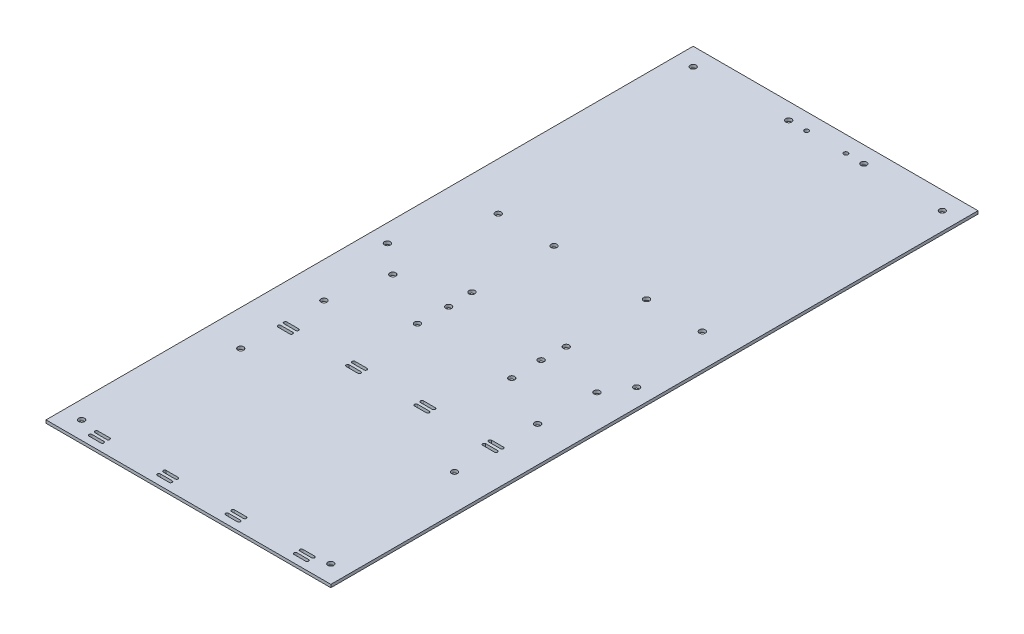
ISO-10303-21;
HEADER;
FILE_DESCRIPTION(('STEP AP214'),'2;1');
FILE_NAME('part.step','',(''),(''),'','','');
FILE_SCHEMA(('AUTOMOTIVE_DESIGN { 1 0 10303 214 1 1 1 1 }'));
ENDSEC;
DATA;
#1=APPLICATION_CONTEXT('core data for automotive mechanical design processes');
#2=APPLICATION_PROTOCOL_DEFINITION('international standard','automotive_design',2000,#1);
#3=PRODUCT_CONTEXT('',#1,'mechanical');
#4=PRODUCT('Part','Part','',(#3));
#5=PRODUCT_RELATED_PRODUCT_CATEGORY('part','',(#4));
#6=PRODUCT_DEFINITION_FORMATION('','',#4);
#7=PRODUCT_DEFINITION_CONTEXT('part definition',#1,'design');
#8=PRODUCT_DEFINITION('design','',#6,#7);
#9=PRODUCT_DEFINITION_SHAPE('','',#8);
#10=(LENGTH_UNIT() NAMED_UNIT(*) SI_UNIT(.MILLI.,.METRE.));
#11=(NAMED_UNIT(*) PLANE_ANGLE_UNIT() SI_UNIT($,.RADIAN.));
#12=(NAMED_UNIT(*) SI_UNIT($,.STERADIAN.) SOLID_ANGLE_UNIT());
#13=UNCERTAINTY_MEASURE_WITH_UNIT(LENGTH_MEASURE(1.E-05),#10,'distance_accuracy_value','');
#14=(GEOMETRIC_REPRESENTATION_CONTEXT(3) GLOBAL_UNCERTAINTY_ASSIGNED_CONTEXT((#13)) GLOBAL_UNIT_ASSIGNED_CONTEXT((#10,
#11,#12)) REPRESENTATION_CONTEXT('',''));
#15=CARTESIAN_POINT('',(0.,0.,0.));
#16=DIRECTION('',(0.,0.,1.));
#17=DIRECTION('',(1.,0.,0.));
#18=AXIS2_PLACEMENT_3D('',#15,#16,#17);
#19=CARTESIAN_POINT('',(-912.202870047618,274.375649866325,1394.76575221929));
#20=DIRECTION('',(1.,0.,0.));
#21=DIRECTION('',(0.,0.,-1.));
#22=AXIS2_PLACEMENT_3D('',#19,#20,#21);
#23=PLANE('',#22);
#24=DIRECTION('',(0.,0.,-1.));
#25=VECTOR('',#24,1.);
#26=CARTESIAN_POINT('',(-912.202870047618,277.550649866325,1394.76575221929));
#27=LINE('',#26,#25);
#28=CARTESIAN_POINT('',(-912.202870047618,277.550649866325,1394.76575221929));
#29=VERTEX_POINT('',#28);
#30=CARTESIAN_POINT('',(-912.202870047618,277.550649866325,702.615752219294));
#31=VERTEX_POINT('',#30);
#32=EDGE_CURVE('E1071',#29,#31,#27,.T.);
#33=ORIENTED_EDGE('',*,*,#32,.T.);
#34=DIRECTION('',(0.,1.,0.));
#35=VECTOR('',#34,1.);
#36=CARTESIAN_POINT('',(-912.202870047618,274.375649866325,702.615752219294));
#37=LINE('',#36,#35);
#38=CARTESIAN_POINT('',(-912.202870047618,274.375649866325,702.615752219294));
#39=VERTEX_POINT('',#38);
#40=EDGE_CURVE('E11',#39,#31,#37,.T.);
#41=ORIENTED_EDGE('',*,*,#40,.F.);
#42=DIRECTION('',(0.,0.,-1.));
#43=VECTOR('',#42,1.);
#44=CARTESIAN_POINT('',(-912.202870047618,274.375649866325,1394.76575221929));
#45=LINE('',#44,#43);
#46=CARTESIAN_POINT('',(-912.202870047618,274.375649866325,1394.76575221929));
#47=VERTEX_POINT('',#46);
#48=EDGE_CURVE('E1078',#47,#39,#45,.T.);
#49=ORIENTED_EDGE('',*,*,#48,.F.);
#50=DIRECTION('',(0.,1.,0.));
#51=VECTOR('',#50,1.);
#52=CARTESIAN_POINT('',(-912.202870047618,274.375649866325,1394.76575221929));
#53=LINE('',#52,#51);
#54=EDGE_CURVE('E1086',#47,#29,#53,.T.);
#55=ORIENTED_EDGE('',*,*,#54,.T.);
#56=EDGE_LOOP('',(#33,#41,#49,#55));
#57=FACE_BOUND('',#56,.T.);
#58=ADVANCED_FACE('F39',(#57),#23,.F.);
#59=CARTESIAN_POINT('',(-912.202870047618,274.375649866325,702.615752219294));
#60=DIRECTION('',(0.,0.,1.));
#61=DIRECTION('',(1.,0.,0.));
#62=AXIS2_PLACEMENT_3D('',#59,#60,#61);
#63=PLANE('',#62);
#64=DIRECTION('',(1.,0.,0.));
#65=VECTOR('',#64,1.);
#66=CARTESIAN_POINT('',(-912.202870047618,277.550649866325,702.615752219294));
#67=LINE('',#66,#65);
#68=CARTESIAN_POINT('',(-607.540370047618,277.550649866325,702.615752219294));
#69=VERTEX_POINT('',#68);
#70=EDGE_CURVE('E1087',#31,#69,#67,.T.);
#71=ORIENTED_EDGE('',*,*,#70,.T.);
#72=DIRECTION('',(0.,1.,0.));
#73=VECTOR('',#72,1.);
#74=CARTESIAN_POINT('',(-607.540370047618,274.375649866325,702.615752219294));
#75=LINE('',#74,#73);
#76=CARTESIAN_POINT('',(-607.540370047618,274.375649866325,702.615752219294));
#77=VERTEX_POINT('',#76);
#78=EDGE_CURVE('E46',#77,#69,#75,.T.);
#79=ORIENTED_EDGE('',*,*,#78,.F.);
#80=DIRECTION('',(1.,0.,0.));
#81=VECTOR('',#80,1.);
#82=CARTESIAN_POINT('',(-912.202870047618,274.375649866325,702.615752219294));
#83=LINE('',#82,#81);
#84=EDGE_CURVE('E1079',#39,#77,#83,.T.);
#85=ORIENTED_EDGE('',*,*,#84,.F.);
#86=ORIENTED_EDGE('',*,*,#40,.T.);
#87=EDGE_LOOP('',(#71,#79,#85,#86));
#88=FACE_BOUND('',#87,.T.);
#89=ADVANCED_FACE('F1116',(#88),#63,.F.);
#90=CARTESIAN_POINT('',(-607.540370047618,274.375649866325,1394.76575221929));
#91=DIRECTION('',(-1.,0.,0.));
#92=DIRECTION('',(0.,0.,1.));
#93=AXIS2_PLACEMENT_3D('',#90,#91,#92);
#94=PLANE('',#93);
#95=DIRECTION('',(0.,0.,1.));
#96=VECTOR('',#95,1.);
#97=CARTESIAN_POINT('',(-607.540370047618,277.550649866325,1394.76575221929));
#98=LINE('',#97,#96);
#99=CARTESIAN_POINT('',(-607.540370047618,277.550649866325,1394.76575221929));
#100=VERTEX_POINT('',#99);
#101=EDGE_CURVE('E1091',#69,#100,#98,.T.);
#102=ORIENTED_EDGE('',*,*,#101,.T.);
#103=DIRECTION('',(0.,1.,0.));
#104=VECTOR('',#103,1.);
#105=CARTESIAN_POINT('',(-607.540370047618,274.375649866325,1394.76575221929));
#106=LINE('',#105,#104);
#107=CARTESIAN_POINT('',(-607.540370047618,274.375649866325,1394.76575221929));
#108=VERTEX_POINT('',#107);
#109=EDGE_CURVE('E1097',#108,#100,#106,.T.);
#110=ORIENTED_EDGE('',*,*,#109,.F.);
#111=DIRECTION('',(0.,0.,1.));
#112=VECTOR('',#111,1.);
#113=CARTESIAN_POINT('',(-607.540370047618,274.375649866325,1394.76575221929));
#114=LINE('',#113,#112);
#115=EDGE_CURVE('E1085',#77,#108,#114,.T.);
#116=ORIENTED_EDGE('',*,*,#115,.F.);
#117=ORIENTED_EDGE('',*,*,#78,.T.);
#118=EDGE_LOOP('',(#102,#110,#116,#117));
#119=FACE_BOUND('',#118,.T.);
#120=ADVANCED_FACE('F1104',(#119),#94,.F.);
#121=CARTESIAN_POINT('',(-912.202870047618,274.375649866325,1394.76575221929));
#122=DIRECTION('',(0.,0.,-1.));
#123=DIRECTION('',(-1.,0.,0.));
#124=AXIS2_PLACEMENT_3D('',#121,#122,#123);
#125=PLANE('',#124);
#126=DIRECTION('',(-1.,0.,0.));
#127=VECTOR('',#126,1.);
#128=CARTESIAN_POINT('',(-912.202870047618,277.550649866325,1394.76575221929));
#129=LINE('',#128,#127);
#130=EDGE_CURVE('E1077',#100,#29,#129,.T.);
#131=ORIENTED_EDGE('',*,*,#130,.T.);
#132=ORIENTED_EDGE('',*,*,#54,.F.);
#133=DIRECTION('',(-1.,0.,0.));
#134=VECTOR('',#133,1.);
#135=CARTESIAN_POINT('',(-912.202870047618,274.375649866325,1394.76575221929));
#136=LINE('',#135,#134);
#137=EDGE_CURVE('E1082',#108,#47,#136,.T.);
#138=ORIENTED_EDGE('',*,*,#137,.F.);
#139=ORIENTED_EDGE('',*,*,#109,.T.);
#140=EDGE_LOOP('',(#131,#132,#138,#139));
#141=FACE_BOUND('',#140,.T.);
#142=ADVANCED_FACE('F1113',(#141),#125,.F.);
#143=CARTESIAN_POINT('',(0.,274.375649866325,0.));
#144=DIRECTION('',(0.,-1.,0.));
#145=DIRECTION('',(0.,0.,-1.));
#146=AXIS2_PLACEMENT_3D('',#143,#144,#145);
#147=PLANE('',#146);
#148=CARTESIAN_POINT('',(-893.152870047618,274.375649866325,1048.69075221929));
#149=DIRECTION('',(0.,-1.,0.));
#150=DIRECTION('',(0.,0.,-1.));
#151=AXIS2_PLACEMENT_3D('',#148,#149,#150);
#152=CIRCLE('',#151,3.17500000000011);
#153=CARTESIAN_POINT('',(-893.152870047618,274.375649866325,1045.51575221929));
#154=VERTEX_POINT('',#153);
#155=EDGE_CURVE('E1493',#154,#154,#152,.T.);
#156=ORIENTED_EDGE('',*,*,#155,.F.);
#157=EDGE_LOOP('',(#156));
#158=FACE_BOUND('',#157,.T.);
#159=CARTESIAN_POINT('',(-626.590370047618,274.375649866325,1048.69075221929));
#160=DIRECTION('',(0.,-1.,0.));
#161=DIRECTION('',(0.,0.,-1.));
#162=AXIS2_PLACEMENT_3D('',#159,#160,#161);
#163=CIRCLE('',#162,3.17500000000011);
#164=CARTESIAN_POINT('',(-626.590370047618,274.375649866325,1045.51575221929));
#165=VERTEX_POINT('',#164);
#166=EDGE_CURVE('E1498',#165,#165,#163,.T.);
#167=ORIENTED_EDGE('',*,*,#166,.F.);
#168=EDGE_LOOP('',(#167));
#169=FACE_BOUND('',#168,.T.);
#170=CARTESIAN_POINT('',(-792.440370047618,274.375649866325,720.187452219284));
#171=DIRECTION('',(0.,1.,0.));
#172=DIRECTION('',(0.,0.,1.));
#173=AXIS2_PLACEMENT_3D('',#170,#171,#172);
#174=CIRCLE('',#173,3.17500000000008);
#175=CARTESIAN_POINT('',(-792.440370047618,274.375649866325,723.362452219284));
#176=VERTEX_POINT('',#175);
#177=EDGE_CURVE('E1507',#176,#176,#174,.T.);
#178=ORIENTED_EDGE('',*,*,#177,.T.);
#179=EDGE_LOOP('',(#178));
#180=FACE_BOUND('',#179,.T.);
#181=CARTESIAN_POINT('',(-712.040370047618,274.375649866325,720.187452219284));
#182=DIRECTION('',(0.,1.,0.));
#183=DIRECTION('',(0.,0.,1.));
#184=AXIS2_PLACEMENT_3D('',#181,#182,#183);
#185=CIRCLE('',#184,3.17500000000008);
#186=CARTESIAN_POINT('',(-712.040370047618,274.375649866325,723.362452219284));
#187=VERTEX_POINT('',#186);
#188=EDGE_CURVE('E1496',#187,#187,#185,.T.);
#189=ORIENTED_EDGE('',*,*,#188,.T.);
#190=EDGE_LOOP('',(#189));
#191=FACE_BOUND('',#190,.T.);
#192=CARTESIAN_POINT('',(-893.152870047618,274.375649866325,721.665752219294));
#193=DIRECTION('',(0.,-1.,0.));
#194=DIRECTION('',(0.,0.,-1.));
#195=AXIS2_PLACEMENT_3D('',#192,#193,#194);
#196=CIRCLE('',#195,3.17500000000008);
#197=CARTESIAN_POINT('',(-893.152870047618,274.375649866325,718.490752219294));
#198=VERTEX_POINT('',#197);
#199=EDGE_CURVE('E1533',#198,#198,#196,.T.);
#200=ORIENTED_EDGE('',*,*,#199,.F.);
#201=EDGE_LOOP('',(#200));
#202=FACE_BOUND('',#201,.T.);
#203=CARTESIAN_POINT('',(-626.590370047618,274.375649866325,721.665752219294));
#204=DIRECTION('',(0.,-1.,0.));
#205=DIRECTION('',(0.,0.,-1.));
#206=AXIS2_PLACEMENT_3D('',#203,#204,#205);
#207=CIRCLE('',#206,3.17500000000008);
#208=CARTESIAN_POINT('',(-626.590370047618,274.375649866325,718.490752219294));
#209=VERTEX_POINT('',#208);
#210=EDGE_CURVE('E1521',#209,#209,#207,.T.);
#211=ORIENTED_EDGE('',*,*,#210,.F.);
#212=EDGE_LOOP('',(#211));
#213=FACE_BOUND('',#212,.T.);
#214=CARTESIAN_POINT('',(-626.590370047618,274.375649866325,1375.71575221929));
#215=DIRECTION('',(0.,-1.,0.));
#216=DIRECTION('',(0.,0.,-1.));
#217=AXIS2_PLACEMENT_3D('',#214,#215,#216);
#218=CIRCLE('',#217,3.17500000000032);
#219=CARTESIAN_POINT('',(-626.590370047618,274.375649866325,1372.54075221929));
#220=VERTEX_POINT('',#219);
#221=EDGE_CURVE('E1516',#220,#220,#218,.T.);
#222=ORIENTED_EDGE('',*,*,#221,.F.);
#223=EDGE_LOOP('',(#222));
#224=FACE_BOUND('',#223,.T.);
#225=CARTESIAN_POINT('',(-893.152870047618,274.375649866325,1375.71575221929));
#226=DIRECTION('',(0.,-1.,0.));
#227=DIRECTION('',(0.,0.,-1.));
#228=AXIS2_PLACEMENT_3D('',#225,#226,#227);
#229=CIRCLE('',#228,3.17500000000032);
#230=CARTESIAN_POINT('',(-893.152870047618,274.375649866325,1372.54075221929));
#231=VERTEX_POINT('',#230);
#232=EDGE_CURVE('E1523',#231,#231,#229,.T.);
#233=ORIENTED_EDGE('',*,*,#232,.F.);
#234=EDGE_LOOP('',(#233));
#235=FACE_BOUND('',#234,.T.);
#236=CARTESIAN_POINT('',(-773.240370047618,274.375649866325,720.187452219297));
#237=DIRECTION('',(0.,1.,0.));
#238=DIRECTION('',(0.,0.,1.));
#239=AXIS2_PLACEMENT_3D('',#236,#237,#238);
#240=CIRCLE('',#239,2.25000000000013);
#241=CARTESIAN_POINT('',(-773.240370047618,274.375649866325,722.437452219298));
#242=VERTEX_POINT('',#241);
#243=EDGE_CURVE('E547',#242,#242,#240,.T.);
#244=ORIENTED_EDGE('',*,*,#243,.T.);
#245=EDGE_LOOP('',(#244));
#246=FACE_BOUND('',#245,.T.);
#247=CARTESIAN_POINT('',(-731.240370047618,274.375649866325,720.187452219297));
#248=DIRECTION('',(0.,1.,0.));
#249=DIRECTION('',(0.,0.,1.));
#250=AXIS2_PLACEMENT_3D('',#247,#248,#249);
#251=CIRCLE('',#250,2.24999999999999);
#252=CARTESIAN_POINT('',(-731.240370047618,274.375649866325,722.437452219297));
#253=VERTEX_POINT('',#252);
#254=EDGE_CURVE('E1537',#253,#253,#251,.T.);
#255=ORIENTED_EDGE('',*,*,#254,.T.);
#256=EDGE_LOOP('',(#255));
#257=FACE_BOUND('',#256,.T.);
#258=CARTESIAN_POINT('',(-861.402870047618,274.375649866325,1176.87825221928));
#259=DIRECTION('',(0.,1.,0.));
#260=DIRECTION('',(0.,0.,-1.));
#261=AXIS2_PLACEMENT_3D('',#258,#259,#260);
#262=CIRCLE('',#261,1.58749999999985);
#263=CARTESIAN_POINT('',(-861.402870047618,274.375649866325,1178.46575221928));
#264=VERTEX_POINT('',#263);
#265=CARTESIAN_POINT('',(-861.402870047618,274.375649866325,1175.29075221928));
#266=VERTEX_POINT('',#265);
#267=EDGE_CURVE('E583',#264,#266,#262,.T.);
#268=ORIENTED_EDGE('',*,*,#267,.T.);
#269=DIRECTION('',(-1.,0.,0.));
#270=VECTOR('',#269,1.);
#271=CARTESIAN_POINT('',(-874.102870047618,274.375649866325,1175.29075221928));
#272=LINE('',#271,#270);
#273=CARTESIAN_POINT('',(-874.102870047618,274.375649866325,1175.29075221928));
#274=VERTEX_POINT('',#273);
#275=EDGE_CURVE('E600',#266,#274,#272,.T.);
#276=ORIENTED_EDGE('',*,*,#275,.T.);
#277=CARTESIAN_POINT('',(-874.102870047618,274.375649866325,1176.87825221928));
#278=DIRECTION('',(0.,1.,0.));
#279=DIRECTION('',(0.,0.,-1.));
#280=AXIS2_PLACEMENT_3D('',#277,#278,#279);
#281=CIRCLE('',#280,1.58749999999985);
#282=CARTESIAN_POINT('',(-874.102870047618,274.375649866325,1178.46575221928));
#283=VERTEX_POINT('',#282);
#284=EDGE_CURVE('E52',#274,#283,#281,.T.);
#285=ORIENTED_EDGE('',*,*,#284,.T.);
#286=DIRECTION('',(1.,0.,0.));
#287=VECTOR('',#286,1.);
#288=CARTESIAN_POINT('',(-861.402870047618,274.375649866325,1178.46575221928));
#289=LINE('',#288,#287);
#290=EDGE_CURVE('E572',#283,#264,#289,.T.);
#291=ORIENTED_EDGE('',*,*,#290,.T.);
#292=EDGE_LOOP('',(#268,#276,#285,#291));
#293=FACE_BOUND('',#292,.T.);
#294=CARTESIAN_POINT('',(-801.077870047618,274.375649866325,1176.87825221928));
#295=DIRECTION('',(0.,1.,0.));
#296=DIRECTION('',(0.,0.,-1.));
#297=AXIS2_PLACEMENT_3D('',#294,#295,#296);
#298=CIRCLE('',#297,1.58749999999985);
#299=CARTESIAN_POINT('',(-801.077870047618,274.375649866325,1175.29075221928));
#300=VERTEX_POINT('',#299);
#301=CARTESIAN_POINT('',(-801.077870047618,274.375649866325,1178.46575221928));
#302=VERTEX_POINT('',#301);
#303=EDGE_CURVE('E617',#300,#302,#298,.T.);
#304=ORIENTED_EDGE('',*,*,#303,.T.);
#305=DIRECTION('',(1.,0.,0.));
#306=VECTOR('',#305,1.);
#307=CARTESIAN_POINT('',(-788.377870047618,274.375649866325,1178.46575221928));
#308=LINE('',#307,#306);
#309=CARTESIAN_POINT('',(-788.377870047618,274.375649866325,1178.46575221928));
#310=VERTEX_POINT('',#309);
#311=EDGE_CURVE('E630',#302,#310,#308,.T.);
#312=ORIENTED_EDGE('',*,*,#311,.T.);
#313=CARTESIAN_POINT('',(-788.377870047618,274.375649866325,1176.87825221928));
#314=DIRECTION('',(0.,1.,0.));
#315=DIRECTION('',(0.,0.,-1.));
#316=AXIS2_PLACEMENT_3D('',#313,#314,#315);
#317=CIRCLE('',#316,1.58749999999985);
#318=CARTESIAN_POINT('',(-788.377870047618,274.375649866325,1175.29075221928));
#319=VERTEX_POINT('',#318);
#320=EDGE_CURVE('E62',#310,#319,#317,.T.);
#321=ORIENTED_EDGE('',*,*,#320,.T.);
#322=DIRECTION('',(-1.,0.,0.));
#323=VECTOR('',#322,1.);
#324=CARTESIAN_POINT('',(-801.077870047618,274.375649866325,1175.29075221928));
#325=LINE('',#324,#323);
#326=EDGE_CURVE('E603',#319,#300,#325,.T.);
#327=ORIENTED_EDGE('',*,*,#326,.T.);
#328=EDGE_LOOP('',(#304,#312,#321,#327));
#329=FACE_BOUND('',#328,.T.);
#330=CARTESIAN_POINT('',(-788.377870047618,274.375649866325,1183.22825221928));
#331=DIRECTION('',(0.,1.,0.));
#332=DIRECTION('',(0.,0.,-1.));
#333=AXIS2_PLACEMENT_3D('',#330,#331,#332);
#334=CIRCLE('',#333,1.58749999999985);
#335=CARTESIAN_POINT('',(-788.377870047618,274.375649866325,1184.81575221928));
#336=VERTEX_POINT('',#335);
#337=CARTESIAN_POINT('',(-788.377870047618,274.375649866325,1181.64075221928));
#338=VERTEX_POINT('',#337);
#339=EDGE_CURVE('E650',#336,#338,#334,.T.);
#340=ORIENTED_EDGE('',*,*,#339,.T.);
#341=DIRECTION('',(-1.,0.,0.));
#342=VECTOR('',#341,1.);
#343=CARTESIAN_POINT('',(-801.077870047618,274.375649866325,1181.64075221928));
#344=LINE('',#343,#342);
#345=CARTESIAN_POINT('',(-801.077870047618,274.375649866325,1181.64075221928));
#346=VERTEX_POINT('',#345);
#347=EDGE_CURVE('E660',#338,#346,#344,.T.);
#348=ORIENTED_EDGE('',*,*,#347,.T.);
#349=CARTESIAN_POINT('',(-801.077870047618,274.375649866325,1183.22825221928));
#350=DIRECTION('',(0.,1.,0.));
#351=DIRECTION('',(0.,0.,-1.));
#352=AXIS2_PLACEMENT_3D('',#349,#350,#351);
#353=CIRCLE('',#352,1.58749999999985);
#354=CARTESIAN_POINT('',(-801.077870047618,274.375649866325,1184.81575221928));
#355=VERTEX_POINT('',#354);
#356=EDGE_CURVE('E658',#346,#355,#353,.T.);
#357=ORIENTED_EDGE('',*,*,#356,.T.);
#358=DIRECTION('',(1.,0.,0.));
#359=VECTOR('',#358,1.);
#360=CARTESIAN_POINT('',(-788.377870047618,274.375649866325,1184.81575221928));
#361=LINE('',#360,#359);
#362=EDGE_CURVE('E634',#355,#336,#361,.T.);
#363=ORIENTED_EDGE('',*,*,#362,.T.);
#364=EDGE_LOOP('',(#340,#348,#357,#363));
#365=FACE_BOUND('',#364,.T.);
#366=CARTESIAN_POINT('',(-728.052870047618,274.375649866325,1183.22825221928));
#367=DIRECTION('',(0.,1.,0.));
#368=DIRECTION('',(0.,0.,-1.));
#369=AXIS2_PLACEMENT_3D('',#366,#367,#368);
#370=CIRCLE('',#369,1.5875000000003);
#371=CARTESIAN_POINT('',(-728.052870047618,274.375649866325,1181.64075221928));
#372=VERTEX_POINT('',#371);
#373=CARTESIAN_POINT('',(-728.052870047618,274.375649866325,1184.81575221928));
#374=VERTEX_POINT('',#373);
#375=EDGE_CURVE('E672',#372,#374,#370,.T.);
#376=ORIENTED_EDGE('',*,*,#375,.T.);
#377=DIRECTION('',(1.,0.,0.));
#378=VECTOR('',#377,1.);
#379=CARTESIAN_POINT('',(-715.352870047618,274.375649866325,1184.81575221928));
#380=LINE('',#379,#378);
#381=CARTESIAN_POINT('',(-715.352870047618,274.375649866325,1184.81575221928));
#382=VERTEX_POINT('',#381);
#383=EDGE_CURVE('E690',#374,#382,#380,.T.);
#384=ORIENTED_EDGE('',*,*,#383,.T.);
#385=CARTESIAN_POINT('',(-715.352870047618,274.375649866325,1183.22825221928));
#386=DIRECTION('',(0.,1.,0.));
#387=DIRECTION('',(0.,0.,-1.));
#388=AXIS2_PLACEMENT_3D('',#385,#386,#387);
#389=CIRCLE('',#388,1.5875000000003);
#390=CARTESIAN_POINT('',(-715.352870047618,274.375649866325,1181.64075221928));
#391=VERTEX_POINT('',#390);
#392=EDGE_CURVE('E685',#382,#391,#389,.T.);
#393=ORIENTED_EDGE('',*,*,#392,.T.);
#394=DIRECTION('',(-1.,0.,0.));
#395=VECTOR('',#394,1.);
#396=CARTESIAN_POINT('',(-728.052870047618,274.375649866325,1181.64075221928));
#397=LINE('',#396,#395);
#398=EDGE_CURVE('E670',#391,#372,#397,.T.);
#399=ORIENTED_EDGE('',*,*,#398,.T.);
#400=EDGE_LOOP('',(#376,#384,#393,#399));
#401=FACE_BOUND('',#400,.T.);
#402=CARTESIAN_POINT('',(-715.352870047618,274.375649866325,1176.87825221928));
#403=DIRECTION('',(0.,1.,0.));
#404=DIRECTION('',(0.,0.,-1.));
#405=AXIS2_PLACEMENT_3D('',#402,#403,#404);
#406=CIRCLE('',#405,1.5875000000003);
#407=CARTESIAN_POINT('',(-715.352870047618,274.375649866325,1178.46575221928));
#408=VERTEX_POINT('',#407);
#409=CARTESIAN_POINT('',(-715.352870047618,274.375649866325,1175.29075221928));
#410=VERTEX_POINT('',#409);
#411=EDGE_CURVE('E469',#408,#410,#406,.T.);
#412=ORIENTED_EDGE('',*,*,#411,.T.);
#413=DIRECTION('',(-1.,0.,0.));
#414=VECTOR('',#413,1.);
#415=CARTESIAN_POINT('',(-728.052870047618,274.375649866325,1175.29075221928));
#416=LINE('',#415,#414);
#417=CARTESIAN_POINT('',(-728.052870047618,274.375649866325,1175.29075221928));
#418=VERTEX_POINT('',#417);
#419=EDGE_CURVE('E505',#410,#418,#416,.T.);
#420=ORIENTED_EDGE('',*,*,#419,.T.);
#421=CARTESIAN_POINT('',(-728.052870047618,274.375649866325,1176.87825221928));
#422=DIRECTION('',(0.,1.,0.));
#423=DIRECTION('',(0.,0.,-1.));
#424=AXIS2_PLACEMENT_3D('',#421,#422,#423);
#425=CIRCLE('',#424,1.5875000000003);
#426=CARTESIAN_POINT('',(-728.052870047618,274.375649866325,1178.46575221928));
#427=VERTEX_POINT('',#426);
#428=EDGE_CURVE('E498',#418,#427,#425,.T.);
#429=ORIENTED_EDGE('',*,*,#428,.T.);
#430=DIRECTION('',(1.,0.,0.));
#431=VECTOR('',#430,1.);
#432=CARTESIAN_POINT('',(-715.352870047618,274.375649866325,1178.46575221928));
#433=LINE('',#432,#431);
#434=EDGE_CURVE('E496',#427,#408,#433,.T.);
#435=ORIENTED_EDGE('',*,*,#434,.T.);
#436=EDGE_LOOP('',(#412,#420,#429,#435));
#437=FACE_BOUND('',#436,.T.);
#438=CARTESIAN_POINT('',(-655.027870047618,274.375649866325,1176.87825221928));
#439=DIRECTION('',(0.,1.,0.));
#440=DIRECTION('',(0.,0.,-1.));
#441=AXIS2_PLACEMENT_3D('',#438,#439,#440);
#442=CIRCLE('',#441,1.5875000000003);
#443=CARTESIAN_POINT('',(-655.027870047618,274.375649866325,1175.29075221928));
#444=VERTEX_POINT('',#443);
#445=CARTESIAN_POINT('',(-655.027870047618,274.375649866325,1178.46575221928));
#446=VERTEX_POINT('',#445);
#447=EDGE_CURVE('E523',#444,#446,#442,.T.);
#448=ORIENTED_EDGE('',*,*,#447,.T.);
#449=DIRECTION('',(1.,0.,0.));
#450=VECTOR('',#449,1.);
#451=CARTESIAN_POINT('',(-642.327870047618,274.375649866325,1178.46575221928));
#452=LINE('',#451,#450);
#453=CARTESIAN_POINT('',(-642.327870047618,274.375649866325,1178.46575221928));
#454=VERTEX_POINT('',#453);
#455=EDGE_CURVE('E531',#446,#454,#452,.T.);
#456=ORIENTED_EDGE('',*,*,#455,.T.);
#457=CARTESIAN_POINT('',(-642.327870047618,274.375649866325,1176.87825221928));
#458=DIRECTION('',(0.,1.,0.));
#459=DIRECTION('',(0.,0.,-1.));
#460=AXIS2_PLACEMENT_3D('',#457,#458,#459);
#461=CIRCLE('',#460,1.58749999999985);
#462=CARTESIAN_POINT('',(-642.327870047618,274.375649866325,1175.29075221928));
#463=VERTEX_POINT('',#462);
#464=EDGE_CURVE('E526',#454,#463,#461,.T.);
#465=ORIENTED_EDGE('',*,*,#464,.T.);
#466=DIRECTION('',(-1.,0.,0.));
#467=VECTOR('',#466,1.);
#468=CARTESIAN_POINT('',(-655.027870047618,274.375649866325,1175.29075221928));
#469=LINE('',#468,#467);
#470=EDGE_CURVE('E508',#463,#444,#469,.T.);
#471=ORIENTED_EDGE('',*,*,#470,.T.);
#472=EDGE_LOOP('',(#448,#456,#465,#471));
#473=FACE_BOUND('',#472,.T.);
#474=CARTESIAN_POINT('',(-642.327870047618,274.375649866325,1183.22825221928));
#475=DIRECTION('',(0.,1.,0.));
#476=DIRECTION('',(0.,0.,-1.));
#477=AXIS2_PLACEMENT_3D('',#474,#475,#476);
#478=CIRCLE('',#477,1.58749999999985);
#479=CARTESIAN_POINT('',(-642.327870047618,274.375649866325,1184.81575221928));
#480=VERTEX_POINT('',#479);
#481=CARTESIAN_POINT('',(-642.327870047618,274.375649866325,1181.64075221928));
#482=VERTEX_POINT('',#481);
#483=EDGE_CURVE('E551',#480,#482,#478,.T.);
#484=ORIENTED_EDGE('',*,*,#483,.T.);
#485=DIRECTION('',(-1.,0.,0.));
#486=VECTOR('',#485,1.);
#487=CARTESIAN_POINT('',(-655.027870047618,274.375649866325,1181.64075221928));
#488=LINE('',#487,#486);
#489=CARTESIAN_POINT('',(-655.027870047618,274.375649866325,1181.64075221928));
#490=VERTEX_POINT('',#489);
#491=EDGE_CURVE('E564',#482,#490,#488,.T.);
#492=ORIENTED_EDGE('',*,*,#491,.T.);
#493=CARTESIAN_POINT('',(-655.027870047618,274.375649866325,1183.22825221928));
#494=DIRECTION('',(0.,1.,0.));
#495=DIRECTION('',(0.,0.,-1.));
#496=AXIS2_PLACEMENT_3D('',#493,#494,#495);
#497=CIRCLE('',#496,1.5875000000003);
#498=CARTESIAN_POINT('',(-655.027870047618,274.375649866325,1184.81575221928));
#499=VERTEX_POINT('',#498);
#500=EDGE_CURVE('E565',#490,#499,#497,.T.);
#501=ORIENTED_EDGE('',*,*,#500,.T.);
#502=DIRECTION('',(1.,0.,0.));
#503=VECTOR('',#502,1.);
#504=CARTESIAN_POINT('',(-642.327870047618,274.375649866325,1184.81575221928));
#505=LINE('',#504,#503);
#506=EDGE_CURVE('E543',#499,#480,#505,.T.);
#507=ORIENTED_EDGE('',*,*,#506,.T.);
#508=EDGE_LOOP('',(#484,#492,#501,#507));
#509=FACE_BOUND('',#508,.T.);
#510=CARTESIAN_POINT('',(-874.102870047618,274.375649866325,1183.22825221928));
#511=DIRECTION('',(0.,1.,0.));
#512=DIRECTION('',(0.,0.,-1.));
#513=AXIS2_PLACEMENT_3D('',#510,#511,#512);
#514=CIRCLE('',#513,1.58749999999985);
#515=CARTESIAN_POINT('',(-874.102870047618,274.375649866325,1181.64075221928));
#516=VERTEX_POINT('',#515);
#517=CARTESIAN_POINT('',(-874.102870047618,274.375649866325,1184.81575221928));
#518=VERTEX_POINT('',#517);
#519=EDGE_CURVE('E695',#516,#518,#514,.T.);
#520=ORIENTED_EDGE('',*,*,#519,.T.);
#521=DIRECTION('',(1.,0.,0.));
#522=VECTOR('',#521,1.);
#523=CARTESIAN_POINT('',(-861.402870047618,274.375649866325,1184.81575221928));
#524=LINE('',#523,#522);
#525=CARTESIAN_POINT('',(-861.402870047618,274.375649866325,1184.81575221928));
#526=VERTEX_POINT('',#525);
#527=EDGE_CURVE('E694',#518,#526,#524,.T.);
#528=ORIENTED_EDGE('',*,*,#527,.T.);
#529=CARTESIAN_POINT('',(-861.402870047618,274.375649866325,1183.22825221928));
#530=DIRECTION('',(0.,1.,0.));
#531=DIRECTION('',(0.,0.,-1.));
#532=AXIS2_PLACEMENT_3D('',#529,#530,#531);
#533=CIRCLE('',#532,1.58749999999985);
#534=CARTESIAN_POINT('',(-861.402870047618,274.375649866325,1181.64075221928));
#535=VERTEX_POINT('',#534);
#536=EDGE_CURVE('E697',#526,#535,#533,.T.);
#537=ORIENTED_EDGE('',*,*,#536,.T.);
#538=DIRECTION('',(-1.,0.,0.));
#539=VECTOR('',#538,1.);
#540=CARTESIAN_POINT('',(-874.102870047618,274.375649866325,1181.64075221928));
#541=LINE('',#540,#539);
#542=EDGE_CURVE('E705',#535,#516,#541,.T.);
#543=ORIENTED_EDGE('',*,*,#542,.T.);
#544=EDGE_LOOP('',(#520,#528,#537,#543));
#545=FACE_BOUND('',#544,.T.);
#546=CARTESIAN_POINT('',(-874.171620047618,274.375649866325,1224.50325221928));
#547=DIRECTION('',(0.,-1.,0.));
#548=DIRECTION('',(0.,0.,-1.));
#549=AXIS2_PLACEMENT_3D('',#546,#547,#548);
#550=CIRCLE('',#549,3.17499999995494);
#551=CARTESIAN_POINT('',(-874.171620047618,274.375649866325,1221.32825221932));
#552=VERTEX_POINT('',#551);
#553=EDGE_CURVE('E745',#552,#552,#550,.T.);
#554=ORIENTED_EDGE('',*,*,#553,.F.);
#555=EDGE_LOOP('',(#554));
#556=FACE_BOUND('',#555,.T.);
#557=CARTESIAN_POINT('',(-645.571620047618,274.375649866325,1224.50325221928));
#558=DIRECTION('',(0.,-1.,0.));
#559=DIRECTION('',(0.,0.,-1.));
#560=AXIS2_PLACEMENT_3D('',#557,#558,#559);
#561=CIRCLE('',#560,3.17499999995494);
#562=CARTESIAN_POINT('',(-645.571620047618,274.375649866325,1221.32825221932));
#563=VERTEX_POINT('',#562);
#564=EDGE_CURVE('E743',#563,#563,#561,.T.);
#565=ORIENTED_EDGE('',*,*,#564,.F.);
#566=EDGE_LOOP('',(#565));
#567=FACE_BOUND('',#566,.T.);
#568=CARTESIAN_POINT('',(-645.571620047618,274.375649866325,1135.60325221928));
#569=DIRECTION('',(0.,-1.,0.));
#570=DIRECTION('',(0.,0.,-1.));
#571=AXIS2_PLACEMENT_3D('',#568,#569,#570);
#572=CIRCLE('',#571,3.17499999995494);
#573=CARTESIAN_POINT('',(-645.571620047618,274.375649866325,1132.42825221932));
#574=VERTEX_POINT('',#573);
#575=EDGE_CURVE('E736',#574,#574,#572,.T.);
#576=ORIENTED_EDGE('',*,*,#575,.F.);
#577=EDGE_LOOP('',(#576));
#578=FACE_BOUND('',#577,.T.);
#579=CARTESIAN_POINT('',(-874.171620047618,274.375649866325,1135.60325221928));
#580=DIRECTION('',(0.,-1.,0.));
#581=DIRECTION('',(0.,0.,-1.));
#582=AXIS2_PLACEMENT_3D('',#579,#580,#581);
#583=CIRCLE('',#582,3.17499999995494);
#584=CARTESIAN_POINT('',(-874.171620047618,274.375649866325,1132.42825221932));
#585=VERTEX_POINT('',#584);
#586=EDGE_CURVE('E733',#585,#585,#583,.T.);
#587=ORIENTED_EDGE('',*,*,#586,.F.);
#588=EDGE_LOOP('',(#587));
#589=FACE_BOUND('',#588,.T.);
#590=CARTESIAN_POINT('',(-801.077870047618,274.375649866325,1378.89075221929));
#591=DIRECTION('',(0.,1.,0.));
#592=DIRECTION('',(0.,0.,1.));
#593=AXIS2_PLACEMENT_3D('',#590,#591,#592);
#594=CIRCLE('',#593,1.58749999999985);
#595=CARTESIAN_POINT('',(-801.077870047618,274.375649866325,1377.30325221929));
#596=VERTEX_POINT('',#595);
#597=CARTESIAN_POINT('',(-801.077870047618,274.375649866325,1380.47825221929));
#598=VERTEX_POINT('',#597);
#599=EDGE_CURVE('E859',#596,#598,#594,.T.);
#600=ORIENTED_EDGE('',*,*,#599,.T.);
#601=DIRECTION('',(1.,0.,0.));
#602=VECTOR('',#601,1.);
#603=CARTESIAN_POINT('',(-801.077870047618,274.375649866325,1380.47825221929));
#604=LINE('',#603,#602);
#605=CARTESIAN_POINT('',(-788.377870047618,274.375649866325,1380.47825221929));
#606=VERTEX_POINT('',#605);
#607=EDGE_CURVE('E872',#598,#606,#604,.T.);
#608=ORIENTED_EDGE('',*,*,#607,.T.);
#609=CARTESIAN_POINT('',(-788.377870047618,274.375649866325,1378.89075221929));
#610=DIRECTION('',(0.,1.,0.));
#611=DIRECTION('',(0.,0.,1.));
#612=AXIS2_PLACEMENT_3D('',#609,#610,#611);
#613=CIRCLE('',#612,1.58749999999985);
#614=CARTESIAN_POINT('',(-788.377870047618,274.375649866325,1377.30325221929));
#615=VERTEX_POINT('',#614);
#616=EDGE_CURVE('E867',#606,#615,#613,.T.);
#617=ORIENTED_EDGE('',*,*,#616,.T.);
#618=DIRECTION('',(-1.,0.,0.));
#619=VECTOR('',#618,1.);
#620=CARTESIAN_POINT('',(-801.077870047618,274.375649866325,1377.30325221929));
#621=LINE('',#620,#619);
#622=EDGE_CURVE('E850',#615,#596,#621,.T.);
#623=ORIENTED_EDGE('',*,*,#622,.T.);
#624=EDGE_LOOP('',(#600,#608,#617,#623));
#625=FACE_BOUND('',#624,.T.);
#626=CARTESIAN_POINT('',(-728.052870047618,274.375649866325,1378.89075221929));
#627=DIRECTION('',(0.,1.,0.));
#628=DIRECTION('',(0.,0.,1.));
#629=AXIS2_PLACEMENT_3D('',#626,#627,#628);
#630=CIRCLE('',#629,1.5875000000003);
#631=CARTESIAN_POINT('',(-728.052870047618,274.375649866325,1377.30325221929));
#632=VERTEX_POINT('',#631);
#633=CARTESIAN_POINT('',(-728.052870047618,274.375649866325,1380.47825221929));
#634=VERTEX_POINT('',#633);
#635=EDGE_CURVE('E893',#632,#634,#630,.T.);
#636=ORIENTED_EDGE('',*,*,#635,.T.);
#637=DIRECTION('',(1.,0.,0.));
#638=VECTOR('',#637,1.);
#639=CARTESIAN_POINT('',(-728.052870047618,274.375649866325,1380.47825221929));
#640=LINE('',#639,#638);
#641=CARTESIAN_POINT('',(-715.352870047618,274.375649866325,1380.47825221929));
#642=VERTEX_POINT('',#641);
#643=EDGE_CURVE('E903',#634,#642,#640,.T.);
#644=ORIENTED_EDGE('',*,*,#643,.T.);
#645=CARTESIAN_POINT('',(-715.352870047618,274.375649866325,1378.89075221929));
#646=DIRECTION('',(0.,1.,0.));
#647=DIRECTION('',(0.,0.,1.));
#648=AXIS2_PLACEMENT_3D('',#645,#646,#647);
#649=CIRCLE('',#648,1.5875000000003);
#650=CARTESIAN_POINT('',(-715.352870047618,274.375649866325,1377.30325221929));
#651=VERTEX_POINT('',#650);
#652=EDGE_CURVE('E905',#642,#651,#649,.T.);
#653=ORIENTED_EDGE('',*,*,#652,.T.);
#654=DIRECTION('',(-1.,0.,0.));
#655=VECTOR('',#654,1.);
#656=CARTESIAN_POINT('',(-728.052870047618,274.375649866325,1377.30325221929));
#657=LINE('',#656,#655);
#658=EDGE_CURVE('E883',#651,#632,#657,.T.);
#659=ORIENTED_EDGE('',*,*,#658,.T.);
#660=EDGE_LOOP('',(#636,#644,#653,#659));
#661=FACE_BOUND('',#660,.T.);
#662=CARTESIAN_POINT('',(-655.027870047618,274.375649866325,1378.89075221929));
#663=DIRECTION('',(0.,1.,0.));
#664=DIRECTION('',(0.,0.,1.));
#665=AXIS2_PLACEMENT_3D('',#662,#663,#664);
#666=CIRCLE('',#665,1.5875000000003);
#667=CARTESIAN_POINT('',(-655.027870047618,274.375649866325,1377.30325221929));
#668=VERTEX_POINT('',#667);
#669=CARTESIAN_POINT('',(-655.027870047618,274.375649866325,1380.47825221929));
#670=VERTEX_POINT('',#669);
#671=EDGE_CURVE('E923',#668,#670,#666,.T.);
#672=ORIENTED_EDGE('',*,*,#671,.T.);
#673=DIRECTION('',(1.,0.,0.));
#674=VECTOR('',#673,1.);
#675=CARTESIAN_POINT('',(-655.027870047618,274.375649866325,1380.47825221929));
#676=LINE('',#675,#674);
#677=CARTESIAN_POINT('',(-642.327870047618,274.375649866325,1380.47825221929));
#678=VERTEX_POINT('',#677);
#679=EDGE_CURVE('E939',#670,#678,#676,.T.);
#680=ORIENTED_EDGE('',*,*,#679,.T.);
#681=CARTESIAN_POINT('',(-642.327870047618,274.375649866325,1378.89075221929));
#682=DIRECTION('',(0.,1.,0.));
#683=DIRECTION('',(0.,0.,1.));
#684=AXIS2_PLACEMENT_3D('',#681,#682,#683);
#685=CIRCLE('',#684,1.58749999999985);
#686=CARTESIAN_POINT('',(-642.327870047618,274.375649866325,1377.30325221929));
#687=VERTEX_POINT('',#686);
#688=EDGE_CURVE('E934',#678,#687,#685,.T.);
#689=ORIENTED_EDGE('',*,*,#688,.T.);
#690=DIRECTION('',(-1.,0.,0.));
#691=VECTOR('',#690,1.);
#692=CARTESIAN_POINT('',(-655.027870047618,274.375649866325,1377.30325221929));
#693=LINE('',#692,#691);
#694=EDGE_CURVE('E911',#687,#668,#693,.T.);
#695=ORIENTED_EDGE('',*,*,#694,.T.);
#696=EDGE_LOOP('',(#672,#680,#689,#695));
#697=FACE_BOUND('',#696,.T.);
#698=CARTESIAN_POINT('',(-655.027870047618,274.375649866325,1385.24075221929));
#699=DIRECTION('',(0.,1.,0.));
#700=DIRECTION('',(0.,0.,-1.));
#701=AXIS2_PLACEMENT_3D('',#698,#699,#700);
#702=CIRCLE('',#701,1.5875000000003);
#703=CARTESIAN_POINT('',(-655.027870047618,274.375649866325,1383.65325221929));
#704=VERTEX_POINT('',#703);
#705=CARTESIAN_POINT('',(-655.027870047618,274.375649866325,1386.82825221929));
#706=VERTEX_POINT('',#705);
#707=EDGE_CURVE('E954',#704,#706,#702,.T.);
#708=ORIENTED_EDGE('',*,*,#707,.T.);
#709=DIRECTION('',(1.,0.,0.));
#710=VECTOR('',#709,1.);
#711=CARTESIAN_POINT('',(-655.027870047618,274.375649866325,1386.82825221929));
#712=LINE('',#711,#710);
#713=CARTESIAN_POINT('',(-642.327870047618,274.375649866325,1386.82825221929));
#714=VERTEX_POINT('',#713);
#715=EDGE_CURVE('E970',#706,#714,#712,.T.);
#716=ORIENTED_EDGE('',*,*,#715,.T.);
#717=CARTESIAN_POINT('',(-642.327870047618,274.375649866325,1385.24075221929));
#718=DIRECTION('',(0.,1.,0.));
#719=DIRECTION('',(0.,0.,-1.));
#720=AXIS2_PLACEMENT_3D('',#717,#718,#719);
#721=CIRCLE('',#720,1.58749999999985);
#722=CARTESIAN_POINT('',(-642.327870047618,274.375649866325,1383.65325221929));
#723=VERTEX_POINT('',#722);
#724=EDGE_CURVE('E963',#714,#723,#721,.T.);
#725=ORIENTED_EDGE('',*,*,#724,.T.);
#726=DIRECTION('',(-1.,0.,0.));
#727=VECTOR('',#726,1.);
#728=CARTESIAN_POINT('',(-655.027870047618,274.375649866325,1383.65325221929));
#729=LINE('',#728,#727);
#730=EDGE_CURVE('E944',#723,#704,#729,.T.);
#731=ORIENTED_EDGE('',*,*,#730,.T.);
#732=EDGE_LOOP('',(#708,#716,#725,#731));
#733=FACE_BOUND('',#732,.T.);
#734=CARTESIAN_POINT('',(-728.052870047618,274.375649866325,1385.24075221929));
#735=DIRECTION('',(0.,1.,0.));
#736=DIRECTION('',(0.,0.,-1.));
#737=AXIS2_PLACEMENT_3D('',#734,#735,#736);
#738=CIRCLE('',#737,1.5875000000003);
#739=CARTESIAN_POINT('',(-728.052870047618,274.375649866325,1383.65325221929));
#740=VERTEX_POINT('',#739);
#741=CARTESIAN_POINT('',(-728.052870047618,274.375649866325,1386.82825221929));
#742=VERTEX_POINT('',#741);
#743=EDGE_CURVE('E763',#740,#742,#738,.T.);
#744=ORIENTED_EDGE('',*,*,#743,.T.);
#745=DIRECTION('',(1.,0.,0.));
#746=VECTOR('',#745,1.);
#747=CARTESIAN_POINT('',(-728.052870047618,274.375649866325,1386.82825221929));
#748=LINE('',#747,#746);
#749=CARTESIAN_POINT('',(-715.352870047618,274.375649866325,1386.82825221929));
#750=VERTEX_POINT('',#749);
#751=EDGE_CURVE('E780',#742,#750,#748,.T.);
#752=ORIENTED_EDGE('',*,*,#751,.T.);
#753=CARTESIAN_POINT('',(-715.352870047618,274.375649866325,1385.24075221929));
#754=DIRECTION('',(0.,1.,0.));
#755=DIRECTION('',(0.,0.,-1.));
#756=AXIS2_PLACEMENT_3D('',#753,#754,#755);
#757=CIRCLE('',#756,1.5875000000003);
#758=CARTESIAN_POINT('',(-715.352870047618,274.375649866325,1383.65325221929));
#759=VERTEX_POINT('',#758);
#760=EDGE_CURVE('E771',#750,#759,#757,.T.);
#761=ORIENTED_EDGE('',*,*,#760,.T.);
#762=DIRECTION('',(-1.,0.,0.));
#763=VECTOR('',#762,1.);
#764=CARTESIAN_POINT('',(-728.052870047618,274.375649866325,1383.65325221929));
#765=LINE('',#764,#763);
#766=EDGE_CURVE('E753',#759,#740,#765,.T.);
#767=ORIENTED_EDGE('',*,*,#766,.T.);
#768=EDGE_LOOP('',(#744,#752,#761,#767));
#769=FACE_BOUND('',#768,.T.);
#770=CARTESIAN_POINT('',(-801.077870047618,274.375649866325,1385.24075221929));
#771=DIRECTION('',(0.,1.,0.));
#772=DIRECTION('',(0.,0.,-1.));
#773=AXIS2_PLACEMENT_3D('',#770,#771,#772);
#774=CIRCLE('',#773,1.58749999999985);
#775=CARTESIAN_POINT('',(-801.077870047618,274.375649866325,1383.65325221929));
#776=VERTEX_POINT('',#775);
#777=CARTESIAN_POINT('',(-801.077870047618,274.375649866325,1386.82825221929));
#778=VERTEX_POINT('',#777);
#779=EDGE_CURVE('E800',#776,#778,#774,.T.);
#780=ORIENTED_EDGE('',*,*,#779,.T.);
#781=DIRECTION('',(1.,0.,0.));
#782=VECTOR('',#781,1.);
#783=CARTESIAN_POINT('',(-801.077870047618,274.375649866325,1386.82825221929));
#784=LINE('',#783,#782);
#785=CARTESIAN_POINT('',(-788.377870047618,274.375649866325,1386.82825221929));
#786=VERTEX_POINT('',#785);
#787=EDGE_CURVE('E810',#778,#786,#784,.T.);
#788=ORIENTED_EDGE('',*,*,#787,.T.);
#789=CARTESIAN_POINT('',(-788.377870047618,274.375649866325,1385.24075221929));
#790=DIRECTION('',(0.,1.,0.));
#791=DIRECTION('',(0.,0.,-1.));
#792=AXIS2_PLACEMENT_3D('',#789,#790,#791);
#793=CIRCLE('',#792,1.58749999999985);
#794=CARTESIAN_POINT('',(-788.377870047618,274.375649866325,1383.65325221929));
#795=VERTEX_POINT('',#794);
#796=EDGE_CURVE('E808',#786,#795,#793,.T.);
#797=ORIENTED_EDGE('',*,*,#796,.T.);
#798=DIRECTION('',(-1.,0.,0.));
#799=VECTOR('',#798,1.);
#800=CARTESIAN_POINT('',(-801.077870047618,274.375649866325,1383.65325221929));
#801=LINE('',#800,#799);
#802=EDGE_CURVE('E782',#795,#776,#801,.T.);
#803=ORIENTED_EDGE('',*,*,#802,.T.);
#804=EDGE_LOOP('',(#780,#788,#797,#803));
#805=FACE_BOUND('',#804,.T.);
#806=CARTESIAN_POINT('',(-874.102870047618,274.375649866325,1385.24075221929));
#807=DIRECTION('',(0.,1.,0.));
#808=DIRECTION('',(0.,0.,-1.));
#809=AXIS2_PLACEMENT_3D('',#806,#807,#808);
#810=CIRCLE('',#809,1.58749999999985);
#811=CARTESIAN_POINT('',(-874.102870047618,274.375649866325,1383.65325221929));
#812=VERTEX_POINT('',#811);
#813=CARTESIAN_POINT('',(-874.102870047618,274.375649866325,1386.82825221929));
#814=VERTEX_POINT('',#813);
#815=EDGE_CURVE('E830',#812,#814,#810,.T.);
#816=ORIENTED_EDGE('',*,*,#815,.T.);
#817=DIRECTION('',(1.,0.,0.));
#818=VECTOR('',#817,1.);
#819=CARTESIAN_POINT('',(-874.102870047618,274.375649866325,1386.82825221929));
#820=LINE('',#819,#818);
#821=CARTESIAN_POINT('',(-861.402870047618,274.375649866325,1386.82825221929));
#822=VERTEX_POINT('',#821);
#823=EDGE_CURVE('E836',#814,#822,#820,.T.);
#824=ORIENTED_EDGE('',*,*,#823,.T.);
#825=CARTESIAN_POINT('',(-861.402870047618,274.375649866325,1385.24075221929));
#826=DIRECTION('',(0.,1.,0.));
#827=DIRECTION('',(0.,0.,-1.));
#828=AXIS2_PLACEMENT_3D('',#825,#826,#827);
#829=CIRCLE('',#828,1.58749999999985);
#830=CARTESIAN_POINT('',(-861.402870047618,274.375649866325,1383.65325221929));
#831=VERTEX_POINT('',#830);
#832=EDGE_CURVE('E837',#822,#831,#829,.T.);
#833=ORIENTED_EDGE('',*,*,#832,.T.);
#834=DIRECTION('',(-1.,0.,0.));
#835=VECTOR('',#834,1.);
#836=CARTESIAN_POINT('',(-874.102870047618,274.375649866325,1383.65325221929));
#837=LINE('',#836,#835);
#838=EDGE_CURVE('E820',#831,#812,#837,.T.);
#839=ORIENTED_EDGE('',*,*,#838,.T.);
#840=EDGE_LOOP('',(#816,#824,#833,#839));
#841=FACE_BOUND('',#840,.T.);
#842=CARTESIAN_POINT('',(-874.102870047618,274.375649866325,1378.89075221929));
#843=DIRECTION('',(0.,1.,0.));
#844=DIRECTION('',(0.,0.,1.));
#845=AXIS2_PLACEMENT_3D('',#842,#843,#844);
#846=CIRCLE('',#845,1.58749999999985);
#847=CARTESIAN_POINT('',(-874.102870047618,274.375649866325,1377.30325221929));
#848=VERTEX_POINT('',#847);
#849=CARTESIAN_POINT('',(-874.102870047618,274.375649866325,1380.47825221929));
#850=VERTEX_POINT('',#849);
#851=EDGE_CURVE('E975',#848,#850,#846,.T.);
#852=ORIENTED_EDGE('',*,*,#851,.T.);
#853=DIRECTION('',(1.,0.,0.));
#854=VECTOR('',#853,1.);
#855=CARTESIAN_POINT('',(-874.102870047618,274.375649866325,1380.47825221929));
#856=LINE('',#855,#854);
#857=CARTESIAN_POINT('',(-861.402870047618,274.375649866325,1380.47825221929));
#858=VERTEX_POINT('',#857);
#859=EDGE_CURVE('E973',#850,#858,#856,.T.);
#860=ORIENTED_EDGE('',*,*,#859,.T.);
#861=CARTESIAN_POINT('',(-861.402870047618,274.375649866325,1378.89075221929));
#862=DIRECTION('',(0.,1.,0.));
#863=DIRECTION('',(0.,0.,1.));
#864=AXIS2_PLACEMENT_3D('',#861,#862,#863);
#865=CIRCLE('',#864,1.58749999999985);
#866=CARTESIAN_POINT('',(-861.402870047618,274.375649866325,1377.30325221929));
#867=VERTEX_POINT('',#866);
#868=EDGE_CURVE('E979',#858,#867,#865,.T.);
#869=ORIENTED_EDGE('',*,*,#868,.T.);
#870=DIRECTION('',(-1.,0.,0.));
#871=VECTOR('',#870,1.);
#872=CARTESIAN_POINT('',(-874.102870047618,274.375649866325,1377.30325221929));
#873=LINE('',#872,#871);
#874=EDGE_CURVE('E984',#867,#848,#873,.T.);
#875=ORIENTED_EDGE('',*,*,#874,.T.);
#876=EDGE_LOOP('',(#852,#860,#869,#875));
#877=FACE_BOUND('',#876,.T.);
#878=CARTESIAN_POINT('',(-802.665320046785,274.375649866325,1048.72825221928));
#879=DIRECTION('',(0.,1.,0.));
#880=DIRECTION('',(0.,0.,1.));
#881=AXIS2_PLACEMENT_3D('',#878,#879,#880);
#882=CIRCLE('',#881,3.17500000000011);
#883=CARTESIAN_POINT('',(-802.665320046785,274.375649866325,1051.90325221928));
#884=VERTEX_POINT('',#883);
#885=EDGE_CURVE('E1035',#884,#884,#882,.T.);
#886=ORIENTED_EDGE('',*,*,#885,.T.);
#887=EDGE_LOOP('',(#886));
#888=FACE_BOUND('',#887,.T.);
#889=CARTESIAN_POINT('',(-801.712870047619,274.375649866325,1074.64075221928));
#890=DIRECTION('',(0.,1.,0.));
#891=DIRECTION('',(0.,0.,1.));
#892=AXIS2_PLACEMENT_3D('',#889,#890,#891);
#893=CIRCLE('',#892,3.17500000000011);
#894=CARTESIAN_POINT('',(-801.712870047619,274.375649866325,1077.81575221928));
#895=VERTEX_POINT('',#894);
#896=EDGE_CURVE('E1026',#895,#895,#893,.T.);
#897=ORIENTED_EDGE('',*,*,#896,.T.);
#898=EDGE_LOOP('',(#897));
#899=FACE_BOUND('',#898,.T.);
#900=CARTESIAN_POINT('',(-861.402870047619,274.375649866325,1074.64075221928));
#901=DIRECTION('',(0.,1.,0.));
#902=DIRECTION('',(0.,0.,1.));
#903=AXIS2_PLACEMENT_3D('',#900,#901,#902);
#904=CIRCLE('',#903,3.17500000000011);
#905=CARTESIAN_POINT('',(-861.402870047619,274.375649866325,1077.81575221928));
#906=VERTEX_POINT('',#905);
#907=EDGE_CURVE('E1024',#906,#906,#904,.T.);
#908=ORIENTED_EDGE('',*,*,#907,.T.);
#909=EDGE_LOOP('',(#908));
#910=FACE_BOUND('',#909,.T.);
#911=CARTESIAN_POINT('',(-801.712870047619,274.375649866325,961.928252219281));
#912=DIRECTION('',(0.,1.,0.));
#913=DIRECTION('',(0.,0.,1.));
#914=AXIS2_PLACEMENT_3D('',#911,#912,#913);
#915=CIRCLE('',#914,3.17500000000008);
#916=CARTESIAN_POINT('',(-801.712870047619,274.375649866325,965.103252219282));
#917=VERTEX_POINT('',#916);
#918=EDGE_CURVE('E1038',#917,#917,#915,.T.);
#919=ORIENTED_EDGE('',*,*,#918,.T.);
#920=EDGE_LOOP('',(#919));
#921=FACE_BOUND('',#920,.T.);
#922=CARTESIAN_POINT('',(-701.815370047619,274.375649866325,1048.72825221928));
#923=DIRECTION('',(0.,1.,0.));
#924=DIRECTION('',(0.,0.,1.));
#925=AXIS2_PLACEMENT_3D('',#922,#923,#924);
#926=CIRCLE('',#925,3.17500000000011);
#927=CARTESIAN_POINT('',(-701.815370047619,274.375649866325,1051.90325221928));
#928=VERTEX_POINT('',#927);
#929=EDGE_CURVE('E1046',#928,#928,#926,.T.);
#930=ORIENTED_EDGE('',*,*,#929,.T.);
#931=EDGE_LOOP('',(#930));
#932=FACE_BOUND('',#931,.T.);
#933=CARTESIAN_POINT('',(-702.767870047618,274.375649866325,961.928252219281));
#934=DIRECTION('',(0.,1.,0.));
#935=DIRECTION('',(0.,0.,1.));
#936=AXIS2_PLACEMENT_3D('',#933,#934,#935);
#937=CIRCLE('',#936,3.17500000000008);
#938=CARTESIAN_POINT('',(-702.767870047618,274.375649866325,965.103252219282));
#939=VERTEX_POINT('',#938);
#940=EDGE_CURVE('E1057',#939,#939,#937,.T.);
#941=ORIENTED_EDGE('',*,*,#940,.T.);
#942=EDGE_LOOP('',(#941));
#943=FACE_BOUND('',#942,.T.);
#944=CARTESIAN_POINT('',(-643.077870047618,274.375649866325,961.928252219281));
#945=DIRECTION('',(0.,1.,0.));
#946=DIRECTION('',(0.,0.,1.));
#947=AXIS2_PLACEMENT_3D('',#944,#945,#946);
#948=CIRCLE('',#947,3.17500000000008);
#949=CARTESIAN_POINT('',(-643.077870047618,274.375649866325,965.103252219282));
#950=VERTEX_POINT('',#949);
#951=EDGE_CURVE('E1065',#950,#950,#948,.T.);
#952=ORIENTED_EDGE('',*,*,#951,.T.);
#953=EDGE_LOOP('',(#952));
#954=FACE_BOUND('',#953,.T.);
#955=CARTESIAN_POINT('',(-643.077870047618,274.375649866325,1074.64075221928));
#956=DIRECTION('',(0.,1.,0.));
#957=DIRECTION('',(0.,0.,1.));
#958=AXIS2_PLACEMENT_3D('',#955,#956,#957);
#959=CIRCLE('',#958,3.17500000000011);
#960=CARTESIAN_POINT('',(-643.077870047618,274.375649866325,1077.81575221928));
#961=VERTEX_POINT('',#960);
#962=EDGE_CURVE('E1007',#961,#961,#959,.T.);
#963=ORIENTED_EDGE('',*,*,#962,.T.);
#964=EDGE_LOOP('',(#963));
#965=FACE_BOUND('',#964,.T.);
#966=CARTESIAN_POINT('',(-702.767870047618,274.375649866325,1074.64075221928));
#967=DIRECTION('',(0.,1.,0.));
#968=DIRECTION('',(0.,0.,1.));
#969=AXIS2_PLACEMENT_3D('',#966,#967,#968);
#970=CIRCLE('',#969,3.17500000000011);
#971=CARTESIAN_POINT('',(-702.767870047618,274.375649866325,1077.81575221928));
#972=VERTEX_POINT('',#971);
#973=EDGE_CURVE('E1006',#972,#972,#970,.T.);
#974=ORIENTED_EDGE('',*,*,#973,.T.);
#975=EDGE_LOOP('',(#974));
#976=FACE_BOUND('',#975,.T.);
#977=CARTESIAN_POINT('',(-701.815370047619,274.375649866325,1107.02825221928));
#978=DIRECTION('',(0.,1.,0.));
#979=DIRECTION('',(0.,0.,1.));
#980=AXIS2_PLACEMENT_3D('',#977,#978,#979);
#981=CIRCLE('',#980,3.17500000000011);
#982=CARTESIAN_POINT('',(-701.815370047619,274.375649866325,1110.20325221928));
#983=VERTEX_POINT('',#982);
#984=EDGE_CURVE('E1014',#983,#983,#981,.T.);
#985=ORIENTED_EDGE('',*,*,#984,.T.);
#986=EDGE_LOOP('',(#985));
#987=FACE_BOUND('',#986,.T.);
#988=CARTESIAN_POINT('',(-802.665320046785,274.375649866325,1107.02825221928));
#989=DIRECTION('',(0.,1.,0.));
#990=DIRECTION('',(0.,0.,1.));
#991=AXIS2_PLACEMENT_3D('',#988,#989,#990);
#992=CIRCLE('',#991,3.17500000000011);
#993=CARTESIAN_POINT('',(-802.665320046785,274.375649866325,1110.20325221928));
#994=VERTEX_POINT('',#993);
#995=EDGE_CURVE('E1000',#994,#994,#992,.T.);
#996=ORIENTED_EDGE('',*,*,#995,.T.);
#997=EDGE_LOOP('',(#996));
#998=FACE_BOUND('',#997,.T.);
#999=CARTESIAN_POINT('',(-861.402870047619,274.375649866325,961.928252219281));
#1000=DIRECTION('',(0.,1.,0.));
#1001=DIRECTION('',(0.,0.,1.));
#1002=AXIS2_PLACEMENT_3D('',#999,#1000,#1001);
#1003=CIRCLE('',#1002,3.17500000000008);
#1004=CARTESIAN_POINT('',(-861.402870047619,274.375649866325,965.103252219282));
#1005=VERTEX_POINT('',#1004);
#1006=EDGE_CURVE('E1066',#1005,#1005,#1003,.T.);
#1007=ORIENTED_EDGE('',*,*,#1006,.T.);
#1008=EDGE_LOOP('',(#1007));
#1009=FACE_BOUND('',#1008,.T.);
#1010=ORIENTED_EDGE('',*,*,#48,.T.);
#1011=ORIENTED_EDGE('',*,*,#84,.T.);
#1012=ORIENTED_EDGE('',*,*,#115,.T.);
#1013=ORIENTED_EDGE('',*,*,#137,.T.);
#1014=EDGE_LOOP('',(#1010,#1011,#1012,#1013));
#1015=FACE_BOUND('',#1014,.T.);
#1016=ADVANCED_FACE('F1120',(#158,#169,#180,#191,#202,#213,#224,#235,#246,#257,#293,#329,#365,
#401,#437,#473,#509,#545,#556,#567,#578,#589,#625,#661,#697,#733,#769,#805,#841,#877,#888,#899,
#910,#921,#932,#943,#954,#965,#976,#987,#998,#1009,#1015),#147,.T.);
#1017=CARTESIAN_POINT('',(0.,277.550649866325,0.));
#1018=DIRECTION('',(0.,-1.,0.));
#1019=DIRECTION('',(0.,0.,-1.));
#1020=AXIS2_PLACEMENT_3D('',#1017,#1018,#1019);
#1021=PLANE('',#1020);
#1022=CARTESIAN_POINT('',(-893.152870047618,277.550649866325,1048.69075221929));
#1023=DIRECTION('',(0.,-1.,0.));
#1024=DIRECTION('',(0.,0.,-1.));
#1025=AXIS2_PLACEMENT_3D('',#1022,#1023,#1024);
#1026=CIRCLE('',#1025,3.17500000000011);
#1027=CARTESIAN_POINT('',(-893.152870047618,277.550649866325,1045.51575221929));
#1028=VERTEX_POINT('',#1027);
#1029=EDGE_CURVE('E1495',#1028,#1028,#1026,.T.);
#1030=ORIENTED_EDGE('',*,*,#1029,.T.);
#1031=EDGE_LOOP('',(#1030));
#1032=FACE_BOUND('',#1031,.T.);
#1033=CARTESIAN_POINT('',(-626.590370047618,277.550649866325,1048.69075221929));
#1034=DIRECTION('',(0.,-1.,0.));
#1035=DIRECTION('',(0.,0.,-1.));
#1036=AXIS2_PLACEMENT_3D('',#1033,#1034,#1035);
#1037=CIRCLE('',#1036,3.17500000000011);
#1038=CARTESIAN_POINT('',(-626.590370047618,277.550649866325,1045.51575221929));
#1039=VERTEX_POINT('',#1038);
#1040=EDGE_CURVE('E1503',#1039,#1039,#1037,.T.);
#1041=ORIENTED_EDGE('',*,*,#1040,.T.);
#1042=EDGE_LOOP('',(#1041));
#1043=FACE_BOUND('',#1042,.T.);
#1044=CARTESIAN_POINT('',(-792.440370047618,277.550649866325,720.187452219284));
#1045=DIRECTION('',(0.,1.,0.));
#1046=DIRECTION('',(0.,0.,1.));
#1047=AXIS2_PLACEMENT_3D('',#1044,#1045,#1046);
#1048=CIRCLE('',#1047,3.17500000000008);
#1049=CARTESIAN_POINT('',(-792.440370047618,277.550649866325,723.362452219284));
#1050=VERTEX_POINT('',#1049);
#1051=EDGE_CURVE('E1508',#1050,#1050,#1048,.T.);
#1052=ORIENTED_EDGE('',*,*,#1051,.F.);
#1053=EDGE_LOOP('',(#1052));
#1054=FACE_BOUND('',#1053,.T.);
#1055=CARTESIAN_POINT('',(-712.040370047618,277.550649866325,720.187452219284));
#1056=DIRECTION('',(0.,1.,0.));
#1057=DIRECTION('',(0.,0.,1.));
#1058=AXIS2_PLACEMENT_3D('',#1055,#1056,#1057);
#1059=CIRCLE('',#1058,3.17500000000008);
#1060=CARTESIAN_POINT('',(-712.040370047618,277.550649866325,723.362452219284));
#1061=VERTEX_POINT('',#1060);
#1062=EDGE_CURVE('E1514',#1061,#1061,#1059,.T.);
#1063=ORIENTED_EDGE('',*,*,#1062,.F.);
#1064=EDGE_LOOP('',(#1063));
#1065=FACE_BOUND('',#1064,.T.);
#1066=CARTESIAN_POINT('',(-893.152870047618,277.550649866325,721.665752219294));
#1067=DIRECTION('',(0.,-1.,0.));
#1068=DIRECTION('',(0.,0.,-1.));
#1069=AXIS2_PLACEMENT_3D('',#1066,#1067,#1068);
#1070=CIRCLE('',#1069,3.17500000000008);
#1071=CARTESIAN_POINT('',(-893.152870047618,277.550649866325,718.490752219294));
#1072=VERTEX_POINT('',#1071);
#1073=EDGE_CURVE('E1509',#1072,#1072,#1070,.T.);
#1074=ORIENTED_EDGE('',*,*,#1073,.T.);
#1075=EDGE_LOOP('',(#1074));
#1076=FACE_BOUND('',#1075,.T.);
#1077=CARTESIAN_POINT('',(-626.590370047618,277.550649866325,721.665752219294));
#1078=DIRECTION('',(0.,-1.,0.));
#1079=DIRECTION('',(0.,0.,-1.));
#1080=AXIS2_PLACEMENT_3D('',#1077,#1078,#1079);
#1081=CIRCLE('',#1080,3.17500000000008);
#1082=CARTESIAN_POINT('',(-626.590370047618,277.550649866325,718.490752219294));
#1083=VERTEX_POINT('',#1082);
#1084=EDGE_CURVE('E1526',#1083,#1083,#1081,.T.);
#1085=ORIENTED_EDGE('',*,*,#1084,.T.);
#1086=EDGE_LOOP('',(#1085));
#1087=FACE_BOUND('',#1086,.T.);
#1088=CARTESIAN_POINT('',(-626.590370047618,277.550649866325,1375.71575221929));
#1089=DIRECTION('',(0.,-1.,0.));
#1090=DIRECTION('',(0.,0.,-1.));
#1091=AXIS2_PLACEMENT_3D('',#1088,#1089,#1090);
#1092=CIRCLE('',#1091,3.17500000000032);
#1093=CARTESIAN_POINT('',(-626.590370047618,277.550649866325,1372.54075221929));
#1094=VERTEX_POINT('',#1093);
#1095=EDGE_CURVE('E1524',#1094,#1094,#1092,.T.);
#1096=ORIENTED_EDGE('',*,*,#1095,.T.);
#1097=EDGE_LOOP('',(#1096));
#1098=FACE_BOUND('',#1097,.T.);
#1099=CARTESIAN_POINT('',(-893.152870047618,277.550649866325,1375.71575221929));
#1100=DIRECTION('',(0.,-1.,0.));
#1101=DIRECTION('',(0.,0.,-1.));
#1102=AXIS2_PLACEMENT_3D('',#1099,#1100,#1101);
#1103=CIRCLE('',#1102,3.17500000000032);
#1104=CARTESIAN_POINT('',(-893.152870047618,277.550649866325,1372.54075221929));
#1105=VERTEX_POINT('',#1104);
#1106=EDGE_CURVE('E1536',#1105,#1105,#1103,.T.);
#1107=ORIENTED_EDGE('',*,*,#1106,.T.);
#1108=EDGE_LOOP('',(#1107));
#1109=FACE_BOUND('',#1108,.T.);
#1110=CARTESIAN_POINT('',(-773.240370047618,277.550649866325,720.187452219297));
#1111=DIRECTION('',(0.,1.,0.));
#1112=DIRECTION('',(0.,0.,1.));
#1113=AXIS2_PLACEMENT_3D('',#1110,#1111,#1112);
#1114=CIRCLE('',#1113,2.25000000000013);
#1115=CARTESIAN_POINT('',(-773.240370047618,277.550649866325,722.437452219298));
#1116=VERTEX_POINT('',#1115);
#1117=EDGE_CURVE('E1542',#1116,#1116,#1114,.T.);
#1118=ORIENTED_EDGE('',*,*,#1117,.F.);
#1119=EDGE_LOOP('',(#1118));
#1120=FACE_BOUND('',#1119,.T.);
#1121=CARTESIAN_POINT('',(-731.240370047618,277.550649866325,720.187452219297));
#1122=DIRECTION('',(0.,1.,0.));
#1123=DIRECTION('',(0.,0.,1.));
#1124=AXIS2_PLACEMENT_3D('',#1121,#1122,#1123);
#1125=CIRCLE('',#1124,2.24999999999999);
#1126=CARTESIAN_POINT('',(-731.240370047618,277.550649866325,722.437452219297));
#1127=VERTEX_POINT('',#1126);
#1128=EDGE_CURVE('E1550',#1127,#1127,#1125,.T.);
#1129=ORIENTED_EDGE('',*,*,#1128,.F.);
#1130=EDGE_LOOP('',(#1129));
#1131=FACE_BOUND('',#1130,.T.);
#1132=DIRECTION('',(-1.,0.,0.));
#1133=VECTOR('',#1132,1.);
#1134=CARTESIAN_POINT('',(-874.102870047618,277.550649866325,1175.29075221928));
#1135=LINE('',#1134,#1133);
#1136=CARTESIAN_POINT('',(-861.402870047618,277.550649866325,1175.29075221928));
#1137=VERTEX_POINT('',#1136);
#1138=CARTESIAN_POINT('',(-874.102870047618,277.550649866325,1175.29075221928));
#1139=VERTEX_POINT('',#1138);
#1140=EDGE_CURVE('E586',#1137,#1139,#1135,.T.);
#1141=ORIENTED_EDGE('',*,*,#1140,.F.);
#1142=CARTESIAN_POINT('',(-861.402870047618,277.550649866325,1176.87825221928));
#1143=DIRECTION('',(0.,1.,0.));
#1144=DIRECTION('',(0.,0.,-1.));
#1145=AXIS2_PLACEMENT_3D('',#1142,#1143,#1144);
#1146=CIRCLE('',#1145,1.58749999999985);
#1147=CARTESIAN_POINT('',(-861.402870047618,277.550649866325,1178.46575221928));
#1148=VERTEX_POINT('',#1147);
#1149=EDGE_CURVE('E593',#1148,#1137,#1146,.T.);
#1150=ORIENTED_EDGE('',*,*,#1149,.F.);
#1151=DIRECTION('',(1.,0.,0.));
#1152=VECTOR('',#1151,1.);
#1153=CARTESIAN_POINT('',(-861.402870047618,277.550649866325,1178.46575221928));
#1154=LINE('',#1153,#1152);
#1155=CARTESIAN_POINT('',(-874.102870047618,277.550649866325,1178.46575221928));
#1156=VERTEX_POINT('',#1155);
#1157=EDGE_CURVE('E582',#1156,#1148,#1154,.T.);
#1158=ORIENTED_EDGE('',*,*,#1157,.F.);
#1159=CARTESIAN_POINT('',(-874.102870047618,277.550649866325,1176.87825221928));
#1160=DIRECTION('',(0.,1.,0.));
#1161=DIRECTION('',(0.,0.,-1.));
#1162=AXIS2_PLACEMENT_3D('',#1159,#1160,#1161);
#1163=CIRCLE('',#1162,1.58749999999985);
#1164=EDGE_CURVE('E581',#1139,#1156,#1163,.T.);
#1165=ORIENTED_EDGE('',*,*,#1164,.F.);
#1166=EDGE_LOOP('',(#1141,#1150,#1158,#1165));
#1167=FACE_BOUND('',#1166,.T.);
#1168=DIRECTION('',(1.,0.,0.));
#1169=VECTOR('',#1168,1.);
#1170=CARTESIAN_POINT('',(-788.377870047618,277.550649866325,1178.46575221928));
#1171=LINE('',#1170,#1169);
#1172=CARTESIAN_POINT('',(-801.077870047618,277.550649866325,1178.46575221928));
#1173=VERTEX_POINT('',#1172);
#1174=CARTESIAN_POINT('',(-788.377870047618,277.550649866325,1178.46575221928));
#1175=VERTEX_POINT('',#1174);
#1176=EDGE_CURVE('E619',#1173,#1175,#1171,.T.);
#1177=ORIENTED_EDGE('',*,*,#1176,.F.);
#1178=CARTESIAN_POINT('',(-801.077870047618,277.550649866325,1176.87825221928));
#1179=DIRECTION('',(0.,1.,0.));
#1180=DIRECTION('',(0.,0.,-1.));
#1181=AXIS2_PLACEMENT_3D('',#1178,#1179,#1180);
#1182=CIRCLE('',#1181,1.58749999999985);
#1183=CARTESIAN_POINT('',(-801.077870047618,277.550649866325,1175.29075221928));
#1184=VERTEX_POINT('',#1183);
#1185=EDGE_CURVE('E578',#1184,#1173,#1182,.T.);
#1186=ORIENTED_EDGE('',*,*,#1185,.F.);
#1187=DIRECTION('',(-1.,0.,0.));
#1188=VECTOR('',#1187,1.);
#1189=CARTESIAN_POINT('',(-801.077870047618,277.550649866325,1175.29075221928));
#1190=LINE('',#1189,#1188);
#1191=CARTESIAN_POINT('',(-788.377870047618,277.550649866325,1175.29075221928));
#1192=VERTEX_POINT('',#1191);
#1193=EDGE_CURVE('E612',#1192,#1184,#1190,.T.);
#1194=ORIENTED_EDGE('',*,*,#1193,.F.);
#1195=CARTESIAN_POINT('',(-788.377870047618,277.550649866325,1176.87825221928));
#1196=DIRECTION('',(0.,1.,0.));
#1197=DIRECTION('',(0.,0.,-1.));
#1198=AXIS2_PLACEMENT_3D('',#1195,#1196,#1197);
#1199=CIRCLE('',#1198,1.58749999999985);
#1200=EDGE_CURVE('E618',#1175,#1192,#1199,.T.);
#1201=ORIENTED_EDGE('',*,*,#1200,.F.);
#1202=EDGE_LOOP('',(#1177,#1186,#1194,#1201));
#1203=FACE_BOUND('',#1202,.T.);
#1204=DIRECTION('',(-1.,0.,0.));
#1205=VECTOR('',#1204,1.);
#1206=CARTESIAN_POINT('',(-801.077870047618,277.550649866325,1181.64075221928));
#1207=LINE('',#1206,#1205);
#1208=CARTESIAN_POINT('',(-788.377870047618,277.550649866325,1181.64075221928));
#1209=VERTEX_POINT('',#1208);
#1210=CARTESIAN_POINT('',(-801.077870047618,277.550649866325,1181.64075221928));
#1211=VERTEX_POINT('',#1210);
#1212=EDGE_CURVE('E648',#1209,#1211,#1207,.T.);
#1213=ORIENTED_EDGE('',*,*,#1212,.F.);
#1214=CARTESIAN_POINT('',(-788.377870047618,277.550649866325,1183.22825221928));
#1215=DIRECTION('',(0.,1.,0.));
#1216=DIRECTION('',(0.,0.,-1.));
#1217=AXIS2_PLACEMENT_3D('',#1214,#1215,#1216);
#1218=CIRCLE('',#1217,1.58749999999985);
#1219=CARTESIAN_POINT('',(-788.377870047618,277.550649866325,1184.81575221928));
#1220=VERTEX_POINT('',#1219);
#1221=EDGE_CURVE('E614',#1220,#1209,#1218,.T.);
#1222=ORIENTED_EDGE('',*,*,#1221,.F.);
#1223=DIRECTION('',(1.,0.,0.));
#1224=VECTOR('',#1223,1.);
#1225=CARTESIAN_POINT('',(-788.377870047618,277.550649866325,1184.81575221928));
#1226=LINE('',#1225,#1224);
#1227=CARTESIAN_POINT('',(-801.077870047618,277.550649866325,1184.81575221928));
#1228=VERTEX_POINT('',#1227);
#1229=EDGE_CURVE('E644',#1228,#1220,#1226,.T.);
#1230=ORIENTED_EDGE('',*,*,#1229,.F.);
#1231=CARTESIAN_POINT('',(-801.077870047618,277.550649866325,1183.22825221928));
#1232=DIRECTION('',(0.,1.,0.));
#1233=DIRECTION('',(0.,0.,-1.));
#1234=AXIS2_PLACEMENT_3D('',#1231,#1232,#1233);
#1235=CIRCLE('',#1234,1.58749999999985);
#1236=EDGE_CURVE('E647',#1211,#1228,#1235,.T.);
#1237=ORIENTED_EDGE('',*,*,#1236,.F.);
#1238=EDGE_LOOP('',(#1213,#1222,#1230,#1237));
#1239=FACE_BOUND('',#1238,.T.);
#1240=DIRECTION('',(1.,0.,0.));
#1241=VECTOR('',#1240,1.);
#1242=CARTESIAN_POINT('',(-715.352870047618,277.550649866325,1184.81575221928));
#1243=LINE('',#1242,#1241);
#1244=CARTESIAN_POINT('',(-728.052870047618,277.550649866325,1184.81575221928));
#1245=VERTEX_POINT('',#1244);
#1246=CARTESIAN_POINT('',(-715.352870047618,277.550649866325,1184.81575221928));
#1247=VERTEX_POINT('',#1246);
#1248=EDGE_CURVE('E677',#1245,#1247,#1243,.T.);
#1249=ORIENTED_EDGE('',*,*,#1248,.F.);
#1250=CARTESIAN_POINT('',(-728.052870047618,277.550649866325,1183.22825221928));
#1251=DIRECTION('',(0.,1.,0.));
#1252=DIRECTION('',(0.,0.,-1.));
#1253=AXIS2_PLACEMENT_3D('',#1250,#1251,#1252);
#1254=CIRCLE('',#1253,1.5875000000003);
#1255=CARTESIAN_POINT('',(-728.052870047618,277.550649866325,1181.64075221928));
#1256=VERTEX_POINT('',#1255);
#1257=EDGE_CURVE('E645',#1256,#1245,#1254,.T.);
#1258=ORIENTED_EDGE('',*,*,#1257,.F.);
#1259=DIRECTION('',(-1.,0.,0.));
#1260=VECTOR('',#1259,1.);
#1261=CARTESIAN_POINT('',(-728.052870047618,277.550649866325,1181.64075221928));
#1262=LINE('',#1261,#1260);
#1263=CARTESIAN_POINT('',(-715.352870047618,277.550649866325,1181.64075221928));
#1264=VERTEX_POINT('',#1263);
#1265=EDGE_CURVE('E673',#1264,#1256,#1262,.T.);
#1266=ORIENTED_EDGE('',*,*,#1265,.F.);
#1267=CARTESIAN_POINT('',(-715.352870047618,277.550649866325,1183.22825221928));
#1268=DIRECTION('',(0.,1.,0.));
#1269=DIRECTION('',(0.,0.,-1.));
#1270=AXIS2_PLACEMENT_3D('',#1267,#1268,#1269);
#1271=CIRCLE('',#1270,1.5875000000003);
#1272=EDGE_CURVE('E674',#1247,#1264,#1271,.T.);
#1273=ORIENTED_EDGE('',*,*,#1272,.F.);
#1274=EDGE_LOOP('',(#1249,#1258,#1266,#1273));
#1275=FACE_BOUND('',#1274,.T.);
#1276=DIRECTION('',(-1.,0.,0.));
#1277=VECTOR('',#1276,1.);
#1278=CARTESIAN_POINT('',(-728.052870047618,277.550649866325,1175.29075221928));
#1279=LINE('',#1278,#1277);
#1280=CARTESIAN_POINT('',(-715.352870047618,277.550649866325,1175.29075221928));
#1281=VERTEX_POINT('',#1280);
#1282=CARTESIAN_POINT('',(-728.052870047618,277.550649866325,1175.29075221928));
#1283=VERTEX_POINT('',#1282);
#1284=EDGE_CURVE('E486',#1281,#1283,#1279,.T.);
#1285=ORIENTED_EDGE('',*,*,#1284,.F.);
#1286=CARTESIAN_POINT('',(-715.352870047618,277.550649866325,1176.87825221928));
#1287=DIRECTION('',(0.,1.,0.));
#1288=DIRECTION('',(0.,0.,-1.));
#1289=AXIS2_PLACEMENT_3D('',#1286,#1287,#1288);
#1290=CIRCLE('',#1289,1.5875000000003);
#1291=CARTESIAN_POINT('',(-715.352870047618,277.550649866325,1178.46575221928));
#1292=VERTEX_POINT('',#1291);
#1293=EDGE_CURVE('E467',#1292,#1281,#1290,.T.);
#1294=ORIENTED_EDGE('',*,*,#1293,.F.);
#1295=DIRECTION('',(1.,0.,0.));
#1296=VECTOR('',#1295,1.);
#1297=CARTESIAN_POINT('',(-715.352870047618,277.550649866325,1178.46575221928));
#1298=LINE('',#1297,#1296);
#1299=CARTESIAN_POINT('',(-728.052870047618,277.550649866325,1178.46575221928));
#1300=VERTEX_POINT('',#1299);
#1301=EDGE_CURVE('E480',#1300,#1292,#1298,.T.);
#1302=ORIENTED_EDGE('',*,*,#1301,.F.);
#1303=CARTESIAN_POINT('',(-728.052870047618,277.550649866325,1176.87825221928));
#1304=DIRECTION('',(0.,1.,0.));
#1305=DIRECTION('',(0.,0.,-1.));
#1306=AXIS2_PLACEMENT_3D('',#1303,#1304,#1305);
#1307=CIRCLE('',#1306,1.5875000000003);
#1308=EDGE_CURVE('E484',#1283,#1300,#1307,.T.);
#1309=ORIENTED_EDGE('',*,*,#1308,.F.);
#1310=EDGE_LOOP('',(#1285,#1294,#1302,#1309));
#1311=FACE_BOUND('',#1310,.T.);
#1312=DIRECTION('',(1.,0.,0.));
#1313=VECTOR('',#1312,1.);
#1314=CARTESIAN_POINT('',(-642.327870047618,277.550649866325,1178.46575221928));
#1315=LINE('',#1314,#1313);
#1316=CARTESIAN_POINT('',(-655.027870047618,277.550649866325,1178.46575221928));
#1317=VERTEX_POINT('',#1316);
#1318=CARTESIAN_POINT('',(-642.327870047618,277.550649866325,1178.46575221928));
#1319=VERTEX_POINT('',#1318);
#1320=EDGE_CURVE('E524',#1317,#1319,#1315,.T.);
#1321=ORIENTED_EDGE('',*,*,#1320,.F.);
#1322=CARTESIAN_POINT('',(-655.027870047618,277.550649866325,1176.87825221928));
#1323=DIRECTION('',(0.,1.,0.));
#1324=DIRECTION('',(0.,0.,-1.));
#1325=AXIS2_PLACEMENT_3D('',#1322,#1323,#1324);
#1326=CIRCLE('',#1325,1.5875000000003);
#1327=CARTESIAN_POINT('',(-655.027870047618,277.550649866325,1175.29075221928));
#1328=VERTEX_POINT('',#1327);
#1329=EDGE_CURVE('E471',#1328,#1317,#1326,.T.);
#1330=ORIENTED_EDGE('',*,*,#1329,.F.);
#1331=DIRECTION('',(-1.,0.,0.));
#1332=VECTOR('',#1331,1.);
#1333=CARTESIAN_POINT('',(-655.027870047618,277.550649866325,1175.29075221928));
#1334=LINE('',#1333,#1332);
#1335=CARTESIAN_POINT('',(-642.327870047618,277.550649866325,1175.29075221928));
#1336=VERTEX_POINT('',#1335);
#1337=EDGE_CURVE('E520',#1336,#1328,#1334,.T.);
#1338=ORIENTED_EDGE('',*,*,#1337,.F.);
#1339=CARTESIAN_POINT('',(-642.327870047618,277.550649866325,1176.87825221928));
#1340=DIRECTION('',(0.,1.,0.));
#1341=DIRECTION('',(0.,0.,-1.));
#1342=AXIS2_PLACEMENT_3D('',#1339,#1340,#1341);
#1343=CIRCLE('',#1342,1.58749999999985);
#1344=EDGE_CURVE('E518',#1319,#1336,#1343,.T.);
#1345=ORIENTED_EDGE('',*,*,#1344,.F.);
#1346=EDGE_LOOP('',(#1321,#1330,#1338,#1345));
#1347=FACE_BOUND('',#1346,.T.);
#1348=DIRECTION('',(-1.,0.,0.));
#1349=VECTOR('',#1348,1.);
#1350=CARTESIAN_POINT('',(-655.027870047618,277.550649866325,1181.64075221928));
#1351=LINE('',#1350,#1349);
#1352=CARTESIAN_POINT('',(-642.327870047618,277.550649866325,1181.64075221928));
#1353=VERTEX_POINT('',#1352);
#1354=CARTESIAN_POINT('',(-655.027870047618,277.550649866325,1181.64075221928));
#1355=VERTEX_POINT('',#1354);
#1356=EDGE_CURVE('E558',#1353,#1355,#1351,.T.);
#1357=ORIENTED_EDGE('',*,*,#1356,.F.);
#1358=CARTESIAN_POINT('',(-642.327870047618,277.550649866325,1183.22825221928));
#1359=DIRECTION('',(0.,1.,0.));
#1360=DIRECTION('',(0.,0.,-1.));
#1361=AXIS2_PLACEMENT_3D('',#1358,#1359,#1360);
#1362=CIRCLE('',#1361,1.58749999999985);
#1363=CARTESIAN_POINT('',(-642.327870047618,277.550649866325,1184.81575221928));
#1364=VERTEX_POINT('',#1363);
#1365=EDGE_CURVE('E517',#1364,#1353,#1362,.T.);
#1366=ORIENTED_EDGE('',*,*,#1365,.F.);
#1367=DIRECTION('',(1.,0.,0.));
#1368=VECTOR('',#1367,1.);
#1369=CARTESIAN_POINT('',(-642.327870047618,277.550649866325,1184.81575221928));
#1370=LINE('',#1369,#1368);
#1371=CARTESIAN_POINT('',(-655.027870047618,277.550649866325,1184.81575221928));
#1372=VERTEX_POINT('',#1371);
#1373=EDGE_CURVE('E550',#1372,#1364,#1370,.T.);
#1374=ORIENTED_EDGE('',*,*,#1373,.F.);
#1375=CARTESIAN_POINT('',(-655.027870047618,277.550649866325,1183.22825221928));
#1376=DIRECTION('',(0.,1.,0.));
#1377=DIRECTION('',(0.,0.,-1.));
#1378=AXIS2_PLACEMENT_3D('',#1375,#1376,#1377);
#1379=CIRCLE('',#1378,1.5875000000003);
#1380=EDGE_CURVE('E552',#1355,#1372,#1379,.T.);
#1381=ORIENTED_EDGE('',*,*,#1380,.F.);
#1382=EDGE_LOOP('',(#1357,#1366,#1374,#1381));
#1383=FACE_BOUND('',#1382,.T.);
#1384=DIRECTION('',(1.,0.,0.));
#1385=VECTOR('',#1384,1.);
#1386=CARTESIAN_POINT('',(-861.402870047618,277.550649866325,1184.81575221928));
#1387=LINE('',#1386,#1385);
#1388=CARTESIAN_POINT('',(-874.102870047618,277.550649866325,1184.81575221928));
#1389=VERTEX_POINT('',#1388);
#1390=CARTESIAN_POINT('',(-861.402870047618,277.550649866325,1184.81575221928));
#1391=VERTEX_POINT('',#1390);
#1392=EDGE_CURVE('E710',#1389,#1391,#1387,.T.);
#1393=ORIENTED_EDGE('',*,*,#1392,.F.);
#1394=CARTESIAN_POINT('',(-874.102870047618,277.550649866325,1183.22825221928));
#1395=DIRECTION('',(0.,1.,0.));
#1396=DIRECTION('',(0.,0.,-1.));
#1397=AXIS2_PLACEMENT_3D('',#1394,#1395,#1396);
#1398=CIRCLE('',#1397,1.58749999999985);
#1399=CARTESIAN_POINT('',(-874.102870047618,277.550649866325,1181.64075221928));
#1400=VERTEX_POINT('',#1399);
#1401=EDGE_CURVE('E592',#1400,#1389,#1398,.T.);
#1402=ORIENTED_EDGE('',*,*,#1401,.F.);
#1403=DIRECTION('',(-1.,0.,0.));
#1404=VECTOR('',#1403,1.);
#1405=CARTESIAN_POINT('',(-874.102870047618,277.550649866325,1181.64075221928));
#1406=LINE('',#1405,#1404);
#1407=CARTESIAN_POINT('',(-861.402870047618,277.550649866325,1181.64075221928));
#1408=VERTEX_POINT('',#1407);
#1409=EDGE_CURVE('E696',#1408,#1400,#1406,.T.);
#1410=ORIENTED_EDGE('',*,*,#1409,.F.);
#1411=CARTESIAN_POINT('',(-861.402870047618,277.550649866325,1183.22825221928));
#1412=DIRECTION('',(0.,1.,0.));
#1413=DIRECTION('',(0.,0.,-1.));
#1414=AXIS2_PLACEMENT_3D('',#1411,#1412,#1413);
#1415=CIRCLE('',#1414,1.58749999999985);
#1416=EDGE_CURVE('E708',#1391,#1408,#1415,.T.);
#1417=ORIENTED_EDGE('',*,*,#1416,.F.);
#1418=EDGE_LOOP('',(#1393,#1402,#1410,#1417));
#1419=FACE_BOUND('',#1418,.T.);
#1420=CARTESIAN_POINT('',(-874.171620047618,277.550649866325,1224.50325221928));
#1421=DIRECTION('',(0.,1.,0.));
#1422=DIRECTION('',(0.,0.,1.));
#1423=AXIS2_PLACEMENT_3D('',#1420,#1421,#1422);
#1424=CIRCLE('',#1423,3.17499999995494);
#1425=CARTESIAN_POINT('',(-874.171620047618,277.550649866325,1227.67825221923));
#1426=VERTEX_POINT('',#1425);
#1427=EDGE_CURVE('E720',#1426,#1426,#1424,.T.);
#1428=ORIENTED_EDGE('',*,*,#1427,.F.);
#1429=EDGE_LOOP('',(#1428));
#1430=FACE_BOUND('',#1429,.T.);
#1431=CARTESIAN_POINT('',(-645.571620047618,277.550649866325,1224.50325221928));
#1432=DIRECTION('',(0.,1.,0.));
#1433=DIRECTION('',(0.,0.,1.));
#1434=AXIS2_PLACEMENT_3D('',#1431,#1432,#1433);
#1435=CIRCLE('',#1434,3.17499999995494);
#1436=CARTESIAN_POINT('',(-645.571620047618,277.550649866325,1227.67825221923));
#1437=VERTEX_POINT('',#1436);
#1438=EDGE_CURVE('E726',#1437,#1437,#1435,.T.);
#1439=ORIENTED_EDGE('',*,*,#1438,.F.);
#1440=EDGE_LOOP('',(#1439));
#1441=FACE_BOUND('',#1440,.T.);
#1442=CARTESIAN_POINT('',(-645.571620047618,277.550649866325,1135.60325221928));
#1443=DIRECTION('',(0.,1.,0.));
#1444=DIRECTION('',(0.,0.,1.));
#1445=AXIS2_PLACEMENT_3D('',#1442,#1443,#1444);
#1446=CIRCLE('',#1445,3.17499999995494);
#1447=CARTESIAN_POINT('',(-645.571620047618,277.550649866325,1138.77825221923));
#1448=VERTEX_POINT('',#1447);
#1449=EDGE_CURVE('E725',#1448,#1448,#1446,.T.);
#1450=ORIENTED_EDGE('',*,*,#1449,.F.);
#1451=EDGE_LOOP('',(#1450));
#1452=FACE_BOUND('',#1451,.T.);
#1453=CARTESIAN_POINT('',(-874.171620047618,277.550649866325,1135.60325221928));
#1454=DIRECTION('',(0.,1.,0.));
#1455=DIRECTION('',(0.,0.,1.));
#1456=AXIS2_PLACEMENT_3D('',#1453,#1454,#1455);
#1457=CIRCLE('',#1456,3.17499999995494);
#1458=CARTESIAN_POINT('',(-874.171620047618,277.550649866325,1138.77825221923));
#1459=VERTEX_POINT('',#1458);
#1460=EDGE_CURVE('E730',#1459,#1459,#1457,.T.);
#1461=ORIENTED_EDGE('',*,*,#1460,.F.);
#1462=EDGE_LOOP('',(#1461));
#1463=FACE_BOUND('',#1462,.T.);
#1464=DIRECTION('',(1.,0.,0.));
#1465=VECTOR('',#1464,1.);
#1466=CARTESIAN_POINT('',(-801.077870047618,277.550649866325,1380.47825221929));
#1467=LINE('',#1466,#1465);
#1468=CARTESIAN_POINT('',(-801.077870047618,277.550649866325,1380.47825221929));
#1469=VERTEX_POINT('',#1468);
#1470=CARTESIAN_POINT('',(-788.377870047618,277.550649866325,1380.47825221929));
#1471=VERTEX_POINT('',#1470);
#1472=EDGE_CURVE('E865',#1469,#1471,#1467,.T.);
#1473=ORIENTED_EDGE('',*,*,#1472,.F.);
#1474=CARTESIAN_POINT('',(-801.077870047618,277.550649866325,1378.89075221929));
#1475=DIRECTION('',(0.,1.,0.));
#1476=DIRECTION('',(0.,0.,1.));
#1477=AXIS2_PLACEMENT_3D('',#1474,#1475,#1476);
#1478=CIRCLE('',#1477,1.58749999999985);
#1479=CARTESIAN_POINT('',(-801.077870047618,277.550649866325,1377.30325221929));
#1480=VERTEX_POINT('',#1479);
#1481=EDGE_CURVE('E863',#1480,#1469,#1478,.T.);
#1482=ORIENTED_EDGE('',*,*,#1481,.F.);
#1483=DIRECTION('',(-1.,0.,0.));
#1484=VECTOR('',#1483,1.);
#1485=CARTESIAN_POINT('',(-801.077870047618,277.550649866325,1377.30325221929));
#1486=LINE('',#1485,#1484);
#1487=CARTESIAN_POINT('',(-788.377870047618,277.550649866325,1377.30325221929));
#1488=VERTEX_POINT('',#1487);
#1489=EDGE_CURVE('E851',#1488,#1480,#1486,.T.);
#1490=ORIENTED_EDGE('',*,*,#1489,.F.);
#1491=CARTESIAN_POINT('',(-788.377870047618,277.550649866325,1378.89075221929));
#1492=DIRECTION('',(0.,1.,0.));
#1493=DIRECTION('',(0.,0.,1.));
#1494=AXIS2_PLACEMENT_3D('',#1491,#1492,#1493);
#1495=CIRCLE('',#1494,1.58749999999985);
#1496=EDGE_CURVE('E856',#1471,#1488,#1495,.T.);
#1497=ORIENTED_EDGE('',*,*,#1496,.F.);
#1498=EDGE_LOOP('',(#1473,#1482,#1490,#1497));
#1499=FACE_BOUND('',#1498,.T.);
#1500=DIRECTION('',(1.,0.,0.));
#1501=VECTOR('',#1500,1.);
#1502=CARTESIAN_POINT('',(-728.052870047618,277.550649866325,1380.47825221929));
#1503=LINE('',#1502,#1501);
#1504=CARTESIAN_POINT('',(-728.052870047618,277.550649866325,1380.47825221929));
#1505=VERTEX_POINT('',#1504);
#1506=CARTESIAN_POINT('',(-715.352870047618,277.550649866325,1380.47825221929));
#1507=VERTEX_POINT('',#1506);
#1508=EDGE_CURVE('E896',#1505,#1507,#1503,.T.);
#1509=ORIENTED_EDGE('',*,*,#1508,.F.);
#1510=CARTESIAN_POINT('',(-728.052870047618,277.550649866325,1378.89075221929));
#1511=DIRECTION('',(0.,1.,0.));
#1512=DIRECTION('',(0.,0.,1.));
#1513=AXIS2_PLACEMENT_3D('',#1510,#1511,#1512);
#1514=CIRCLE('',#1513,1.5875000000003);
#1515=CARTESIAN_POINT('',(-728.052870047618,277.550649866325,1377.30325221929));
#1516=VERTEX_POINT('',#1515);
#1517=EDGE_CURVE('E855',#1516,#1505,#1514,.T.);
#1518=ORIENTED_EDGE('',*,*,#1517,.F.);
#1519=DIRECTION('',(-1.,0.,0.));
#1520=VECTOR('',#1519,1.);
#1521=CARTESIAN_POINT('',(-728.052870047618,277.550649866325,1377.30325221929));
#1522=LINE('',#1521,#1520);
#1523=CARTESIAN_POINT('',(-715.352870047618,277.550649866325,1377.30325221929));
#1524=VERTEX_POINT('',#1523);
#1525=EDGE_CURVE('E887',#1524,#1516,#1522,.T.);
#1526=ORIENTED_EDGE('',*,*,#1525,.F.);
#1527=CARTESIAN_POINT('',(-715.352870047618,277.550649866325,1378.89075221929));
#1528=DIRECTION('',(0.,1.,0.));
#1529=DIRECTION('',(0.,0.,1.));
#1530=AXIS2_PLACEMENT_3D('',#1527,#1528,#1529);
#1531=CIRCLE('',#1530,1.5875000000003);
#1532=EDGE_CURVE('E895',#1507,#1524,#1531,.T.);
#1533=ORIENTED_EDGE('',*,*,#1532,.F.);
#1534=EDGE_LOOP('',(#1509,#1518,#1526,#1533));
#1535=FACE_BOUND('',#1534,.T.);
#1536=DIRECTION('',(1.,0.,0.));
#1537=VECTOR('',#1536,1.);
#1538=CARTESIAN_POINT('',(-655.027870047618,277.550649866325,1380.47825221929));
#1539=LINE('',#1538,#1537);
#1540=CARTESIAN_POINT('',(-655.027870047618,277.550649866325,1380.47825221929));
#1541=VERTEX_POINT('',#1540);
#1542=CARTESIAN_POINT('',(-642.327870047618,277.550649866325,1380.47825221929));
#1543=VERTEX_POINT('',#1542);
#1544=EDGE_CURVE('E929',#1541,#1543,#1539,.T.);
#1545=ORIENTED_EDGE('',*,*,#1544,.F.);
#1546=CARTESIAN_POINT('',(-655.027870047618,277.550649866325,1378.89075221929));
#1547=DIRECTION('',(0.,1.,0.));
#1548=DIRECTION('',(0.,0.,1.));
#1549=AXIS2_PLACEMENT_3D('',#1546,#1547,#1548);
#1550=CIRCLE('',#1549,1.5875000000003);
#1551=CARTESIAN_POINT('',(-655.027870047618,277.550649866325,1377.30325221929));
#1552=VERTEX_POINT('',#1551);
#1553=EDGE_CURVE('E888',#1552,#1541,#1550,.T.);
#1554=ORIENTED_EDGE('',*,*,#1553,.F.);
#1555=DIRECTION('',(-1.,0.,0.));
#1556=VECTOR('',#1555,1.);
#1557=CARTESIAN_POINT('',(-655.027870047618,277.550649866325,1377.30325221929));
#1558=LINE('',#1557,#1556);
#1559=CARTESIAN_POINT('',(-642.327870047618,277.550649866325,1377.30325221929));
#1560=VERTEX_POINT('',#1559);
#1561=EDGE_CURVE('E922',#1560,#1552,#1558,.T.);
#1562=ORIENTED_EDGE('',*,*,#1561,.F.);
#1563=CARTESIAN_POINT('',(-642.327870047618,277.550649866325,1378.89075221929));
#1564=DIRECTION('',(0.,1.,0.));
#1565=DIRECTION('',(0.,0.,1.));
#1566=AXIS2_PLACEMENT_3D('',#1563,#1564,#1565);
#1567=CIRCLE('',#1566,1.58749999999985);
#1568=EDGE_CURVE('E924',#1543,#1560,#1567,.T.);
#1569=ORIENTED_EDGE('',*,*,#1568,.F.);
#1570=EDGE_LOOP('',(#1545,#1554,#1562,#1569));
#1571=FACE_BOUND('',#1570,.T.);
#1572=DIRECTION('',(1.,0.,0.));
#1573=VECTOR('',#1572,1.);
#1574=CARTESIAN_POINT('',(-655.027870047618,277.550649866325,1386.82825221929));
#1575=LINE('',#1574,#1573);
#1576=CARTESIAN_POINT('',(-655.027870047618,277.550649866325,1386.82825221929));
#1577=VERTEX_POINT('',#1576);
#1578=CARTESIAN_POINT('',(-642.327870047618,277.550649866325,1386.82825221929));
#1579=VERTEX_POINT('',#1578);
#1580=EDGE_CURVE('E958',#1577,#1579,#1575,.T.);
#1581=ORIENTED_EDGE('',*,*,#1580,.F.);
#1582=CARTESIAN_POINT('',(-655.027870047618,277.550649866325,1385.24075221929));
#1583=DIRECTION('',(0.,1.,0.));
#1584=DIRECTION('',(0.,0.,-1.));
#1585=AXIS2_PLACEMENT_3D('',#1582,#1583,#1584);
#1586=CIRCLE('',#1585,1.5875000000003);
#1587=CARTESIAN_POINT('',(-655.027870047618,277.550649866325,1383.65325221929));
#1588=VERTEX_POINT('',#1587);
#1589=EDGE_CURVE('E916',#1588,#1577,#1586,.T.);
#1590=ORIENTED_EDGE('',*,*,#1589,.F.);
#1591=DIRECTION('',(-1.,0.,0.));
#1592=VECTOR('',#1591,1.);
#1593=CARTESIAN_POINT('',(-655.027870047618,277.550649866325,1383.65325221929));
#1594=LINE('',#1593,#1592);
#1595=CARTESIAN_POINT('',(-642.327870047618,277.550649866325,1383.65325221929));
#1596=VERTEX_POINT('',#1595);
#1597=EDGE_CURVE('E951',#1596,#1588,#1594,.T.);
#1598=ORIENTED_EDGE('',*,*,#1597,.F.);
#1599=CARTESIAN_POINT('',(-642.327870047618,277.550649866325,1385.24075221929));
#1600=DIRECTION('',(0.,1.,0.));
#1601=DIRECTION('',(0.,0.,-1.));
#1602=AXIS2_PLACEMENT_3D('',#1599,#1600,#1601);
#1603=CIRCLE('',#1602,1.58749999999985);
#1604=EDGE_CURVE('E952',#1579,#1596,#1603,.T.);
#1605=ORIENTED_EDGE('',*,*,#1604,.F.);
#1606=EDGE_LOOP('',(#1581,#1590,#1598,#1605));
#1607=FACE_BOUND('',#1606,.T.);
#1608=DIRECTION('',(1.,0.,0.));
#1609=VECTOR('',#1608,1.);
#1610=CARTESIAN_POINT('',(-728.052870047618,277.550649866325,1386.82825221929));
#1611=LINE('',#1610,#1609);
#1612=CARTESIAN_POINT('',(-728.052870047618,277.550649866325,1386.82825221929));
#1613=VERTEX_POINT('',#1612);
#1614=CARTESIAN_POINT('',(-715.352870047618,277.550649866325,1386.82825221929));
#1615=VERTEX_POINT('',#1614);
#1616=EDGE_CURVE('E766',#1613,#1615,#1611,.T.);
#1617=ORIENTED_EDGE('',*,*,#1616,.F.);
#1618=CARTESIAN_POINT('',(-728.052870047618,277.550649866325,1385.24075221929));
#1619=DIRECTION('',(0.,1.,0.));
#1620=DIRECTION('',(0.,0.,-1.));
#1621=AXIS2_PLACEMENT_3D('',#1618,#1619,#1620);
#1622=CIRCLE('',#1621,1.5875000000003);
#1623=CARTESIAN_POINT('',(-728.052870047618,277.550649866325,1383.65325221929));
#1624=VERTEX_POINT('',#1623);
#1625=EDGE_CURVE('E768',#1624,#1613,#1622,.T.);
#1626=ORIENTED_EDGE('',*,*,#1625,.F.);
#1627=DIRECTION('',(-1.,0.,0.));
#1628=VECTOR('',#1627,1.);
#1629=CARTESIAN_POINT('',(-728.052870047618,277.550649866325,1383.65325221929));
#1630=LINE('',#1629,#1628);
#1631=CARTESIAN_POINT('',(-715.352870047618,277.550649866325,1383.65325221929));
#1632=VERTEX_POINT('',#1631);
#1633=EDGE_CURVE('E757',#1632,#1624,#1630,.T.);
#1634=ORIENTED_EDGE('',*,*,#1633,.F.);
#1635=CARTESIAN_POINT('',(-715.352870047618,277.550649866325,1385.24075221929));
#1636=DIRECTION('',(0.,1.,0.));
#1637=DIRECTION('',(0.,0.,-1.));
#1638=AXIS2_PLACEMENT_3D('',#1635,#1636,#1637);
#1639=CIRCLE('',#1638,1.5875000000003);
#1640=EDGE_CURVE('E765',#1615,#1632,#1639,.T.);
#1641=ORIENTED_EDGE('',*,*,#1640,.F.);
#1642=EDGE_LOOP('',(#1617,#1626,#1634,#1641));
#1643=FACE_BOUND('',#1642,.T.);
#1644=DIRECTION('',(1.,0.,0.));
#1645=VECTOR('',#1644,1.);
#1646=CARTESIAN_POINT('',(-801.077870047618,277.550649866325,1386.82825221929));
#1647=LINE('',#1646,#1645);
#1648=CARTESIAN_POINT('',(-801.077870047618,277.550649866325,1386.82825221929));
#1649=VERTEX_POINT('',#1648);
#1650=CARTESIAN_POINT('',(-788.377870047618,277.550649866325,1386.82825221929));
#1651=VERTEX_POINT('',#1650);
#1652=EDGE_CURVE('E798',#1649,#1651,#1647,.T.);
#1653=ORIENTED_EDGE('',*,*,#1652,.F.);
#1654=CARTESIAN_POINT('',(-801.077870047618,277.550649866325,1385.24075221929));
#1655=DIRECTION('',(0.,1.,0.));
#1656=DIRECTION('',(0.,0.,-1.));
#1657=AXIS2_PLACEMENT_3D('',#1654,#1655,#1656);
#1658=CIRCLE('',#1657,1.58749999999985);
#1659=CARTESIAN_POINT('',(-801.077870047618,277.550649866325,1383.65325221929));
#1660=VERTEX_POINT('',#1659);
#1661=EDGE_CURVE('E758',#1660,#1649,#1658,.T.);
#1662=ORIENTED_EDGE('',*,*,#1661,.F.);
#1663=DIRECTION('',(-1.,0.,0.));
#1664=VECTOR('',#1663,1.);
#1665=CARTESIAN_POINT('',(-801.077870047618,277.550649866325,1383.65325221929));
#1666=LINE('',#1665,#1664);
#1667=CARTESIAN_POINT('',(-788.377870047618,277.550649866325,1383.65325221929));
#1668=VERTEX_POINT('',#1667);
#1669=EDGE_CURVE('E791',#1668,#1660,#1666,.T.);
#1670=ORIENTED_EDGE('',*,*,#1669,.F.);
#1671=CARTESIAN_POINT('',(-788.377870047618,277.550649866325,1385.24075221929));
#1672=DIRECTION('',(0.,1.,0.));
#1673=DIRECTION('',(0.,0.,-1.));
#1674=AXIS2_PLACEMENT_3D('',#1671,#1672,#1673);
#1675=CIRCLE('',#1674,1.58749999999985);
#1676=EDGE_CURVE('E797',#1651,#1668,#1675,.T.);
#1677=ORIENTED_EDGE('',*,*,#1676,.F.);
#1678=EDGE_LOOP('',(#1653,#1662,#1670,#1677));
#1679=FACE_BOUND('',#1678,.T.);
#1680=DIRECTION('',(1.,0.,0.));
#1681=VECTOR('',#1680,1.);
#1682=CARTESIAN_POINT('',(-874.102870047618,277.550649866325,1386.82825221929));
#1683=LINE('',#1682,#1681);
#1684=CARTESIAN_POINT('',(-874.102870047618,277.550649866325,1386.82825221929));
#1685=VERTEX_POINT('',#1684);
#1686=CARTESIAN_POINT('',(-861.402870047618,277.550649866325,1386.82825221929));
#1687=VERTEX_POINT('',#1686);
#1688=EDGE_CURVE('E829',#1685,#1687,#1683,.T.);
#1689=ORIENTED_EDGE('',*,*,#1688,.F.);
#1690=CARTESIAN_POINT('',(-874.102870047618,277.550649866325,1385.24075221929));
#1691=DIRECTION('',(0.,1.,0.));
#1692=DIRECTION('',(0.,0.,-1.));
#1693=AXIS2_PLACEMENT_3D('',#1690,#1691,#1692);
#1694=CIRCLE('',#1693,1.58749999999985);
#1695=CARTESIAN_POINT('',(-874.102870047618,277.550649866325,1383.65325221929));
#1696=VERTEX_POINT('',#1695);
#1697=EDGE_CURVE('E795',#1696,#1685,#1694,.T.);
#1698=ORIENTED_EDGE('',*,*,#1697,.F.);
#1699=DIRECTION('',(-1.,0.,0.));
#1700=VECTOR('',#1699,1.);
#1701=CARTESIAN_POINT('',(-874.102870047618,277.550649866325,1383.65325221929));
#1702=LINE('',#1701,#1700);
#1703=CARTESIAN_POINT('',(-861.402870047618,277.550649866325,1383.65325221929));
#1704=VERTEX_POINT('',#1703);
#1705=EDGE_CURVE('E823',#1704,#1696,#1702,.T.);
#1706=ORIENTED_EDGE('',*,*,#1705,.F.);
#1707=CARTESIAN_POINT('',(-861.402870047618,277.550649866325,1385.24075221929));
#1708=DIRECTION('',(0.,1.,0.));
#1709=DIRECTION('',(0.,0.,-1.));
#1710=AXIS2_PLACEMENT_3D('',#1707,#1708,#1709);
#1711=CIRCLE('',#1710,1.58749999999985);
#1712=EDGE_CURVE('E826',#1687,#1704,#1711,.T.);
#1713=ORIENTED_EDGE('',*,*,#1712,.F.);
#1714=EDGE_LOOP('',(#1689,#1698,#1706,#1713));
#1715=FACE_BOUND('',#1714,.T.);
#1716=DIRECTION('',(1.,0.,0.));
#1717=VECTOR('',#1716,1.);
#1718=CARTESIAN_POINT('',(-874.102870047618,277.550649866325,1380.47825221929));
#1719=LINE('',#1718,#1717);
#1720=CARTESIAN_POINT('',(-874.102870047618,277.550649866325,1380.47825221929));
#1721=VERTEX_POINT('',#1720);
#1722=CARTESIAN_POINT('',(-861.402870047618,277.550649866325,1380.47825221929));
#1723=VERTEX_POINT('',#1722);
#1724=EDGE_CURVE('E990',#1721,#1723,#1719,.T.);
#1725=ORIENTED_EDGE('',*,*,#1724,.F.);
#1726=CARTESIAN_POINT('',(-874.102870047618,277.550649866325,1378.89075221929));
#1727=DIRECTION('',(0.,1.,0.));
#1728=DIRECTION('',(0.,0.,1.));
#1729=AXIS2_PLACEMENT_3D('',#1726,#1727,#1728);
#1730=CIRCLE('',#1729,1.58749999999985);
#1731=CARTESIAN_POINT('',(-874.102870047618,277.550649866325,1377.30325221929));
#1732=VERTEX_POINT('',#1731);
#1733=EDGE_CURVE('E870',#1732,#1721,#1730,.T.);
#1734=ORIENTED_EDGE('',*,*,#1733,.F.);
#1735=DIRECTION('',(-1.,0.,0.));
#1736=VECTOR('',#1735,1.);
#1737=CARTESIAN_POINT('',(-874.102870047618,277.550649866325,1377.30325221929));
#1738=LINE('',#1737,#1736);
#1739=CARTESIAN_POINT('',(-861.402870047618,277.550649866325,1377.30325221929));
#1740=VERTEX_POINT('',#1739);
#1741=EDGE_CURVE('E978',#1740,#1732,#1738,.T.);
#1742=ORIENTED_EDGE('',*,*,#1741,.F.);
#1743=CARTESIAN_POINT('',(-861.402870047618,277.550649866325,1378.89075221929));
#1744=DIRECTION('',(0.,1.,0.));
#1745=DIRECTION('',(0.,0.,1.));
#1746=AXIS2_PLACEMENT_3D('',#1743,#1744,#1745);
#1747=CIRCLE('',#1746,1.58749999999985);
#1748=EDGE_CURVE('E988',#1723,#1740,#1747,.T.);
#1749=ORIENTED_EDGE('',*,*,#1748,.F.);
#1750=EDGE_LOOP('',(#1725,#1734,#1742,#1749));
#1751=FACE_BOUND('',#1750,.T.);
#1752=CARTESIAN_POINT('',(-802.665320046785,277.550649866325,1048.72825221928));
#1753=DIRECTION('',(0.,1.,0.));
#1754=DIRECTION('',(0.,0.,1.));
#1755=AXIS2_PLACEMENT_3D('',#1752,#1753,#1754);
#1756=CIRCLE('',#1755,3.17500000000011);
#1757=CARTESIAN_POINT('',(-802.665320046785,277.550649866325,1051.90325221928));
#1758=VERTEX_POINT('',#1757);
#1759=EDGE_CURVE('E1028',#1758,#1758,#1756,.T.);
#1760=ORIENTED_EDGE('',*,*,#1759,.F.);
#1761=EDGE_LOOP('',(#1760));
#1762=FACE_BOUND('',#1761,.T.);
#1763=CARTESIAN_POINT('',(-801.712870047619,277.550649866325,1074.64075221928));
#1764=DIRECTION('',(0.,1.,0.));
#1765=DIRECTION('',(0.,0.,1.));
#1766=AXIS2_PLACEMENT_3D('',#1763,#1764,#1765);
#1767=CIRCLE('',#1766,3.17500000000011);
#1768=CARTESIAN_POINT('',(-801.712870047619,277.550649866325,1077.81575221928));
#1769=VERTEX_POINT('',#1768);
#1770=EDGE_CURVE('E1025',#1769,#1769,#1767,.T.);
#1771=ORIENTED_EDGE('',*,*,#1770,.F.);
#1772=EDGE_LOOP('',(#1771));
#1773=FACE_BOUND('',#1772,.T.);
#1774=CARTESIAN_POINT('',(-861.402870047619,277.550649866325,1074.64075221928));
#1775=DIRECTION('',(0.,1.,0.));
#1776=DIRECTION('',(0.,0.,1.));
#1777=AXIS2_PLACEMENT_3D('',#1774,#1775,#1776);
#1778=CIRCLE('',#1777,3.17500000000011);
#1779=CARTESIAN_POINT('',(-861.402870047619,277.550649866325,1077.81575221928));
#1780=VERTEX_POINT('',#1779);
#1781=EDGE_CURVE('E1041',#1780,#1780,#1778,.T.);
#1782=ORIENTED_EDGE('',*,*,#1781,.F.);
#1783=EDGE_LOOP('',(#1782));
#1784=FACE_BOUND('',#1783,.T.);
#1785=CARTESIAN_POINT('',(-801.712870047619,277.550649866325,961.928252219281));
#1786=DIRECTION('',(0.,1.,0.));
#1787=DIRECTION('',(0.,0.,1.));
#1788=AXIS2_PLACEMENT_3D('',#1785,#1786,#1787);
#1789=CIRCLE('',#1788,3.17500000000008);
#1790=CARTESIAN_POINT('',(-801.712870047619,277.550649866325,965.103252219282));
#1791=VERTEX_POINT('',#1790);
#1792=EDGE_CURVE('E1037',#1791,#1791,#1789,.T.);
#1793=ORIENTED_EDGE('',*,*,#1792,.F.);
#1794=EDGE_LOOP('',(#1793));
#1795=FACE_BOUND('',#1794,.T.);
#1796=CARTESIAN_POINT('',(-701.815370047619,277.550649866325,1048.72825221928));
#1797=DIRECTION('',(0.,1.,0.));
#1798=DIRECTION('',(0.,0.,1.));
#1799=AXIS2_PLACEMENT_3D('',#1796,#1797,#1798);
#1800=CIRCLE('',#1799,3.17500000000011);
#1801=CARTESIAN_POINT('',(-701.815370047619,277.550649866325,1051.90325221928));
#1802=VERTEX_POINT('',#1801);
#1803=EDGE_CURVE('E1033',#1802,#1802,#1800,.T.);
#1804=ORIENTED_EDGE('',*,*,#1803,.F.);
#1805=EDGE_LOOP('',(#1804));
#1806=FACE_BOUND('',#1805,.T.);
#1807=CARTESIAN_POINT('',(-702.767870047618,277.550649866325,961.928252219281));
#1808=DIRECTION('',(0.,1.,0.));
#1809=DIRECTION('',(0.,0.,1.));
#1810=AXIS2_PLACEMENT_3D('',#1807,#1808,#1809);
#1811=CIRCLE('',#1810,3.17500000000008);
#1812=CARTESIAN_POINT('',(-702.767870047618,277.550649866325,965.103252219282));
#1813=VERTEX_POINT('',#1812);
#1814=EDGE_CURVE('E1051',#1813,#1813,#1811,.T.);
#1815=ORIENTED_EDGE('',*,*,#1814,.F.);
#1816=EDGE_LOOP('',(#1815));
#1817=FACE_BOUND('',#1816,.T.);
#1818=CARTESIAN_POINT('',(-643.077870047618,277.550649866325,961.928252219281));
#1819=DIRECTION('',(0.,1.,0.));
#1820=DIRECTION('',(0.,0.,1.));
#1821=AXIS2_PLACEMENT_3D('',#1818,#1819,#1820);
#1822=CIRCLE('',#1821,3.17500000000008);
#1823=CARTESIAN_POINT('',(-643.077870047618,277.550649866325,965.103252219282));
#1824=VERTEX_POINT('',#1823);
#1825=EDGE_CURVE('E1056',#1824,#1824,#1822,.T.);
#1826=ORIENTED_EDGE('',*,*,#1825,.F.);
#1827=EDGE_LOOP('',(#1826));
#1828=FACE_BOUND('',#1827,.T.);
#1829=CARTESIAN_POINT('',(-643.077870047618,277.550649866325,1074.64075221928));
#1830=DIRECTION('',(0.,1.,0.));
#1831=DIRECTION('',(0.,0.,1.));
#1832=AXIS2_PLACEMENT_3D('',#1829,#1830,#1831);
#1833=CIRCLE('',#1832,3.17500000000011);
#1834=CARTESIAN_POINT('',(-643.077870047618,277.550649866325,1077.81575221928));
#1835=VERTEX_POINT('',#1834);
#1836=EDGE_CURVE('E1062',#1835,#1835,#1833,.T.);
#1837=ORIENTED_EDGE('',*,*,#1836,.F.);
#1838=EDGE_LOOP('',(#1837));
#1839=FACE_BOUND('',#1838,.T.);
#1840=CARTESIAN_POINT('',(-702.767870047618,277.550649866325,1074.64075221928));
#1841=DIRECTION('',(0.,1.,0.));
#1842=DIRECTION('',(0.,0.,1.));
#1843=AXIS2_PLACEMENT_3D('',#1840,#1841,#1842);
#1844=CIRCLE('',#1843,3.17500000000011);
#1845=CARTESIAN_POINT('',(-702.767870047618,277.550649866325,1077.81575221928));
#1846=VERTEX_POINT('',#1845);
#1847=EDGE_CURVE('E1005',#1846,#1846,#1844,.T.);
#1848=ORIENTED_EDGE('',*,*,#1847,.F.);
#1849=EDGE_LOOP('',(#1848));
#1850=FACE_BOUND('',#1849,.T.);
#1851=CARTESIAN_POINT('',(-701.815370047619,277.550649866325,1107.02825221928));
#1852=DIRECTION('',(0.,1.,0.));
#1853=DIRECTION('',(0.,0.,1.));
#1854=AXIS2_PLACEMENT_3D('',#1851,#1852,#1853);
#1855=CIRCLE('',#1854,3.17500000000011);
#1856=CARTESIAN_POINT('',(-701.815370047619,277.550649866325,1110.20325221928));
#1857=VERTEX_POINT('',#1856);
#1858=EDGE_CURVE('E1013',#1857,#1857,#1855,.T.);
#1859=ORIENTED_EDGE('',*,*,#1858,.F.);
#1860=EDGE_LOOP('',(#1859));
#1861=FACE_BOUND('',#1860,.T.);
#1862=CARTESIAN_POINT('',(-802.665320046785,277.550649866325,1107.02825221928));
#1863=DIRECTION('',(0.,1.,0.));
#1864=DIRECTION('',(0.,0.,1.));
#1865=AXIS2_PLACEMENT_3D('',#1862,#1863,#1864);
#1866=CIRCLE('',#1865,3.17500000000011);
#1867=CARTESIAN_POINT('',(-802.665320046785,277.550649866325,1110.20325221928));
#1868=VERTEX_POINT('',#1867);
#1869=EDGE_CURVE('E1020',#1868,#1868,#1866,.T.);
#1870=ORIENTED_EDGE('',*,*,#1869,.F.);
#1871=EDGE_LOOP('',(#1870));
#1872=FACE_BOUND('',#1871,.T.);
#1873=CARTESIAN_POINT('',(-861.402870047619,277.550649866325,961.928252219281));
#1874=DIRECTION('',(0.,1.,0.));
#1875=DIRECTION('',(0.,0.,1.));
#1876=AXIS2_PLACEMENT_3D('',#1873,#1874,#1875);
#1877=CIRCLE('',#1876,3.17500000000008);
#1878=CARTESIAN_POINT('',(-861.402870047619,277.550649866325,965.103252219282));
#1879=VERTEX_POINT('',#1878);
#1880=EDGE_CURVE('E1036',#1879,#1879,#1877,.T.);
#1881=ORIENTED_EDGE('',*,*,#1880,.F.);
#1882=EDGE_LOOP('',(#1881));
#1883=FACE_BOUND('',#1882,.T.);
#1884=ORIENTED_EDGE('',*,*,#32,.F.);
#1885=ORIENTED_EDGE('',*,*,#130,.F.);
#1886=ORIENTED_EDGE('',*,*,#101,.F.);
#1887=ORIENTED_EDGE('',*,*,#70,.F.);
#1888=EDGE_LOOP('',(#1884,#1885,#1886,#1887));
#1889=FACE_BOUND('',#1888,.T.);
#1890=ADVANCED_FACE('F481',(#1032,#1043,#1054,#1065,#1076,#1087,#1098,#1109,#1120,#1131,#1167,
#1203,#1239,#1275,#1311,#1347,#1383,#1419,#1430,#1441,#1452,#1463,#1499,#1535,#1571,#1607,#1643,
#1679,#1715,#1751,#1762,#1773,#1784,#1795,#1806,#1817,#1828,#1839,#1850,#1861,#1872,#1883,
#1889),#1021,.F.);
#1891=CARTESIAN_POINT('',(-861.402870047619,274.375649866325,961.928252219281));
#1892=DIRECTION('',(0.,1.,0.));
#1893=DIRECTION('',(0.,0.,1.));
#1894=AXIS2_PLACEMENT_3D('',#1891,#1892,#1893);
#1895=CYLINDRICAL_SURFACE('',#1894,3.17500000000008);
#1896=ORIENTED_EDGE('',*,*,#1006,.F.);
#1897=EDGE_LOOP('',(#1896));
#1898=FACE_BOUND('',#1897,.T.);
#1899=ORIENTED_EDGE('',*,*,#1880,.T.);
#1900=EDGE_LOOP('',(#1899));
#1901=FACE_BOUND('',#1900,.T.);
#1902=ADVANCED_FACE('F1127',(#1898,#1901),#1895,.F.);
#1903=CARTESIAN_POINT('',(-802.665320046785,274.375649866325,1107.02825221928));
#1904=DIRECTION('',(0.,1.,0.));
#1905=DIRECTION('',(0.,0.,1.));
#1906=AXIS2_PLACEMENT_3D('',#1903,#1904,#1905);
#1907=CYLINDRICAL_SURFACE('',#1906,3.17500000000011);
#1908=ORIENTED_EDGE('',*,*,#995,.F.);
#1909=EDGE_LOOP('',(#1908));
#1910=FACE_BOUND('',#1909,.T.);
#1911=ORIENTED_EDGE('',*,*,#1869,.T.);
#1912=EDGE_LOOP('',(#1911));
#1913=FACE_BOUND('',#1912,.T.);
#1914=ADVANCED_FACE('F1137',(#1910,#1913),#1907,.F.);
#1915=CARTESIAN_POINT('',(-701.815370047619,274.375649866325,1107.02825221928));
#1916=DIRECTION('',(0.,1.,0.));
#1917=DIRECTION('',(0.,0.,1.));
#1918=AXIS2_PLACEMENT_3D('',#1915,#1916,#1917);
#1919=CYLINDRICAL_SURFACE('',#1918,3.17500000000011);
#1920=ORIENTED_EDGE('',*,*,#984,.F.);
#1921=EDGE_LOOP('',(#1920));
#1922=FACE_BOUND('',#1921,.T.);
#1923=ORIENTED_EDGE('',*,*,#1858,.T.);
#1924=EDGE_LOOP('',(#1923));
#1925=FACE_BOUND('',#1924,.T.);
#1926=ADVANCED_FACE('F1172',(#1922,#1925),#1919,.F.);
#1927=CARTESIAN_POINT('',(-702.767870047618,274.375649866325,1074.64075221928));
#1928=DIRECTION('',(0.,1.,0.));
#1929=DIRECTION('',(0.,0.,1.));
#1930=AXIS2_PLACEMENT_3D('',#1927,#1928,#1929);
#1931=CYLINDRICAL_SURFACE('',#1930,3.17500000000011);
#1932=ORIENTED_EDGE('',*,*,#973,.F.);
#1933=EDGE_LOOP('',(#1932));
#1934=FACE_BOUND('',#1933,.T.);
#1935=ORIENTED_EDGE('',*,*,#1847,.T.);
#1936=EDGE_LOOP('',(#1935));
#1937=FACE_BOUND('',#1936,.T.);
#1938=ADVANCED_FACE('F1141',(#1934,#1937),#1931,.F.);
#1939=CARTESIAN_POINT('',(-643.077870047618,274.375649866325,1074.64075221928));
#1940=DIRECTION('',(0.,1.,0.));
#1941=DIRECTION('',(0.,0.,1.));
#1942=AXIS2_PLACEMENT_3D('',#1939,#1940,#1941);
#1943=CYLINDRICAL_SURFACE('',#1942,3.17500000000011);
#1944=ORIENTED_EDGE('',*,*,#962,.F.);
#1945=EDGE_LOOP('',(#1944));
#1946=FACE_BOUND('',#1945,.T.);
#1947=ORIENTED_EDGE('',*,*,#1836,.T.);
#1948=EDGE_LOOP('',(#1947));
#1949=FACE_BOUND('',#1948,.T.);
#1950=ADVANCED_FACE('F1140',(#1946,#1949),#1943,.F.);
#1951=CARTESIAN_POINT('',(-643.077870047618,274.375649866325,961.928252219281));
#1952=DIRECTION('',(0.,1.,0.));
#1953=DIRECTION('',(0.,0.,1.));
#1954=AXIS2_PLACEMENT_3D('',#1951,#1952,#1953);
#1955=CYLINDRICAL_SURFACE('',#1954,3.17500000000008);
#1956=ORIENTED_EDGE('',*,*,#951,.F.);
#1957=EDGE_LOOP('',(#1956));
#1958=FACE_BOUND('',#1957,.T.);
#1959=ORIENTED_EDGE('',*,*,#1825,.T.);
#1960=EDGE_LOOP('',(#1959));
#1961=FACE_BOUND('',#1960,.T.);
#1962=ADVANCED_FACE('F1145',(#1958,#1961),#1955,.F.);
#1963=CARTESIAN_POINT('',(-702.767870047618,274.375649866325,961.928252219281));
#1964=DIRECTION('',(0.,1.,0.));
#1965=DIRECTION('',(0.,0.,1.));
#1966=AXIS2_PLACEMENT_3D('',#1963,#1964,#1965);
#1967=CYLINDRICAL_SURFACE('',#1966,3.17500000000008);
#1968=ORIENTED_EDGE('',*,*,#940,.F.);
#1969=EDGE_LOOP('',(#1968));
#1970=FACE_BOUND('',#1969,.T.);
#1971=ORIENTED_EDGE('',*,*,#1814,.T.);
#1972=EDGE_LOOP('',(#1971));
#1973=FACE_BOUND('',#1972,.T.);
#1974=ADVANCED_FACE('F1150',(#1970,#1973),#1967,.F.);
#1975=CARTESIAN_POINT('',(-701.815370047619,274.375649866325,1048.72825221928));
#1976=DIRECTION('',(0.,1.,0.));
#1977=DIRECTION('',(0.,0.,1.));
#1978=AXIS2_PLACEMENT_3D('',#1975,#1976,#1977);
#1979=CYLINDRICAL_SURFACE('',#1978,3.17500000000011);
#1980=ORIENTED_EDGE('',*,*,#929,.F.);
#1981=EDGE_LOOP('',(#1980));
#1982=FACE_BOUND('',#1981,.T.);
#1983=ORIENTED_EDGE('',*,*,#1803,.T.);
#1984=EDGE_LOOP('',(#1983));
#1985=FACE_BOUND('',#1984,.T.);
#1986=ADVANCED_FACE('F1151',(#1982,#1985),#1979,.F.);
#1987=CARTESIAN_POINT('',(-801.712870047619,274.375649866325,961.928252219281));
#1988=DIRECTION('',(0.,1.,0.));
#1989=DIRECTION('',(0.,0.,1.));
#1990=AXIS2_PLACEMENT_3D('',#1987,#1988,#1989);
#1991=CYLINDRICAL_SURFACE('',#1990,3.17500000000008);
#1992=ORIENTED_EDGE('',*,*,#918,.F.);
#1993=EDGE_LOOP('',(#1992));
#1994=FACE_BOUND('',#1993,.T.);
#1995=ORIENTED_EDGE('',*,*,#1792,.T.);
#1996=EDGE_LOOP('',(#1995));
#1997=FACE_BOUND('',#1996,.T.);
#1998=ADVANCED_FACE('F1154',(#1994,#1997),#1991,.F.);
#1999=CARTESIAN_POINT('',(-861.402870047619,274.375649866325,1074.64075221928));
#2000=DIRECTION('',(0.,1.,0.));
#2001=DIRECTION('',(0.,0.,1.));
#2002=AXIS2_PLACEMENT_3D('',#1999,#2000,#2001);
#2003=CYLINDRICAL_SURFACE('',#2002,3.17500000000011);
#2004=ORIENTED_EDGE('',*,*,#907,.F.);
#2005=EDGE_LOOP('',(#2004));
#2006=FACE_BOUND('',#2005,.T.);
#2007=ORIENTED_EDGE('',*,*,#1781,.T.);
#2008=EDGE_LOOP('',(#2007));
#2009=FACE_BOUND('',#2008,.T.);
#2010=ADVANCED_FACE('F1160',(#2006,#2009),#2003,.F.);
#2011=CARTESIAN_POINT('',(-801.712870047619,274.375649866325,1074.64075221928));
#2012=DIRECTION('',(0.,1.,0.));
#2013=DIRECTION('',(0.,0.,1.));
#2014=AXIS2_PLACEMENT_3D('',#2011,#2012,#2013);
#2015=CYLINDRICAL_SURFACE('',#2014,3.17500000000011);
#2016=ORIENTED_EDGE('',*,*,#896,.F.);
#2017=EDGE_LOOP('',(#2016));
#2018=FACE_BOUND('',#2017,.T.);
#2019=ORIENTED_EDGE('',*,*,#1770,.T.);
#2020=EDGE_LOOP('',(#2019));
#2021=FACE_BOUND('',#2020,.T.);
#2022=ADVANCED_FACE('F1159',(#2018,#2021),#2015,.F.);
#2023=CARTESIAN_POINT('',(-802.665320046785,274.375649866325,1048.72825221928));
#2024=DIRECTION('',(0.,1.,0.));
#2025=DIRECTION('',(0.,0.,1.));
#2026=AXIS2_PLACEMENT_3D('',#2023,#2024,#2025);
#2027=CYLINDRICAL_SURFACE('',#2026,3.17500000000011);
#2028=ORIENTED_EDGE('',*,*,#885,.F.);
#2029=EDGE_LOOP('',(#2028));
#2030=FACE_BOUND('',#2029,.T.);
#2031=ORIENTED_EDGE('',*,*,#1759,.T.);
#2032=EDGE_LOOP('',(#2031));
#2033=FACE_BOUND('',#2032,.T.);
#2034=ADVANCED_FACE('F1163',(#2030,#2033),#2027,.F.);
#2035=CARTESIAN_POINT('',(-874.102870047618,274.375649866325,1378.89075221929));
#2036=DIRECTION('',(0.,1.,0.));
#2037=DIRECTION('',(0.,0.,1.));
#2038=AXIS2_PLACEMENT_3D('',#2035,#2036,#2037);
#2039=CYLINDRICAL_SURFACE('',#2038,1.58749999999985);
#2040=ORIENTED_EDGE('',*,*,#1733,.T.);
#2041=DIRECTION('',(0.,1.,0.));
#2042=VECTOR('',#2041,1.);
#2043=CARTESIAN_POINT('',(-874.102870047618,274.375649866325,1380.47825221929));
#2044=LINE('',#2043,#2042);
#2045=EDGE_CURVE('E981',#850,#1721,#2044,.T.);
#2046=ORIENTED_EDGE('',*,*,#2045,.F.);
#2047=ORIENTED_EDGE('',*,*,#851,.F.);
#2048=DIRECTION('',(0.,1.,0.));
#2049=VECTOR('',#2048,1.);
#2050=CARTESIAN_POINT('',(-874.102870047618,274.375649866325,1377.30325221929));
#2051=LINE('',#2050,#2049);
#2052=EDGE_CURVE('E993',#848,#1732,#2051,.T.);
#2053=ORIENTED_EDGE('',*,*,#2052,.T.);
#2054=EDGE_LOOP('',(#2040,#2046,#2047,#2053));
#2055=FACE_BOUND('',#2054,.T.);
#2056=ADVANCED_FACE('F1169',(#2055),#2039,.F.);
#2057=CARTESIAN_POINT('',(-874.102870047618,274.375649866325,1377.30325221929));
#2058=DIRECTION('',(0.,0.,-1.));
#2059=DIRECTION('',(-1.,0.,0.));
#2060=AXIS2_PLACEMENT_3D('',#2057,#2058,#2059);
#2061=PLANE('',#2060);
#2062=ORIENTED_EDGE('',*,*,#1741,.T.);
#2063=ORIENTED_EDGE('',*,*,#2052,.F.);
#2064=ORIENTED_EDGE('',*,*,#874,.F.);
#2065=DIRECTION('',(0.,1.,0.));
#2066=VECTOR('',#2065,1.);
#2067=CARTESIAN_POINT('',(-861.402870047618,274.375649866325,1377.30325221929));
#2068=LINE('',#2067,#2066);
#2069=EDGE_CURVE('E996',#867,#1740,#2068,.T.);
#2070=ORIENTED_EDGE('',*,*,#2069,.T.);
#2071=EDGE_LOOP('',(#2062,#2063,#2064,#2070));
#2072=FACE_BOUND('',#2071,.T.);
#2073=ADVANCED_FACE('F1183',(#2072),#2061,.F.);
#2074=CARTESIAN_POINT('',(-861.402870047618,274.375649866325,1378.89075221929));
#2075=DIRECTION('',(0.,1.,0.));
#2076=DIRECTION('',(0.,0.,1.));
#2077=AXIS2_PLACEMENT_3D('',#2074,#2075,#2076);
#2078=CYLINDRICAL_SURFACE('',#2077,1.58749999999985);
#2079=ORIENTED_EDGE('',*,*,#1748,.T.);
#2080=ORIENTED_EDGE('',*,*,#2069,.F.);
#2081=ORIENTED_EDGE('',*,*,#868,.F.);
#2082=DIRECTION('',(0.,1.,0.));
#2083=VECTOR('',#2082,1.);
#2084=CARTESIAN_POINT('',(-861.402870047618,274.375649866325,1380.47825221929));
#2085=LINE('',#2084,#2083);
#2086=EDGE_CURVE('E997',#858,#1723,#2085,.T.);
#2087=ORIENTED_EDGE('',*,*,#2086,.T.);
#2088=EDGE_LOOP('',(#2079,#2080,#2081,#2087));
#2089=FACE_BOUND('',#2088,.T.);
#2090=ADVANCED_FACE('F1193',(#2089),#2078,.F.);
#2091=CARTESIAN_POINT('',(-874.102870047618,274.375649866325,1380.47825221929));
#2092=DIRECTION('',(0.,0.,1.));
#2093=DIRECTION('',(1.,0.,0.));
#2094=AXIS2_PLACEMENT_3D('',#2091,#2092,#2093);
#2095=PLANE('',#2094);
#2096=ORIENTED_EDGE('',*,*,#1724,.T.);
#2097=ORIENTED_EDGE('',*,*,#2086,.F.);
#2098=ORIENTED_EDGE('',*,*,#859,.F.);
#2099=ORIENTED_EDGE('',*,*,#2045,.T.);
#2100=EDGE_LOOP('',(#2096,#2097,#2098,#2099));
#2101=FACE_BOUND('',#2100,.T.);
#2102=ADVANCED_FACE('F1190',(#2101),#2095,.F.);
#2103=CARTESIAN_POINT('',(-874.102870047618,274.375649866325,1385.24075221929));
#2104=DIRECTION('',(0.,1.,0.));
#2105=DIRECTION('',(0.,0.,1.));
#2106=AXIS2_PLACEMENT_3D('',#2103,#2104,#2105);
#2107=CYLINDRICAL_SURFACE('',#2106,1.58749999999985);
#2108=ORIENTED_EDGE('',*,*,#1697,.T.);
#2109=DIRECTION('',(0.,1.,0.));
#2110=VECTOR('',#2109,1.);
#2111=CARTESIAN_POINT('',(-874.102870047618,274.375649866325,1386.82825221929));
#2112=LINE('',#2111,#2110);
#2113=EDGE_CURVE('E815',#814,#1685,#2112,.T.);
#2114=ORIENTED_EDGE('',*,*,#2113,.F.);
#2115=ORIENTED_EDGE('',*,*,#815,.F.);
#2116=DIRECTION('',(0.,1.,0.));
#2117=VECTOR('',#2116,1.);
#2118=CARTESIAN_POINT('',(-874.102870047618,274.375649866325,1383.65325221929));
#2119=LINE('',#2118,#2117);
#2120=EDGE_CURVE('E747',#812,#1696,#2119,.T.);
#2121=ORIENTED_EDGE('',*,*,#2120,.T.);
#2122=EDGE_LOOP('',(#2108,#2114,#2115,#2121));
#2123=FACE_BOUND('',#2122,.T.);
#2124=ADVANCED_FACE('F1188',(#2123),#2107,.F.);
#2125=CARTESIAN_POINT('',(-874.102870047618,274.375649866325,1383.65325221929));
#2126=DIRECTION('',(0.,0.,-1.));
#2127=DIRECTION('',(-1.,0.,0.));
#2128=AXIS2_PLACEMENT_3D('',#2125,#2126,#2127);
#2129=PLANE('',#2128);
#2130=ORIENTED_EDGE('',*,*,#1705,.T.);
#2131=ORIENTED_EDGE('',*,*,#2120,.F.);
#2132=ORIENTED_EDGE('',*,*,#838,.F.);
#2133=DIRECTION('',(0.,1.,0.));
#2134=VECTOR('',#2133,1.);
#2135=CARTESIAN_POINT('',(-861.402870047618,274.375649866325,1383.65325221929));
#2136=LINE('',#2135,#2134);
#2137=EDGE_CURVE('E817',#831,#1704,#2136,.T.);
#2138=ORIENTED_EDGE('',*,*,#2137,.T.);
#2139=EDGE_LOOP('',(#2130,#2131,#2132,#2138));
#2140=FACE_BOUND('',#2139,.T.);
#2141=ADVANCED_FACE('F1261',(#2140),#2129,.F.);
#2142=CARTESIAN_POINT('',(-861.402870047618,274.375649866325,1385.24075221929));
#2143=DIRECTION('',(0.,1.,0.));
#2144=DIRECTION('',(0.,0.,1.));
#2145=AXIS2_PLACEMENT_3D('',#2142,#2143,#2144);
#2146=CYLINDRICAL_SURFACE('',#2145,1.58749999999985);
#2147=ORIENTED_EDGE('',*,*,#1712,.T.);
#2148=ORIENTED_EDGE('',*,*,#2137,.F.);
#2149=ORIENTED_EDGE('',*,*,#832,.F.);
#2150=DIRECTION('',(0.,1.,0.));
#2151=VECTOR('',#2150,1.);
#2152=CARTESIAN_POINT('',(-861.402870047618,274.375649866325,1386.82825221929));
#2153=LINE('',#2152,#2151);
#2154=EDGE_CURVE('E816',#822,#1687,#2153,.T.);
#2155=ORIENTED_EDGE('',*,*,#2154,.T.);
#2156=EDGE_LOOP('',(#2147,#2148,#2149,#2155));
#2157=FACE_BOUND('',#2156,.T.);
#2158=ADVANCED_FACE('F1266',(#2157),#2146,.F.);
#2159=CARTESIAN_POINT('',(-874.102870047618,274.375649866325,1386.82825221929));
#2160=DIRECTION('',(0.,0.,1.));
#2161=DIRECTION('',(1.,0.,0.));
#2162=AXIS2_PLACEMENT_3D('',#2159,#2160,#2161);
#2163=PLANE('',#2162);
#2164=ORIENTED_EDGE('',*,*,#1688,.T.);
#2165=ORIENTED_EDGE('',*,*,#2154,.F.);
#2166=ORIENTED_EDGE('',*,*,#823,.F.);
#2167=ORIENTED_EDGE('',*,*,#2113,.T.);
#2168=EDGE_LOOP('',(#2164,#2165,#2166,#2167));
#2169=FACE_BOUND('',#2168,.T.);
#2170=ADVANCED_FACE('F1275',(#2169),#2163,.F.);
#2171=CARTESIAN_POINT('',(-801.077870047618,274.375649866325,1385.24075221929));
#2172=DIRECTION('',(0.,1.,0.));
#2173=DIRECTION('',(0.,0.,1.));
#2174=AXIS2_PLACEMENT_3D('',#2171,#2172,#2173);
#2175=CYLINDRICAL_SURFACE('',#2174,1.58749999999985);
#2176=ORIENTED_EDGE('',*,*,#1661,.T.);
#2177=DIRECTION('',(0.,1.,0.));
#2178=VECTOR('',#2177,1.);
#2179=CARTESIAN_POINT('',(-801.077870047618,274.375649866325,1386.82825221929));
#2180=LINE('',#2179,#2178);
#2181=EDGE_CURVE('E785',#778,#1649,#2180,.T.);
#2182=ORIENTED_EDGE('',*,*,#2181,.F.);
#2183=ORIENTED_EDGE('',*,*,#779,.F.);
#2184=DIRECTION('',(0.,1.,0.));
#2185=VECTOR('',#2184,1.);
#2186=CARTESIAN_POINT('',(-801.077870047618,274.375649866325,1383.65325221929));
#2187=LINE('',#2186,#2185);
#2188=EDGE_CURVE('E786',#776,#1660,#2187,.T.);
#2189=ORIENTED_EDGE('',*,*,#2188,.T.);
#2190=EDGE_LOOP('',(#2176,#2182,#2183,#2189));
#2191=FACE_BOUND('',#2190,.T.);
#2192=ADVANCED_FACE('F1276',(#2191),#2175,.F.);
#2193=CARTESIAN_POINT('',(-801.077870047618,274.375649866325,1383.65325221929));
#2194=DIRECTION('',(0.,0.,-1.));
#2195=DIRECTION('',(-1.,0.,0.));
#2196=AXIS2_PLACEMENT_3D('',#2193,#2194,#2195);
#2197=PLANE('',#2196);
#2198=ORIENTED_EDGE('',*,*,#1669,.T.);
#2199=ORIENTED_EDGE('',*,*,#2188,.F.);
#2200=ORIENTED_EDGE('',*,*,#802,.F.);
#2201=DIRECTION('',(0.,1.,0.));
#2202=VECTOR('',#2201,1.);
#2203=CARTESIAN_POINT('',(-788.377870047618,274.375649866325,1383.65325221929));
#2204=LINE('',#2203,#2202);
#2205=EDGE_CURVE('E787',#795,#1668,#2204,.T.);
#2206=ORIENTED_EDGE('',*,*,#2205,.T.);
#2207=EDGE_LOOP('',(#2198,#2199,#2200,#2206));
#2208=FACE_BOUND('',#2207,.T.);
#2209=ADVANCED_FACE('F1281',(#2208),#2197,.F.);
#2210=CARTESIAN_POINT('',(-788.377870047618,274.375649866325,1385.24075221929));
#2211=DIRECTION('',(0.,1.,0.));
#2212=DIRECTION('',(0.,0.,1.));
#2213=AXIS2_PLACEMENT_3D('',#2210,#2211,#2212);
#2214=CYLINDRICAL_SURFACE('',#2213,1.58749999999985);
#2215=ORIENTED_EDGE('',*,*,#1676,.T.);
#2216=ORIENTED_EDGE('',*,*,#2205,.F.);
#2217=ORIENTED_EDGE('',*,*,#796,.F.);
#2218=DIRECTION('',(0.,1.,0.));
#2219=VECTOR('',#2218,1.);
#2220=CARTESIAN_POINT('',(-788.377870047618,274.375649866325,1386.82825221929));
#2221=LINE('',#2220,#2219);
#2222=EDGE_CURVE('E788',#786,#1651,#2221,.T.);
#2223=ORIENTED_EDGE('',*,*,#2222,.T.);
#2224=EDGE_LOOP('',(#2215,#2216,#2217,#2223));
#2225=FACE_BOUND('',#2224,.T.);
#2226=ADVANCED_FACE('F1282',(#2225),#2214,.F.);
#2227=CARTESIAN_POINT('',(-801.077870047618,274.375649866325,1386.82825221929));
#2228=DIRECTION('',(0.,0.,1.));
#2229=DIRECTION('',(1.,0.,0.));
#2230=AXIS2_PLACEMENT_3D('',#2227,#2228,#2229);
#2231=PLANE('',#2230);
#2232=ORIENTED_EDGE('',*,*,#1652,.T.);
#2233=ORIENTED_EDGE('',*,*,#2222,.F.);
#2234=ORIENTED_EDGE('',*,*,#787,.F.);
#2235=ORIENTED_EDGE('',*,*,#2181,.T.);
#2236=EDGE_LOOP('',(#2232,#2233,#2234,#2235));
#2237=FACE_BOUND('',#2236,.T.);
#2238=ADVANCED_FACE('F1287',(#2237),#2231,.F.);
#2239=CARTESIAN_POINT('',(-728.052870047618,274.375649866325,1385.24075221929));
#2240=DIRECTION('',(0.,1.,0.));
#2241=DIRECTION('',(0.,0.,1.));
#2242=AXIS2_PLACEMENT_3D('',#2239,#2240,#2241);
#2243=CYLINDRICAL_SURFACE('',#2242,1.5875000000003);
#2244=ORIENTED_EDGE('',*,*,#1625,.T.);
#2245=DIRECTION('',(0.,1.,0.));
#2246=VECTOR('',#2245,1.);
#2247=CARTESIAN_POINT('',(-728.052870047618,274.375649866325,1386.82825221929));
#2248=LINE('',#2247,#2246);
#2249=EDGE_CURVE('E746',#742,#1613,#2248,.T.);
#2250=ORIENTED_EDGE('',*,*,#2249,.F.);
#2251=ORIENTED_EDGE('',*,*,#743,.F.);
#2252=DIRECTION('',(0.,1.,0.));
#2253=VECTOR('',#2252,1.);
#2254=CARTESIAN_POINT('',(-728.052870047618,274.375649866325,1383.65325221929));
#2255=LINE('',#2254,#2253);
#2256=EDGE_CURVE('E756',#740,#1624,#2255,.T.);
#2257=ORIENTED_EDGE('',*,*,#2256,.T.);
#2258=EDGE_LOOP('',(#2244,#2250,#2251,#2257));
#2259=FACE_BOUND('',#2258,.T.);
#2260=ADVANCED_FACE('F1295',(#2259),#2243,.F.);
#2261=CARTESIAN_POINT('',(-728.052870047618,274.375649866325,1383.65325221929));
#2262=DIRECTION('',(0.,0.,-1.));
#2263=DIRECTION('',(-1.,0.,0.));
#2264=AXIS2_PLACEMENT_3D('',#2261,#2262,#2263);
#2265=PLANE('',#2264);
#2266=ORIENTED_EDGE('',*,*,#1633,.T.);
#2267=ORIENTED_EDGE('',*,*,#2256,.F.);
#2268=ORIENTED_EDGE('',*,*,#766,.F.);
#2269=DIRECTION('',(0.,1.,0.));
#2270=VECTOR('',#2269,1.);
#2271=CARTESIAN_POINT('',(-715.352870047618,274.375649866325,1383.65325221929));
#2272=LINE('',#2271,#2270);
#2273=EDGE_CURVE('E754',#759,#1632,#2272,.T.);
#2274=ORIENTED_EDGE('',*,*,#2273,.T.);
#2275=EDGE_LOOP('',(#2266,#2267,#2268,#2274));
#2276=FACE_BOUND('',#2275,.T.);
#2277=ADVANCED_FACE('F1300',(#2276),#2265,.F.);
#2278=CARTESIAN_POINT('',(-715.352870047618,274.375649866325,1385.24075221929));
#2279=DIRECTION('',(0.,1.,0.));
#2280=DIRECTION('',(0.,0.,1.));
#2281=AXIS2_PLACEMENT_3D('',#2278,#2279,#2280);
#2282=CYLINDRICAL_SURFACE('',#2281,1.5875000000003);
#2283=ORIENTED_EDGE('',*,*,#1640,.T.);
#2284=ORIENTED_EDGE('',*,*,#2273,.F.);
#2285=ORIENTED_EDGE('',*,*,#760,.F.);
#2286=DIRECTION('',(0.,1.,0.));
#2287=VECTOR('',#2286,1.);
#2288=CARTESIAN_POINT('',(-715.352870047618,274.375649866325,1386.82825221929));
#2289=LINE('',#2288,#2287);
#2290=EDGE_CURVE('E755',#750,#1615,#2289,.T.);
#2291=ORIENTED_EDGE('',*,*,#2290,.T.);
#2292=EDGE_LOOP('',(#2283,#2284,#2285,#2291));
#2293=FACE_BOUND('',#2292,.T.);
#2294=ADVANCED_FACE('F1298',(#2293),#2282,.F.);
#2295=CARTESIAN_POINT('',(-728.052870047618,274.375649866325,1386.82825221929));
#2296=DIRECTION('',(0.,0.,1.));
#2297=DIRECTION('',(1.,0.,0.));
#2298=AXIS2_PLACEMENT_3D('',#2295,#2296,#2297);
#2299=PLANE('',#2298);
#2300=ORIENTED_EDGE('',*,*,#1616,.T.);
#2301=ORIENTED_EDGE('',*,*,#2290,.F.);
#2302=ORIENTED_EDGE('',*,*,#751,.F.);
#2303=ORIENTED_EDGE('',*,*,#2249,.T.);
#2304=EDGE_LOOP('',(#2300,#2301,#2302,#2303));
#2305=FACE_BOUND('',#2304,.T.);
#2306=ADVANCED_FACE('F1214',(#2305),#2299,.F.);
#2307=CARTESIAN_POINT('',(-655.027870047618,274.375649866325,1385.24075221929));
#2308=DIRECTION('',(0.,1.,0.));
#2309=DIRECTION('',(0.,0.,1.));
#2310=AXIS2_PLACEMENT_3D('',#2307,#2308,#2309);
#2311=CYLINDRICAL_SURFACE('',#2310,1.5875000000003);
#2312=ORIENTED_EDGE('',*,*,#1589,.T.);
#2313=DIRECTION('',(0.,1.,0.));
#2314=VECTOR('',#2313,1.);
#2315=CARTESIAN_POINT('',(-655.027870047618,274.375649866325,1386.82825221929));
#2316=LINE('',#2315,#2314);
#2317=EDGE_CURVE('E942',#706,#1577,#2316,.T.);
#2318=ORIENTED_EDGE('',*,*,#2317,.F.);
#2319=ORIENTED_EDGE('',*,*,#707,.F.);
#2320=DIRECTION('',(0.,1.,0.));
#2321=VECTOR('',#2320,1.);
#2322=CARTESIAN_POINT('',(-655.027870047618,274.375649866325,1383.65325221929));
#2323=LINE('',#2322,#2321);
#2324=EDGE_CURVE('E772',#704,#1588,#2323,.T.);
#2325=ORIENTED_EDGE('',*,*,#2324,.T.);
#2326=EDGE_LOOP('',(#2312,#2318,#2319,#2325));
#2327=FACE_BOUND('',#2326,.T.);
#2328=ADVANCED_FACE('F1201',(#2327),#2311,.F.);
#2329=CARTESIAN_POINT('',(-655.027870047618,274.375649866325,1383.65325221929));
#2330=DIRECTION('',(0.,0.,-1.));
#2331=DIRECTION('',(-1.,0.,0.));
#2332=AXIS2_PLACEMENT_3D('',#2329,#2330,#2331);
#2333=PLANE('',#2332);
#2334=ORIENTED_EDGE('',*,*,#1597,.T.);
#2335=ORIENTED_EDGE('',*,*,#2324,.F.);
#2336=ORIENTED_EDGE('',*,*,#730,.F.);
#2337=DIRECTION('',(0.,1.,0.));
#2338=VECTOR('',#2337,1.);
#2339=CARTESIAN_POINT('',(-642.327870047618,274.375649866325,1383.65325221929));
#2340=LINE('',#2339,#2338);
#2341=EDGE_CURVE('E946',#723,#1596,#2340,.T.);
#2342=ORIENTED_EDGE('',*,*,#2341,.T.);
#2343=EDGE_LOOP('',(#2334,#2335,#2336,#2342));
#2344=FACE_BOUND('',#2343,.T.);
#2345=ADVANCED_FACE('F1200',(#2344),#2333,.F.);
#2346=CARTESIAN_POINT('',(-642.327870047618,274.375649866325,1385.24075221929));
#2347=DIRECTION('',(0.,1.,0.));
#2348=DIRECTION('',(0.,0.,1.));
#2349=AXIS2_PLACEMENT_3D('',#2346,#2347,#2348);
#2350=CYLINDRICAL_SURFACE('',#2349,1.58749999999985);
#2351=ORIENTED_EDGE('',*,*,#1604,.T.);
#2352=ORIENTED_EDGE('',*,*,#2341,.F.);
#2353=ORIENTED_EDGE('',*,*,#724,.F.);
#2354=DIRECTION('',(0.,1.,0.));
#2355=VECTOR('',#2354,1.);
#2356=CARTESIAN_POINT('',(-642.327870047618,274.375649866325,1386.82825221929));
#2357=LINE('',#2356,#2355);
#2358=EDGE_CURVE('E948',#714,#1579,#2357,.T.);
#2359=ORIENTED_EDGE('',*,*,#2358,.T.);
#2360=EDGE_LOOP('',(#2351,#2352,#2353,#2359));
#2361=FACE_BOUND('',#2360,.T.);
#2362=ADVANCED_FACE('F1202',(#2361),#2350,.F.);
#2363=CARTESIAN_POINT('',(-655.027870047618,274.375649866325,1386.82825221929));
#2364=DIRECTION('',(0.,0.,1.));
#2365=DIRECTION('',(1.,0.,0.));
#2366=AXIS2_PLACEMENT_3D('',#2363,#2364,#2365);
#2367=PLANE('',#2366);
#2368=ORIENTED_EDGE('',*,*,#1580,.T.);
#2369=ORIENTED_EDGE('',*,*,#2358,.F.);
#2370=ORIENTED_EDGE('',*,*,#715,.F.);
#2371=ORIENTED_EDGE('',*,*,#2317,.T.);
#2372=EDGE_LOOP('',(#2368,#2369,#2370,#2371));
#2373=FACE_BOUND('',#2372,.T.);
#2374=ADVANCED_FACE('F1210',(#2373),#2367,.F.);
#2375=CARTESIAN_POINT('',(-655.027870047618,274.375649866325,1378.89075221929));
#2376=DIRECTION('',(0.,1.,0.));
#2377=DIRECTION('',(0.,0.,1.));
#2378=AXIS2_PLACEMENT_3D('',#2375,#2376,#2377);
#2379=CYLINDRICAL_SURFACE('',#2378,1.5875000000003);
#2380=ORIENTED_EDGE('',*,*,#1553,.T.);
#2381=DIRECTION('',(0.,1.,0.));
#2382=VECTOR('',#2381,1.);
#2383=CARTESIAN_POINT('',(-655.027870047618,274.375649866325,1380.47825221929));
#2384=LINE('',#2383,#2382);
#2385=EDGE_CURVE('E908',#670,#1541,#2384,.T.);
#2386=ORIENTED_EDGE('',*,*,#2385,.F.);
#2387=ORIENTED_EDGE('',*,*,#671,.F.);
#2388=DIRECTION('',(0.,1.,0.));
#2389=VECTOR('',#2388,1.);
#2390=CARTESIAN_POINT('',(-655.027870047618,274.375649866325,1377.30325221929));
#2391=LINE('',#2390,#2389);
#2392=EDGE_CURVE('E917',#668,#1552,#2391,.T.);
#2393=ORIENTED_EDGE('',*,*,#2392,.T.);
#2394=EDGE_LOOP('',(#2380,#2386,#2387,#2393));
#2395=FACE_BOUND('',#2394,.T.);
#2396=ADVANCED_FACE('F1211',(#2395),#2379,.F.);
#2397=CARTESIAN_POINT('',(-655.027870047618,274.375649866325,1377.30325221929));
#2398=DIRECTION('',(0.,0.,-1.));
#2399=DIRECTION('',(-1.,0.,0.));
#2400=AXIS2_PLACEMENT_3D('',#2397,#2398,#2399);
#2401=PLANE('',#2400);
#2402=ORIENTED_EDGE('',*,*,#1561,.T.);
#2403=ORIENTED_EDGE('',*,*,#2392,.F.);
#2404=ORIENTED_EDGE('',*,*,#694,.F.);
#2405=DIRECTION('',(0.,1.,0.));
#2406=VECTOR('',#2405,1.);
#2407=CARTESIAN_POINT('',(-642.327870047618,274.375649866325,1377.30325221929));
#2408=LINE('',#2407,#2406);
#2409=EDGE_CURVE('E918',#687,#1560,#2408,.T.);
#2410=ORIENTED_EDGE('',*,*,#2409,.T.);
#2411=EDGE_LOOP('',(#2402,#2403,#2404,#2410));
#2412=FACE_BOUND('',#2411,.T.);
#2413=ADVANCED_FACE('F1220',(#2412),#2401,.F.);
#2414=CARTESIAN_POINT('',(-642.327870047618,274.375649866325,1378.89075221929));
#2415=DIRECTION('',(0.,1.,0.));
#2416=DIRECTION('',(0.,0.,1.));
#2417=AXIS2_PLACEMENT_3D('',#2414,#2415,#2416);
#2418=CYLINDRICAL_SURFACE('',#2417,1.58749999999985);
#2419=ORIENTED_EDGE('',*,*,#1568,.T.);
#2420=ORIENTED_EDGE('',*,*,#2409,.F.);
#2421=ORIENTED_EDGE('',*,*,#688,.F.);
#2422=DIRECTION('',(0.,1.,0.));
#2423=VECTOR('',#2422,1.);
#2424=CARTESIAN_POINT('',(-642.327870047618,274.375649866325,1380.47825221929));
#2425=LINE('',#2424,#2423);
#2426=EDGE_CURVE('E914',#678,#1543,#2425,.T.);
#2427=ORIENTED_EDGE('',*,*,#2426,.T.);
#2428=EDGE_LOOP('',(#2419,#2420,#2421,#2427));
#2429=FACE_BOUND('',#2428,.T.);
#2430=ADVANCED_FACE('F1219',(#2429),#2418,.F.);
#2431=CARTESIAN_POINT('',(-655.027870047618,274.375649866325,1380.47825221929));
#2432=DIRECTION('',(0.,0.,1.));
#2433=DIRECTION('',(1.,0.,0.));
#2434=AXIS2_PLACEMENT_3D('',#2431,#2432,#2433);
#2435=PLANE('',#2434);
#2436=ORIENTED_EDGE('',*,*,#1544,.T.);
#2437=ORIENTED_EDGE('',*,*,#2426,.F.);
#2438=ORIENTED_EDGE('',*,*,#679,.F.);
#2439=ORIENTED_EDGE('',*,*,#2385,.T.);
#2440=EDGE_LOOP('',(#2436,#2437,#2438,#2439));
#2441=FACE_BOUND('',#2440,.T.);
#2442=ADVANCED_FACE('F1223',(#2441),#2435,.F.);
#2443=CARTESIAN_POINT('',(-728.052870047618,274.375649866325,1378.89075221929));
#2444=DIRECTION('',(0.,1.,0.));
#2445=DIRECTION('',(0.,0.,1.));
#2446=AXIS2_PLACEMENT_3D('',#2443,#2444,#2445);
#2447=CYLINDRICAL_SURFACE('',#2446,1.5875000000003);
#2448=ORIENTED_EDGE('',*,*,#1517,.T.);
#2449=DIRECTION('',(0.,1.,0.));
#2450=VECTOR('',#2449,1.);
#2451=CARTESIAN_POINT('',(-728.052870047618,274.375649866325,1380.47825221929));
#2452=LINE('',#2451,#2450);
#2453=EDGE_CURVE('E876',#634,#1505,#2452,.T.);
#2454=ORIENTED_EDGE('',*,*,#2453,.F.);
#2455=ORIENTED_EDGE('',*,*,#635,.F.);
#2456=DIRECTION('',(0.,1.,0.));
#2457=VECTOR('',#2456,1.);
#2458=CARTESIAN_POINT('',(-728.052870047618,274.375649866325,1377.30325221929));
#2459=LINE('',#2458,#2457);
#2460=EDGE_CURVE('E886',#632,#1516,#2459,.T.);
#2461=ORIENTED_EDGE('',*,*,#2460,.T.);
#2462=EDGE_LOOP('',(#2448,#2454,#2455,#2461));
#2463=FACE_BOUND('',#2462,.T.);
#2464=ADVANCED_FACE('F1229',(#2463),#2447,.F.);
#2465=CARTESIAN_POINT('',(-728.052870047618,274.375649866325,1377.30325221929));
#2466=DIRECTION('',(0.,0.,-1.));
#2467=DIRECTION('',(-1.,0.,0.));
#2468=AXIS2_PLACEMENT_3D('',#2465,#2466,#2467);
#2469=PLANE('',#2468);
#2470=ORIENTED_EDGE('',*,*,#1525,.T.);
#2471=ORIENTED_EDGE('',*,*,#2460,.F.);
#2472=ORIENTED_EDGE('',*,*,#658,.F.);
#2473=DIRECTION('',(0.,1.,0.));
#2474=VECTOR('',#2473,1.);
#2475=CARTESIAN_POINT('',(-715.352870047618,274.375649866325,1377.30325221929));
#2476=LINE('',#2475,#2474);
#2477=EDGE_CURVE('E884',#651,#1524,#2476,.T.);
#2478=ORIENTED_EDGE('',*,*,#2477,.T.);
#2479=EDGE_LOOP('',(#2470,#2471,#2472,#2478));
#2480=FACE_BOUND('',#2479,.T.);
#2481=ADVANCED_FACE('F1234',(#2480),#2469,.F.);
#2482=CARTESIAN_POINT('',(-715.352870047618,274.375649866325,1378.89075221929));
#2483=DIRECTION('',(0.,1.,0.));
#2484=DIRECTION('',(0.,0.,1.));
#2485=AXIS2_PLACEMENT_3D('',#2482,#2483,#2484);
#2486=CYLINDRICAL_SURFACE('',#2485,1.5875000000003);
#2487=ORIENTED_EDGE('',*,*,#1532,.T.);
#2488=ORIENTED_EDGE('',*,*,#2477,.F.);
#2489=ORIENTED_EDGE('',*,*,#652,.F.);
#2490=DIRECTION('',(0.,1.,0.));
#2491=VECTOR('',#2490,1.);
#2492=CARTESIAN_POINT('',(-715.352870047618,274.375649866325,1380.47825221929));
#2493=LINE('',#2492,#2491);
#2494=EDGE_CURVE('E885',#642,#1507,#2493,.T.);
#2495=ORIENTED_EDGE('',*,*,#2494,.T.);
#2496=EDGE_LOOP('',(#2487,#2488,#2489,#2495));
#2497=FACE_BOUND('',#2496,.T.);
#2498=ADVANCED_FACE('F1238',(#2497),#2486,.F.);
#2499=CARTESIAN_POINT('',(-728.052870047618,274.375649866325,1380.47825221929));
#2500=DIRECTION('',(0.,0.,1.));
#2501=DIRECTION('',(1.,0.,0.));
#2502=AXIS2_PLACEMENT_3D('',#2499,#2500,#2501);
#2503=PLANE('',#2502);
#2504=ORIENTED_EDGE('',*,*,#1508,.T.);
#2505=ORIENTED_EDGE('',*,*,#2494,.F.);
#2506=ORIENTED_EDGE('',*,*,#643,.F.);
#2507=ORIENTED_EDGE('',*,*,#2453,.T.);
#2508=EDGE_LOOP('',(#2504,#2505,#2506,#2507));
#2509=FACE_BOUND('',#2508,.T.);
#2510=ADVANCED_FACE('F1237',(#2509),#2503,.F.);
#2511=CARTESIAN_POINT('',(-801.077870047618,274.375649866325,1378.89075221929));
#2512=DIRECTION('',(0.,1.,0.));
#2513=DIRECTION('',(0.,0.,1.));
#2514=AXIS2_PLACEMENT_3D('',#2511,#2512,#2513);
#2515=CYLINDRICAL_SURFACE('',#2514,1.58749999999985);
#2516=ORIENTED_EDGE('',*,*,#1481,.T.);
#2517=DIRECTION('',(0.,1.,0.));
#2518=VECTOR('',#2517,1.);
#2519=CARTESIAN_POINT('',(-801.077870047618,274.375649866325,1380.47825221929));
#2520=LINE('',#2519,#2518);
#2521=EDGE_CURVE('E841',#598,#1469,#2520,.T.);
#2522=ORIENTED_EDGE('',*,*,#2521,.F.);
#2523=ORIENTED_EDGE('',*,*,#599,.F.);
#2524=DIRECTION('',(0.,1.,0.));
#2525=VECTOR('',#2524,1.);
#2526=CARTESIAN_POINT('',(-801.077870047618,274.375649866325,1377.30325221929));
#2527=LINE('',#2526,#2525);
#2528=EDGE_CURVE('E854',#596,#1480,#2527,.T.);
#2529=ORIENTED_EDGE('',*,*,#2528,.T.);
#2530=EDGE_LOOP('',(#2516,#2522,#2523,#2529));
#2531=FACE_BOUND('',#2530,.T.);
#2532=ADVANCED_FACE('F1245',(#2531),#2515,.F.);
#2533=CARTESIAN_POINT('',(-801.077870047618,274.375649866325,1377.30325221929));
#2534=DIRECTION('',(0.,0.,-1.));
#2535=DIRECTION('',(-1.,0.,0.));
#2536=AXIS2_PLACEMENT_3D('',#2533,#2534,#2535);
#2537=PLANE('',#2536);
#2538=ORIENTED_EDGE('',*,*,#1489,.T.);
#2539=ORIENTED_EDGE('',*,*,#2528,.F.);
#2540=ORIENTED_EDGE('',*,*,#622,.F.);
#2541=DIRECTION('',(0.,1.,0.));
#2542=VECTOR('',#2541,1.);
#2543=CARTESIAN_POINT('',(-788.377870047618,274.375649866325,1377.30325221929));
#2544=LINE('',#2543,#2542);
#2545=EDGE_CURVE('E847',#615,#1488,#2544,.T.);
#2546=ORIENTED_EDGE('',*,*,#2545,.T.);
#2547=EDGE_LOOP('',(#2538,#2539,#2540,#2546));
#2548=FACE_BOUND('',#2547,.T.);
#2549=ADVANCED_FACE('F1249',(#2548),#2537,.F.);
#2550=CARTESIAN_POINT('',(-788.377870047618,274.375649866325,1378.89075221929));
#2551=DIRECTION('',(0.,1.,0.));
#2552=DIRECTION('',(0.,0.,1.));
#2553=AXIS2_PLACEMENT_3D('',#2550,#2551,#2552);
#2554=CYLINDRICAL_SURFACE('',#2553,1.58749999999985);
#2555=ORIENTED_EDGE('',*,*,#1496,.T.);
#2556=ORIENTED_EDGE('',*,*,#2545,.F.);
#2557=ORIENTED_EDGE('',*,*,#616,.F.);
#2558=DIRECTION('',(0.,1.,0.));
#2559=VECTOR('',#2558,1.);
#2560=CARTESIAN_POINT('',(-788.377870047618,274.375649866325,1380.47825221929));
#2561=LINE('',#2560,#2559);
#2562=EDGE_CURVE('E846',#606,#1471,#2561,.T.);
#2563=ORIENTED_EDGE('',*,*,#2562,.T.);
#2564=EDGE_LOOP('',(#2555,#2556,#2557,#2563));
#2565=FACE_BOUND('',#2564,.T.);
#2566=ADVANCED_FACE('F1255',(#2565),#2554,.F.);
#2567=CARTESIAN_POINT('',(-801.077870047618,274.375649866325,1380.47825221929));
#2568=DIRECTION('',(0.,0.,1.));
#2569=DIRECTION('',(1.,0.,0.));
#2570=AXIS2_PLACEMENT_3D('',#2567,#2568,#2569);
#2571=PLANE('',#2570);
#2572=ORIENTED_EDGE('',*,*,#1472,.T.);
#2573=ORIENTED_EDGE('',*,*,#2562,.F.);
#2574=ORIENTED_EDGE('',*,*,#607,.F.);
#2575=ORIENTED_EDGE('',*,*,#2521,.T.);
#2576=EDGE_LOOP('',(#2572,#2573,#2574,#2575));
#2577=FACE_BOUND('',#2576,.T.);
#2578=ADVANCED_FACE('F1258',(#2577),#2571,.F.);
#2579=CARTESIAN_POINT('',(-874.171620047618,264.850649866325,1135.60325221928));
#2580=DIRECTION('',(0.,1.,0.));
#2581=DIRECTION('',(0.,0.,1.));
#2582=AXIS2_PLACEMENT_3D('',#2579,#2580,#2581);
#2583=CYLINDRICAL_SURFACE('',#2582,3.17499999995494);
#2584=ORIENTED_EDGE('',*,*,#586,.T.);
#2585=EDGE_LOOP('',(#2584));
#2586=FACE_BOUND('',#2585,.T.);
#2587=ORIENTED_EDGE('',*,*,#1460,.T.);
#2588=EDGE_LOOP('',(#2587));
#2589=FACE_BOUND('',#2588,.T.);
#2590=ADVANCED_FACE('F1257',(#2586,#2589),#2583,.F.);
#2591=CARTESIAN_POINT('',(-645.571620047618,264.850649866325,1135.60325221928));
#2592=DIRECTION('',(0.,1.,0.));
#2593=DIRECTION('',(0.,0.,1.));
#2594=AXIS2_PLACEMENT_3D('',#2591,#2592,#2593);
#2595=CYLINDRICAL_SURFACE('',#2594,3.17499999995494);
#2596=ORIENTED_EDGE('',*,*,#575,.T.);
#2597=EDGE_LOOP('',(#2596));
#2598=FACE_BOUND('',#2597,.T.);
#2599=ORIENTED_EDGE('',*,*,#1449,.T.);
#2600=EDGE_LOOP('',(#2599));
#2601=FACE_BOUND('',#2600,.T.);
#2602=ADVANCED_FACE('F1311',(#2598,#2601),#2595,.F.);
#2603=CARTESIAN_POINT('',(-645.571620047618,264.850649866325,1224.50325221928));
#2604=DIRECTION('',(0.,1.,0.));
#2605=DIRECTION('',(0.,0.,1.));
#2606=AXIS2_PLACEMENT_3D('',#2603,#2604,#2605);
#2607=CYLINDRICAL_SURFACE('',#2606,3.17499999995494);
#2608=ORIENTED_EDGE('',*,*,#564,.T.);
#2609=EDGE_LOOP('',(#2608));
#2610=FACE_BOUND('',#2609,.T.);
#2611=ORIENTED_EDGE('',*,*,#1438,.T.);
#2612=EDGE_LOOP('',(#2611));
#2613=FACE_BOUND('',#2612,.T.);
#2614=ADVANCED_FACE('F1316',(#2610,#2613),#2607,.F.);
#2615=CARTESIAN_POINT('',(-874.171620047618,264.850649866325,1224.50325221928));
#2616=DIRECTION('',(0.,1.,0.));
#2617=DIRECTION('',(0.,0.,1.));
#2618=AXIS2_PLACEMENT_3D('',#2615,#2616,#2617);
#2619=CYLINDRICAL_SURFACE('',#2618,3.17499999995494);
#2620=ORIENTED_EDGE('',*,*,#553,.T.);
#2621=EDGE_LOOP('',(#2620));
#2622=FACE_BOUND('',#2621,.T.);
#2623=ORIENTED_EDGE('',*,*,#1427,.T.);
#2624=EDGE_LOOP('',(#2623));
#2625=FACE_BOUND('',#2624,.T.);
#2626=ADVANCED_FACE('F1313',(#2622,#2625),#2619,.F.);
#2627=CARTESIAN_POINT('',(-874.102870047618,274.375649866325,1183.22825221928));
#2628=DIRECTION('',(0.,1.,0.));
#2629=DIRECTION('',(0.,0.,1.));
#2630=AXIS2_PLACEMENT_3D('',#2627,#2628,#2629);
#2631=CYLINDRICAL_SURFACE('',#2630,1.58749999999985);
#2632=ORIENTED_EDGE('',*,*,#1401,.T.);
#2633=DIRECTION('',(0.,1.,0.));
#2634=VECTOR('',#2633,1.);
#2635=CARTESIAN_POINT('',(-874.102870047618,274.375649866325,1184.81575221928));
#2636=LINE('',#2635,#2634);
#2637=EDGE_CURVE('E704',#518,#1389,#2636,.T.);
#2638=ORIENTED_EDGE('',*,*,#2637,.F.);
#2639=ORIENTED_EDGE('',*,*,#519,.F.);
#2640=DIRECTION('',(0.,1.,0.));
#2641=VECTOR('',#2640,1.);
#2642=CARTESIAN_POINT('',(-874.102870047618,274.375649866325,1181.64075221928));
#2643=LINE('',#2642,#2641);
#2644=EDGE_CURVE('E713',#516,#1400,#2643,.T.);
#2645=ORIENTED_EDGE('',*,*,#2644,.T.);
#2646=EDGE_LOOP('',(#2632,#2638,#2639,#2645));
#2647=FACE_BOUND('',#2646,.T.);
#2648=ADVANCED_FACE('F1319',(#2647),#2631,.F.);
#2649=CARTESIAN_POINT('',(-874.102870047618,274.375649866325,1181.64075221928));
#2650=DIRECTION('',(0.,0.,-1.));
#2651=DIRECTION('',(-1.,0.,0.));
#2652=AXIS2_PLACEMENT_3D('',#2649,#2650,#2651);
#2653=PLANE('',#2652);
#2654=ORIENTED_EDGE('',*,*,#1409,.T.);
#2655=ORIENTED_EDGE('',*,*,#2644,.F.);
#2656=ORIENTED_EDGE('',*,*,#542,.F.);
#2657=DIRECTION('',(0.,1.,0.));
#2658=VECTOR('',#2657,1.);
#2659=CARTESIAN_POINT('',(-861.402870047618,274.375649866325,1181.64075221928));
#2660=LINE('',#2659,#2658);
#2661=EDGE_CURVE('E716',#535,#1408,#2660,.T.);
#2662=ORIENTED_EDGE('',*,*,#2661,.T.);
#2663=EDGE_LOOP('',(#2654,#2655,#2656,#2662));
#2664=FACE_BOUND('',#2663,.T.);
#2665=ADVANCED_FACE('F1330',(#2664),#2653,.F.);
#2666=CARTESIAN_POINT('',(-861.402870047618,274.375649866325,1183.22825221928));
#2667=DIRECTION('',(0.,1.,0.));
#2668=DIRECTION('',(0.,0.,1.));
#2669=AXIS2_PLACEMENT_3D('',#2666,#2667,#2668);
#2670=CYLINDRICAL_SURFACE('',#2669,1.58749999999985);
#2671=ORIENTED_EDGE('',*,*,#1416,.T.);
#2672=ORIENTED_EDGE('',*,*,#2661,.F.);
#2673=ORIENTED_EDGE('',*,*,#536,.F.);
#2674=DIRECTION('',(0.,1.,0.));
#2675=VECTOR('',#2674,1.);
#2676=CARTESIAN_POINT('',(-861.402870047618,274.375649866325,1184.81575221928));
#2677=LINE('',#2676,#2675);
#2678=EDGE_CURVE('E717',#526,#1391,#2677,.T.);
#2679=ORIENTED_EDGE('',*,*,#2678,.T.);
#2680=EDGE_LOOP('',(#2671,#2672,#2673,#2679));
#2681=FACE_BOUND('',#2680,.T.);
#2682=ADVANCED_FACE('F1334',(#2681),#2670,.F.);
#2683=CARTESIAN_POINT('',(-861.402870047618,274.375649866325,1184.81575221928));
#2684=DIRECTION('',(0.,0.,1.));
#2685=DIRECTION('',(1.,0.,0.));
#2686=AXIS2_PLACEMENT_3D('',#2683,#2684,#2685);
#2687=PLANE('',#2686);
#2688=ORIENTED_EDGE('',*,*,#1392,.T.);
#2689=ORIENTED_EDGE('',*,*,#2678,.F.);
#2690=ORIENTED_EDGE('',*,*,#527,.F.);
#2691=ORIENTED_EDGE('',*,*,#2637,.T.);
#2692=EDGE_LOOP('',(#2688,#2689,#2690,#2691));
#2693=FACE_BOUND('',#2692,.T.);
#2694=ADVANCED_FACE('F1333',(#2693),#2687,.F.);
#2695=CARTESIAN_POINT('',(-642.327870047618,274.375649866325,1183.22825221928));
#2696=DIRECTION('',(0.,1.,0.));
#2697=DIRECTION('',(0.,0.,1.));
#2698=AXIS2_PLACEMENT_3D('',#2695,#2696,#2697);
#2699=CYLINDRICAL_SURFACE('',#2698,1.58749999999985);
#2700=ORIENTED_EDGE('',*,*,#1365,.T.);
#2701=DIRECTION('',(0.,1.,0.));
#2702=VECTOR('',#2701,1.);
#2703=CARTESIAN_POINT('',(-642.327870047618,274.375649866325,1181.64075221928));
#2704=LINE('',#2703,#2702);
#2705=EDGE_CURVE('E539',#482,#1353,#2704,.T.);
#2706=ORIENTED_EDGE('',*,*,#2705,.F.);
#2707=ORIENTED_EDGE('',*,*,#483,.F.);
#2708=DIRECTION('',(0.,1.,0.));
#2709=VECTOR('',#2708,1.);
#2710=CARTESIAN_POINT('',(-642.327870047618,274.375649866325,1184.81575221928));
#2711=LINE('',#2710,#2709);
#2712=EDGE_CURVE('E548',#480,#1364,#2711,.T.);
#2713=ORIENTED_EDGE('',*,*,#2712,.T.);
#2714=EDGE_LOOP('',(#2700,#2706,#2707,#2713));
#2715=FACE_BOUND('',#2714,.T.);
#2716=ADVANCED_FACE('F1335',(#2715),#2699,.F.);
#2717=CARTESIAN_POINT('',(-642.327870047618,274.375649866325,1184.81575221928));
#2718=DIRECTION('',(0.,0.,1.));
#2719=DIRECTION('',(1.,0.,0.));
#2720=AXIS2_PLACEMENT_3D('',#2717,#2718,#2719);
#2721=PLANE('',#2720);
#2722=ORIENTED_EDGE('',*,*,#1373,.T.);
#2723=ORIENTED_EDGE('',*,*,#2712,.F.);
#2724=ORIENTED_EDGE('',*,*,#506,.F.);
#2725=DIRECTION('',(0.,1.,0.));
#2726=VECTOR('',#2725,1.);
#2727=CARTESIAN_POINT('',(-655.027870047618,274.375649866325,1184.81575221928));
#2728=LINE('',#2727,#2726);
#2729=EDGE_CURVE('E544',#499,#1372,#2728,.T.);
#2730=ORIENTED_EDGE('',*,*,#2729,.T.);
#2731=EDGE_LOOP('',(#2722,#2723,#2724,#2730));
#2732=FACE_BOUND('',#2731,.T.);
#2733=ADVANCED_FACE('F1410',(#2732),#2721,.F.);
#2734=CARTESIAN_POINT('',(-655.027870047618,274.375649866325,1183.22825221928));
#2735=DIRECTION('',(0.,1.,0.));
#2736=DIRECTION('',(0.,0.,1.));
#2737=AXIS2_PLACEMENT_3D('',#2734,#2735,#2736);
#2738=CYLINDRICAL_SURFACE('',#2737,1.5875000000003);
#2739=ORIENTED_EDGE('',*,*,#1380,.T.);
#2740=ORIENTED_EDGE('',*,*,#2729,.F.);
#2741=ORIENTED_EDGE('',*,*,#500,.F.);
#2742=DIRECTION('',(0.,1.,0.));
#2743=VECTOR('',#2742,1.);
#2744=CARTESIAN_POINT('',(-655.027870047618,274.375649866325,1181.64075221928));
#2745=LINE('',#2744,#2743);
#2746=EDGE_CURVE('E545',#490,#1355,#2745,.T.);
#2747=ORIENTED_EDGE('',*,*,#2746,.T.);
#2748=EDGE_LOOP('',(#2739,#2740,#2741,#2747));
#2749=FACE_BOUND('',#2748,.T.);
#2750=ADVANCED_FACE('F1409',(#2749),#2738,.F.);
#2751=CARTESIAN_POINT('',(-655.027870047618,274.375649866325,1181.64075221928));
#2752=DIRECTION('',(0.,0.,-1.));
#2753=DIRECTION('',(-1.,0.,0.));
#2754=AXIS2_PLACEMENT_3D('',#2751,#2752,#2753);
#2755=PLANE('',#2754);
#2756=ORIENTED_EDGE('',*,*,#1356,.T.);
#2757=ORIENTED_EDGE('',*,*,#2746,.F.);
#2758=ORIENTED_EDGE('',*,*,#491,.F.);
#2759=ORIENTED_EDGE('',*,*,#2705,.T.);
#2760=EDGE_LOOP('',(#2756,#2757,#2758,#2759));
#2761=FACE_BOUND('',#2760,.T.);
#2762=ADVANCED_FACE('F1412',(#2761),#2755,.F.);
#2763=CARTESIAN_POINT('',(-655.027870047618,274.375649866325,1176.87825221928));
#2764=DIRECTION('',(0.,1.,0.));
#2765=DIRECTION('',(0.,0.,1.));
#2766=AXIS2_PLACEMENT_3D('',#2763,#2764,#2765);
#2767=CYLINDRICAL_SURFACE('',#2766,1.5875000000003);
#2768=ORIENTED_EDGE('',*,*,#1329,.T.);
#2769=DIRECTION('',(0.,1.,0.));
#2770=VECTOR('',#2769,1.);
#2771=CARTESIAN_POINT('',(-655.027870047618,274.375649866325,1178.46575221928));
#2772=LINE('',#2771,#2770);
#2773=EDGE_CURVE('E506',#446,#1317,#2772,.T.);
#2774=ORIENTED_EDGE('',*,*,#2773,.F.);
#2775=ORIENTED_EDGE('',*,*,#447,.F.);
#2776=DIRECTION('',(0.,1.,0.));
#2777=VECTOR('',#2776,1.);
#2778=CARTESIAN_POINT('',(-655.027870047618,274.375649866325,1175.29075221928));
#2779=LINE('',#2778,#2777);
#2780=EDGE_CURVE('E511',#444,#1328,#2779,.T.);
#2781=ORIENTED_EDGE('',*,*,#2780,.T.);
#2782=EDGE_LOOP('',(#2768,#2774,#2775,#2781));
#2783=FACE_BOUND('',#2782,.T.);
#2784=ADVANCED_FACE('F1417',(#2783),#2767,.F.);
#2785=CARTESIAN_POINT('',(-655.027870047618,274.375649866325,1175.29075221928));
#2786=DIRECTION('',(0.,0.,-1.));
#2787=DIRECTION('',(-1.,0.,0.));
#2788=AXIS2_PLACEMENT_3D('',#2785,#2786,#2787);
#2789=PLANE('',#2788);
#2790=ORIENTED_EDGE('',*,*,#1337,.T.);
#2791=ORIENTED_EDGE('',*,*,#2780,.F.);
#2792=ORIENTED_EDGE('',*,*,#470,.F.);
#2793=DIRECTION('',(0.,1.,0.));
#2794=VECTOR('',#2793,1.);
#2795=CARTESIAN_POINT('',(-642.327870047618,274.375649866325,1175.29075221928));
#2796=LINE('',#2795,#2794);
#2797=EDGE_CURVE('E515',#463,#1336,#2796,.T.);
#2798=ORIENTED_EDGE('',*,*,#2797,.T.);
#2799=EDGE_LOOP('',(#2790,#2791,#2792,#2798));
#2800=FACE_BOUND('',#2799,.T.);
#2801=ADVANCED_FACE('F1424',(#2800),#2789,.F.);
#2802=CARTESIAN_POINT('',(-642.327870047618,274.375649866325,1176.87825221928));
#2803=DIRECTION('',(0.,1.,0.));
#2804=DIRECTION('',(0.,0.,1.));
#2805=AXIS2_PLACEMENT_3D('',#2802,#2803,#2804);
#2806=CYLINDRICAL_SURFACE('',#2805,1.58749999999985);
#2807=ORIENTED_EDGE('',*,*,#1344,.T.);
#2808=ORIENTED_EDGE('',*,*,#2797,.F.);
#2809=ORIENTED_EDGE('',*,*,#464,.F.);
#2810=DIRECTION('',(0.,1.,0.));
#2811=VECTOR('',#2810,1.);
#2812=CARTESIAN_POINT('',(-642.327870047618,274.375649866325,1178.46575221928));
#2813=LINE('',#2812,#2811);
#2814=EDGE_CURVE('E509',#454,#1319,#2813,.T.);
#2815=ORIENTED_EDGE('',*,*,#2814,.T.);
#2816=EDGE_LOOP('',(#2807,#2808,#2809,#2815));
#2817=FACE_BOUND('',#2816,.T.);
#2818=ADVANCED_FACE('F1427',(#2817),#2806,.F.);
#2819=CARTESIAN_POINT('',(-642.327870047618,274.375649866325,1178.46575221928));
#2820=DIRECTION('',(0.,0.,1.));
#2821=DIRECTION('',(1.,0.,0.));
#2822=AXIS2_PLACEMENT_3D('',#2819,#2820,#2821);
#2823=PLANE('',#2822);
#2824=ORIENTED_EDGE('',*,*,#1320,.T.);
#2825=ORIENTED_EDGE('',*,*,#2814,.F.);
#2826=ORIENTED_EDGE('',*,*,#455,.F.);
#2827=ORIENTED_EDGE('',*,*,#2773,.T.);
#2828=EDGE_LOOP('',(#2824,#2825,#2826,#2827));
#2829=FACE_BOUND('',#2828,.T.);
#2830=ADVANCED_FACE('F1428',(#2829),#2823,.F.);
#2831=CARTESIAN_POINT('',(-715.352870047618,274.375649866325,1176.87825221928));
#2832=DIRECTION('',(0.,1.,0.));
#2833=DIRECTION('',(0.,0.,1.));
#2834=AXIS2_PLACEMENT_3D('',#2831,#2832,#2833);
#2835=CYLINDRICAL_SURFACE('',#2834,1.5875000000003);
#2836=ORIENTED_EDGE('',*,*,#1293,.T.);
#2837=DIRECTION('',(0.,1.,0.));
#2838=VECTOR('',#2837,1.);
#2839=CARTESIAN_POINT('',(-715.352870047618,274.375649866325,1175.29075221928));
#2840=LINE('',#2839,#2838);
#2841=EDGE_CURVE('E497',#410,#1281,#2840,.T.);
#2842=ORIENTED_EDGE('',*,*,#2841,.F.);
#2843=ORIENTED_EDGE('',*,*,#411,.F.);
#2844=DIRECTION('',(0.,1.,0.));
#2845=VECTOR('',#2844,1.);
#2846=CARTESIAN_POINT('',(-715.352870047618,274.375649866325,1178.46575221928));
#2847=LINE('',#2846,#2845);
#2848=EDGE_CURVE('E464',#408,#1292,#2847,.T.);
#2849=ORIENTED_EDGE('',*,*,#2848,.T.);
#2850=EDGE_LOOP('',(#2836,#2842,#2843,#2849));
#2851=FACE_BOUND('',#2850,.T.);
#2852=ADVANCED_FACE('F465',(#2851),#2835,.F.);
#2853=CARTESIAN_POINT('',(-715.352870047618,274.375649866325,1178.46575221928));
#2854=DIRECTION('',(0.,0.,1.));
#2855=DIRECTION('',(1.,0.,0.));
#2856=AXIS2_PLACEMENT_3D('',#2853,#2854,#2855);
#2857=PLANE('',#2856);
#2858=ORIENTED_EDGE('',*,*,#1301,.T.);
#2859=ORIENTED_EDGE('',*,*,#2848,.F.);
#2860=ORIENTED_EDGE('',*,*,#434,.F.);
#2861=DIRECTION('',(0.,1.,0.));
#2862=VECTOR('',#2861,1.);
#2863=CARTESIAN_POINT('',(-728.052870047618,274.375649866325,1178.46575221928));
#2864=LINE('',#2863,#2862);
#2865=EDGE_CURVE('E474',#427,#1300,#2864,.T.);
#2866=ORIENTED_EDGE('',*,*,#2865,.T.);
#2867=EDGE_LOOP('',(#2858,#2859,#2860,#2866));
#2868=FACE_BOUND('',#2867,.T.);
#2869=ADVANCED_FACE('F476',(#2868),#2857,.F.);
#2870=CARTESIAN_POINT('',(-728.052870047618,274.375649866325,1176.87825221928));
#2871=DIRECTION('',(0.,1.,0.));
#2872=DIRECTION('',(0.,0.,1.));
#2873=AXIS2_PLACEMENT_3D('',#2870,#2871,#2872);
#2874=CYLINDRICAL_SURFACE('',#2873,1.5875000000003);
#2875=ORIENTED_EDGE('',*,*,#1308,.T.);
#2876=ORIENTED_EDGE('',*,*,#2865,.F.);
#2877=ORIENTED_EDGE('',*,*,#428,.F.);
#2878=DIRECTION('',(0.,1.,0.));
#2879=VECTOR('',#2878,1.);
#2880=CARTESIAN_POINT('',(-728.052870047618,274.375649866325,1175.29075221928));
#2881=LINE('',#2880,#2879);
#2882=EDGE_CURVE('E1554',#418,#1283,#2881,.T.);
#2883=ORIENTED_EDGE('',*,*,#2882,.T.);
#2884=EDGE_LOOP('',(#2875,#2876,#2877,#2883));
#2885=FACE_BOUND('',#2884,.T.);
#2886=ADVANCED_FACE('F1436',(#2885),#2874,.F.);
#2887=CARTESIAN_POINT('',(-728.052870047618,274.375649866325,1175.29075221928));
#2888=DIRECTION('',(0.,0.,-1.));
#2889=DIRECTION('',(-1.,0.,0.));
#2890=AXIS2_PLACEMENT_3D('',#2887,#2888,#2889);
#2891=PLANE('',#2890);
#2892=ORIENTED_EDGE('',*,*,#1284,.T.);
#2893=ORIENTED_EDGE('',*,*,#2882,.F.);
#2894=ORIENTED_EDGE('',*,*,#419,.F.);
#2895=ORIENTED_EDGE('',*,*,#2841,.T.);
#2896=EDGE_LOOP('',(#2892,#2893,#2894,#2895));
#2897=FACE_BOUND('',#2896,.T.);
#2898=ADVANCED_FACE('F1356',(#2897),#2891,.F.);
#2899=CARTESIAN_POINT('',(-728.052870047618,274.375649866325,1183.22825221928));
#2900=DIRECTION('',(0.,1.,0.));
#2901=DIRECTION('',(0.,0.,1.));
#2902=AXIS2_PLACEMENT_3D('',#2899,#2900,#2901);
#2903=CYLINDRICAL_SURFACE('',#2902,1.5875000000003);
#2904=ORIENTED_EDGE('',*,*,#1257,.T.);
#2905=DIRECTION('',(0.,1.,0.));
#2906=VECTOR('',#2905,1.);
#2907=CARTESIAN_POINT('',(-728.052870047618,274.375649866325,1184.81575221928));
#2908=LINE('',#2907,#2906);
#2909=EDGE_CURVE('E664',#374,#1245,#2908,.T.);
#2910=ORIENTED_EDGE('',*,*,#2909,.F.);
#2911=ORIENTED_EDGE('',*,*,#375,.F.);
#2912=DIRECTION('',(0.,1.,0.));
#2913=VECTOR('',#2912,1.);
#2914=CARTESIAN_POINT('',(-728.052870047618,274.375649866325,1181.64075221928));
#2915=LINE('',#2914,#2913);
#2916=EDGE_CURVE('E490',#372,#1256,#2915,.T.);
#2917=ORIENTED_EDGE('',*,*,#2916,.T.);
#2918=EDGE_LOOP('',(#2904,#2910,#2911,#2917));
#2919=FACE_BOUND('',#2918,.T.);
#2920=ADVANCED_FACE('F1350',(#2919),#2903,.F.);
#2921=CARTESIAN_POINT('',(-728.052870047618,274.375649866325,1181.64075221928));
#2922=DIRECTION('',(0.,0.,-1.));
#2923=DIRECTION('',(-1.,0.,0.));
#2924=AXIS2_PLACEMENT_3D('',#2921,#2922,#2923);
#2925=PLANE('',#2924);
#2926=ORIENTED_EDGE('',*,*,#1265,.T.);
#2927=ORIENTED_EDGE('',*,*,#2916,.F.);
#2928=ORIENTED_EDGE('',*,*,#398,.F.);
#2929=DIRECTION('',(0.,1.,0.));
#2930=VECTOR('',#2929,1.);
#2931=CARTESIAN_POINT('',(-715.352870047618,274.375649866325,1181.64075221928));
#2932=LINE('',#2931,#2930);
#2933=EDGE_CURVE('E493',#391,#1264,#2932,.T.);
#2934=ORIENTED_EDGE('',*,*,#2933,.T.);
#2935=EDGE_LOOP('',(#2926,#2927,#2928,#2934));
#2936=FACE_BOUND('',#2935,.T.);
#2937=ADVANCED_FACE('F1343',(#2936),#2925,.F.);
#2938=CARTESIAN_POINT('',(-715.352870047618,274.375649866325,1183.22825221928));
#2939=DIRECTION('',(0.,1.,0.));
#2940=DIRECTION('',(0.,0.,1.));
#2941=AXIS2_PLACEMENT_3D('',#2938,#2939,#2940);
#2942=CYLINDRICAL_SURFACE('',#2941,1.5875000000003);
#2943=ORIENTED_EDGE('',*,*,#1272,.T.);
#2944=ORIENTED_EDGE('',*,*,#2933,.F.);
#2945=ORIENTED_EDGE('',*,*,#392,.F.);
#2946=DIRECTION('',(0.,1.,0.));
#2947=VECTOR('',#2946,1.);
#2948=CARTESIAN_POINT('',(-715.352870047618,274.375649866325,1184.81575221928));
#2949=LINE('',#2948,#2947);
#2950=EDGE_CURVE('E669',#382,#1247,#2949,.T.);
#2951=ORIENTED_EDGE('',*,*,#2950,.T.);
#2952=EDGE_LOOP('',(#2943,#2944,#2945,#2951));
#2953=FACE_BOUND('',#2952,.T.);
#2954=ADVANCED_FACE('F1346',(#2953),#2942,.F.);
#2955=CARTESIAN_POINT('',(-715.352870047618,274.375649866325,1184.81575221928));
#2956=DIRECTION('',(0.,0.,1.));
#2957=DIRECTION('',(1.,0.,0.));
#2958=AXIS2_PLACEMENT_3D('',#2955,#2956,#2957);
#2959=PLANE('',#2958);
#2960=ORIENTED_EDGE('',*,*,#1248,.T.);
#2961=ORIENTED_EDGE('',*,*,#2950,.F.);
#2962=ORIENTED_EDGE('',*,*,#383,.F.);
#2963=ORIENTED_EDGE('',*,*,#2909,.T.);
#2964=EDGE_LOOP('',(#2960,#2961,#2962,#2963));
#2965=FACE_BOUND('',#2964,.T.);
#2966=ADVANCED_FACE('F1351',(#2965),#2959,.F.);
#2967=CARTESIAN_POINT('',(-788.377870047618,274.375649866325,1183.22825221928));
#2968=DIRECTION('',(0.,1.,0.));
#2969=DIRECTION('',(0.,0.,1.));
#2970=AXIS2_PLACEMENT_3D('',#2967,#2968,#2969);
#2971=CYLINDRICAL_SURFACE('',#2970,1.58749999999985);
#2972=ORIENTED_EDGE('',*,*,#1221,.T.);
#2973=DIRECTION('',(0.,1.,0.));
#2974=VECTOR('',#2973,1.);
#2975=CARTESIAN_POINT('',(-788.377870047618,274.375649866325,1181.64075221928));
#2976=LINE('',#2975,#2974);
#2977=EDGE_CURVE('E635',#338,#1209,#2976,.T.);
#2978=ORIENTED_EDGE('',*,*,#2977,.F.);
#2979=ORIENTED_EDGE('',*,*,#339,.F.);
#2980=DIRECTION('',(0.,1.,0.));
#2981=VECTOR('',#2980,1.);
#2982=CARTESIAN_POINT('',(-788.377870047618,274.375649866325,1184.81575221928));
#2983=LINE('',#2982,#2981);
#2984=EDGE_CURVE('E639',#336,#1220,#2983,.T.);
#2985=ORIENTED_EDGE('',*,*,#2984,.T.);
#2986=EDGE_LOOP('',(#2972,#2978,#2979,#2985));
#2987=FACE_BOUND('',#2986,.T.);
#2988=ADVANCED_FACE('F1354',(#2987),#2971,.F.);
#2989=CARTESIAN_POINT('',(-788.377870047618,274.375649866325,1184.81575221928));
#2990=DIRECTION('',(0.,0.,1.));
#2991=DIRECTION('',(1.,0.,0.));
#2992=AXIS2_PLACEMENT_3D('',#2989,#2990,#2991);
#2993=PLANE('',#2992);
#2994=ORIENTED_EDGE('',*,*,#1229,.T.);
#2995=ORIENTED_EDGE('',*,*,#2984,.F.);
#2996=ORIENTED_EDGE('',*,*,#362,.F.);
#2997=DIRECTION('',(0.,1.,0.));
#2998=VECTOR('',#2997,1.);
#2999=CARTESIAN_POINT('',(-801.077870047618,274.375649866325,1184.81575221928));
#3000=LINE('',#2999,#2998);
#3001=EDGE_CURVE('E637',#355,#1228,#3000,.T.);
#3002=ORIENTED_EDGE('',*,*,#3001,.T.);
#3003=EDGE_LOOP('',(#2994,#2995,#2996,#3002));
#3004=FACE_BOUND('',#3003,.T.);
#3005=ADVANCED_FACE('F1362',(#3004),#2993,.F.);
#3006=CARTESIAN_POINT('',(-801.077870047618,274.375649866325,1183.22825221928));
#3007=DIRECTION('',(0.,1.,0.));
#3008=DIRECTION('',(0.,0.,1.));
#3009=AXIS2_PLACEMENT_3D('',#3006,#3007,#3008);
#3010=CYLINDRICAL_SURFACE('',#3009,1.58749999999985);
#3011=ORIENTED_EDGE('',*,*,#1236,.T.);
#3012=ORIENTED_EDGE('',*,*,#3001,.F.);
#3013=ORIENTED_EDGE('',*,*,#356,.F.);
#3014=DIRECTION('',(0.,1.,0.));
#3015=VECTOR('',#3014,1.);
#3016=CARTESIAN_POINT('',(-801.077870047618,274.375649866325,1181.64075221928));
#3017=LINE('',#3016,#3015);
#3018=EDGE_CURVE('E636',#346,#1211,#3017,.T.);
#3019=ORIENTED_EDGE('',*,*,#3018,.T.);
#3020=EDGE_LOOP('',(#3011,#3012,#3013,#3019));
#3021=FACE_BOUND('',#3020,.T.);
#3022=ADVANCED_FACE('F1361',(#3021),#3010,.F.);
#3023=CARTESIAN_POINT('',(-801.077870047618,274.375649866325,1181.64075221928));
#3024=DIRECTION('',(0.,0.,-1.));
#3025=DIRECTION('',(-1.,0.,0.));
#3026=AXIS2_PLACEMENT_3D('',#3023,#3024,#3025);
#3027=PLANE('',#3026);
#3028=ORIENTED_EDGE('',*,*,#1212,.T.);
#3029=ORIENTED_EDGE('',*,*,#3018,.F.);
#3030=ORIENTED_EDGE('',*,*,#347,.F.);
#3031=ORIENTED_EDGE('',*,*,#2977,.T.);
#3032=EDGE_LOOP('',(#3028,#3029,#3030,#3031));
#3033=FACE_BOUND('',#3032,.T.);
#3034=ADVANCED_FACE('F1366',(#3033),#3027,.F.);
#3035=CARTESIAN_POINT('',(-801.077870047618,274.375649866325,1176.87825221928));
#3036=DIRECTION('',(0.,1.,0.));
#3037=DIRECTION('',(0.,0.,1.));
#3038=AXIS2_PLACEMENT_3D('',#3035,#3036,#3037);
#3039=CYLINDRICAL_SURFACE('',#3038,1.58749999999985);
#3040=ORIENTED_EDGE('',*,*,#1185,.T.);
#3041=DIRECTION('',(0.,1.,0.));
#3042=VECTOR('',#3041,1.);
#3043=CARTESIAN_POINT('',(-801.077870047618,274.375649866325,1178.46575221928));
#3044=LINE('',#3043,#3042);
#3045=EDGE_CURVE('E605',#302,#1173,#3044,.T.);
#3046=ORIENTED_EDGE('',*,*,#3045,.F.);
#3047=ORIENTED_EDGE('',*,*,#303,.F.);
#3048=DIRECTION('',(0.,1.,0.));
#3049=VECTOR('',#3048,1.);
#3050=CARTESIAN_POINT('',(-801.077870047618,274.375649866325,1175.29075221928));
#3051=LINE('',#3050,#3049);
#3052=EDGE_CURVE('E607',#300,#1184,#3051,.T.);
#3053=ORIENTED_EDGE('',*,*,#3052,.T.);
#3054=EDGE_LOOP('',(#3040,#3046,#3047,#3053));
#3055=FACE_BOUND('',#3054,.T.);
#3056=ADVANCED_FACE('F1374',(#3055),#3039,.F.);
#3057=CARTESIAN_POINT('',(-801.077870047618,274.375649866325,1175.29075221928));
#3058=DIRECTION('',(0.,0.,-1.));
#3059=DIRECTION('',(-1.,0.,0.));
#3060=AXIS2_PLACEMENT_3D('',#3057,#3058,#3059);
#3061=PLANE('',#3060);
#3062=ORIENTED_EDGE('',*,*,#1193,.T.);
#3063=ORIENTED_EDGE('',*,*,#3052,.F.);
#3064=ORIENTED_EDGE('',*,*,#326,.F.);
#3065=DIRECTION('',(0.,1.,0.));
#3066=VECTOR('',#3065,1.);
#3067=CARTESIAN_POINT('',(-788.377870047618,274.375649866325,1175.29075221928));
#3068=LINE('',#3067,#3066);
#3069=EDGE_CURVE('E606',#319,#1192,#3068,.T.);
#3070=ORIENTED_EDGE('',*,*,#3069,.T.);
#3071=EDGE_LOOP('',(#3062,#3063,#3064,#3070));
#3072=FACE_BOUND('',#3071,.T.);
#3073=ADVANCED_FACE('F1380',(#3072),#3061,.F.);
#3074=CARTESIAN_POINT('',(-788.377870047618,274.375649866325,1176.87825221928));
#3075=DIRECTION('',(0.,1.,0.));
#3076=DIRECTION('',(0.,0.,1.));
#3077=AXIS2_PLACEMENT_3D('',#3074,#3075,#3076);
#3078=CYLINDRICAL_SURFACE('',#3077,1.58749999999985);
#3079=ORIENTED_EDGE('',*,*,#1200,.T.);
#3080=ORIENTED_EDGE('',*,*,#3069,.F.);
#3081=ORIENTED_EDGE('',*,*,#320,.F.);
#3082=DIRECTION('',(0.,1.,0.));
#3083=VECTOR('',#3082,1.);
#3084=CARTESIAN_POINT('',(-788.377870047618,274.375649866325,1178.46575221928));
#3085=LINE('',#3084,#3083);
#3086=EDGE_CURVE('E608',#310,#1175,#3085,.T.);
#3087=ORIENTED_EDGE('',*,*,#3086,.T.);
#3088=EDGE_LOOP('',(#3079,#3080,#3081,#3087));
#3089=FACE_BOUND('',#3088,.T.);
#3090=ADVANCED_FACE('F1378',(#3089),#3078,.F.);
#3091=CARTESIAN_POINT('',(-788.377870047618,274.375649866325,1178.46575221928));
#3092=DIRECTION('',(0.,0.,1.));
#3093=DIRECTION('',(1.,0.,0.));
#3094=AXIS2_PLACEMENT_3D('',#3091,#3092,#3093);
#3095=PLANE('',#3094);
#3096=ORIENTED_EDGE('',*,*,#1176,.T.);
#3097=ORIENTED_EDGE('',*,*,#3086,.F.);
#3098=ORIENTED_EDGE('',*,*,#311,.F.);
#3099=ORIENTED_EDGE('',*,*,#3045,.T.);
#3100=EDGE_LOOP('',(#3096,#3097,#3098,#3099));
#3101=FACE_BOUND('',#3100,.T.);
#3102=ADVANCED_FACE('F1381',(#3101),#3095,.F.);
#3103=CARTESIAN_POINT('',(-861.402870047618,274.375649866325,1176.87825221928));
#3104=DIRECTION('',(0.,1.,0.));
#3105=DIRECTION('',(0.,0.,1.));
#3106=AXIS2_PLACEMENT_3D('',#3103,#3104,#3105);
#3107=CYLINDRICAL_SURFACE('',#3106,1.58749999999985);
#3108=ORIENTED_EDGE('',*,*,#1149,.T.);
#3109=DIRECTION('',(0.,1.,0.));
#3110=VECTOR('',#3109,1.);
#3111=CARTESIAN_POINT('',(-861.402870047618,274.375649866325,1175.29075221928));
#3112=LINE('',#3111,#3110);
#3113=EDGE_CURVE('E569',#266,#1137,#3112,.T.);
#3114=ORIENTED_EDGE('',*,*,#3113,.F.);
#3115=ORIENTED_EDGE('',*,*,#267,.F.);
#3116=DIRECTION('',(0.,1.,0.));
#3117=VECTOR('',#3116,1.);
#3118=CARTESIAN_POINT('',(-861.402870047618,274.375649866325,1178.46575221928));
#3119=LINE('',#3118,#3117);
#3120=EDGE_CURVE('E579',#264,#1148,#3119,.T.);
#3121=ORIENTED_EDGE('',*,*,#3120,.T.);
#3122=EDGE_LOOP('',(#3108,#3114,#3115,#3121));
#3123=FACE_BOUND('',#3122,.T.);
#3124=ADVANCED_FACE('F1390',(#3123),#3107,.F.);
#3125=CARTESIAN_POINT('',(-861.402870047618,274.375649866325,1178.46575221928));
#3126=DIRECTION('',(0.,0.,1.));
#3127=DIRECTION('',(1.,0.,0.));
#3128=AXIS2_PLACEMENT_3D('',#3125,#3126,#3127);
#3129=PLANE('',#3128);
#3130=ORIENTED_EDGE('',*,*,#1157,.T.);
#3131=ORIENTED_EDGE('',*,*,#3120,.F.);
#3132=ORIENTED_EDGE('',*,*,#290,.F.);
#3133=DIRECTION('',(0.,1.,0.));
#3134=VECTOR('',#3133,1.);
#3135=CARTESIAN_POINT('',(-874.102870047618,274.375649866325,1178.46575221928));
#3136=LINE('',#3135,#3134);
#3137=EDGE_CURVE('E577',#283,#1156,#3136,.T.);
#3138=ORIENTED_EDGE('',*,*,#3137,.T.);
#3139=EDGE_LOOP('',(#3130,#3131,#3132,#3138));
#3140=FACE_BOUND('',#3139,.T.);
#3141=ADVANCED_FACE('F1394',(#3140),#3129,.F.);
#3142=CARTESIAN_POINT('',(-874.102870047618,274.375649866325,1176.87825221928));
#3143=DIRECTION('',(0.,1.,0.));
#3144=DIRECTION('',(0.,0.,1.));
#3145=AXIS2_PLACEMENT_3D('',#3142,#3143,#3144);
#3146=CYLINDRICAL_SURFACE('',#3145,1.58749999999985);
#3147=ORIENTED_EDGE('',*,*,#1164,.T.);
#3148=ORIENTED_EDGE('',*,*,#3137,.F.);
#3149=ORIENTED_EDGE('',*,*,#284,.F.);
#3150=DIRECTION('',(0.,1.,0.));
#3151=VECTOR('',#3150,1.);
#3152=CARTESIAN_POINT('',(-874.102870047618,274.375649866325,1175.29075221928));
#3153=LINE('',#3152,#3151);
#3154=EDGE_CURVE('E573',#274,#1139,#3153,.T.);
#3155=ORIENTED_EDGE('',*,*,#3154,.T.);
#3156=EDGE_LOOP('',(#3147,#3148,#3149,#3155));
#3157=FACE_BOUND('',#3156,.T.);
#3158=ADVANCED_FACE('F1391',(#3157),#3146,.F.);
#3159=CARTESIAN_POINT('',(-874.102870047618,274.375649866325,1175.29075221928));
#3160=DIRECTION('',(0.,0.,-1.));
#3161=DIRECTION('',(-1.,0.,0.));
#3162=AXIS2_PLACEMENT_3D('',#3159,#3160,#3161);
#3163=PLANE('',#3162);
#3164=ORIENTED_EDGE('',*,*,#1140,.T.);
#3165=ORIENTED_EDGE('',*,*,#3154,.F.);
#3166=ORIENTED_EDGE('',*,*,#275,.F.);
#3167=ORIENTED_EDGE('',*,*,#3113,.T.);
#3168=EDGE_LOOP('',(#3164,#3165,#3166,#3167));
#3169=FACE_BOUND('',#3168,.T.);
#3170=ADVANCED_FACE('F1400',(#3169),#3163,.F.);
#3171=CARTESIAN_POINT('',(-731.240370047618,274.375649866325,720.187452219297));
#3172=DIRECTION('',(0.,1.,0.));
#3173=DIRECTION('',(0.,0.,1.));
#3174=AXIS2_PLACEMENT_3D('',#3171,#3172,#3173);
#3175=CYLINDRICAL_SURFACE('',#3174,2.24999999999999);
#3176=ORIENTED_EDGE('',*,*,#254,.F.);
#3177=EDGE_LOOP('',(#3176));
#3178=FACE_BOUND('',#3177,.T.);
#3179=ORIENTED_EDGE('',*,*,#1128,.T.);
#3180=EDGE_LOOP('',(#3179));
#3181=FACE_BOUND('',#3180,.T.);
#3182=ADVANCED_FACE('F1405',(#3178,#3181),#3175,.F.);
#3183=CARTESIAN_POINT('',(-773.240370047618,274.375649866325,720.187452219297));
#3184=DIRECTION('',(0.,1.,0.));
#3185=DIRECTION('',(0.,0.,1.));
#3186=AXIS2_PLACEMENT_3D('',#3183,#3184,#3185);
#3187=CYLINDRICAL_SURFACE('',#3186,2.25000000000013);
#3188=ORIENTED_EDGE('',*,*,#243,.F.);
#3189=EDGE_LOOP('',(#3188));
#3190=FACE_BOUND('',#3189,.T.);
#3191=ORIENTED_EDGE('',*,*,#1117,.T.);
#3192=EDGE_LOOP('',(#3191));
#3193=FACE_BOUND('',#3192,.T.);
#3194=ADVANCED_FACE('F1453',(#3190,#3193),#3187,.F.);
#3195=CARTESIAN_POINT('',(-893.152870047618,277.550649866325,1375.71575221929));
#3196=DIRECTION('',(0.,-1.,0.));
#3197=DIRECTION('',(0.,0.,-1.));
#3198=AXIS2_PLACEMENT_3D('',#3195,#3196,#3197);
#3199=CYLINDRICAL_SURFACE('',#3198,3.17500000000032);
#3200=ORIENTED_EDGE('',*,*,#1106,.F.);
#3201=EDGE_LOOP('',(#3200));
#3202=FACE_BOUND('',#3201,.T.);
#3203=ORIENTED_EDGE('',*,*,#232,.T.);
#3204=EDGE_LOOP('',(#3203));
#3205=FACE_BOUND('',#3204,.T.);
#3206=ADVANCED_FACE('F1452',(#3202,#3205),#3199,.F.);
#3207=CARTESIAN_POINT('',(-626.590370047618,277.550649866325,1375.71575221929));
#3208=DIRECTION('',(0.,-1.,0.));
#3209=DIRECTION('',(0.,0.,-1.));
#3210=AXIS2_PLACEMENT_3D('',#3207,#3208,#3209);
#3211=CYLINDRICAL_SURFACE('',#3210,3.17500000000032);
#3212=ORIENTED_EDGE('',*,*,#1095,.F.);
#3213=EDGE_LOOP('',(#3212));
#3214=FACE_BOUND('',#3213,.T.);
#3215=ORIENTED_EDGE('',*,*,#221,.T.);
#3216=EDGE_LOOP('',(#3215));
#3217=FACE_BOUND('',#3216,.T.);
#3218=ADVANCED_FACE('F1460',(#3214,#3217),#3211,.F.);
#3219=CARTESIAN_POINT('',(-626.590370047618,277.550649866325,721.665752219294));
#3220=DIRECTION('',(0.,-1.,0.));
#3221=DIRECTION('',(0.,0.,-1.));
#3222=AXIS2_PLACEMENT_3D('',#3219,#3220,#3221);
#3223=CYLINDRICAL_SURFACE('',#3222,3.17500000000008);
#3224=ORIENTED_EDGE('',*,*,#1084,.F.);
#3225=EDGE_LOOP('',(#3224));
#3226=FACE_BOUND('',#3225,.T.);
#3227=ORIENTED_EDGE('',*,*,#210,.T.);
#3228=EDGE_LOOP('',(#3227));
#3229=FACE_BOUND('',#3228,.T.);
#3230=ADVANCED_FACE('F1464',(#3226,#3229),#3223,.F.);
#3231=CARTESIAN_POINT('',(-893.152870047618,277.550649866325,721.665752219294));
#3232=DIRECTION('',(0.,-1.,0.));
#3233=DIRECTION('',(0.,0.,-1.));
#3234=AXIS2_PLACEMENT_3D('',#3231,#3232,#3233);
#3235=CYLINDRICAL_SURFACE('',#3234,3.17500000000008);
#3236=ORIENTED_EDGE('',*,*,#1073,.F.);
#3237=EDGE_LOOP('',(#3236));
#3238=FACE_BOUND('',#3237,.T.);
#3239=ORIENTED_EDGE('',*,*,#199,.T.);
#3240=EDGE_LOOP('',(#3239));
#3241=FACE_BOUND('',#3240,.T.);
#3242=ADVANCED_FACE('F1463',(#3238,#3241),#3235,.F.);
#3243=CARTESIAN_POINT('',(-712.040370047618,274.375649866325,720.187452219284));
#3244=DIRECTION('',(0.,1.,0.));
#3245=DIRECTION('',(0.,0.,1.));
#3246=AXIS2_PLACEMENT_3D('',#3243,#3244,#3245);
#3247=CYLINDRICAL_SURFACE('',#3246,3.17500000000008);
#3248=ORIENTED_EDGE('',*,*,#188,.F.);
#3249=EDGE_LOOP('',(#3248));
#3250=FACE_BOUND('',#3249,.T.);
#3251=ORIENTED_EDGE('',*,*,#1062,.T.);
#3252=EDGE_LOOP('',(#3251));
#3253=FACE_BOUND('',#3252,.T.);
#3254=ADVANCED_FACE('F1465',(#3250,#3253),#3247,.F.);
#3255=CARTESIAN_POINT('',(-792.440370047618,274.375649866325,720.187452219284));
#3256=DIRECTION('',(0.,1.,0.));
#3257=DIRECTION('',(0.,0.,1.));
#3258=AXIS2_PLACEMENT_3D('',#3255,#3256,#3257);
#3259=CYLINDRICAL_SURFACE('',#3258,3.17500000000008);
#3260=ORIENTED_EDGE('',*,*,#177,.F.);
#3261=EDGE_LOOP('',(#3260));
#3262=FACE_BOUND('',#3261,.T.);
#3263=ORIENTED_EDGE('',*,*,#1051,.T.);
#3264=EDGE_LOOP('',(#3263));
#3265=FACE_BOUND('',#3264,.T.);
#3266=ADVANCED_FACE('F1474',(#3262,#3265),#3259,.F.);
#3267=CARTESIAN_POINT('',(-626.590370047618,277.550649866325,1048.69075221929));
#3268=DIRECTION('',(0.,-1.,0.));
#3269=DIRECTION('',(0.,0.,-1.));
#3270=AXIS2_PLACEMENT_3D('',#3267,#3268,#3269);
#3271=CYLINDRICAL_SURFACE('',#3270,3.17500000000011);
#3272=ORIENTED_EDGE('',*,*,#1040,.F.);
#3273=EDGE_LOOP('',(#3272));
#3274=FACE_BOUND('',#3273,.T.);
#3275=ORIENTED_EDGE('',*,*,#166,.T.);
#3276=EDGE_LOOP('',(#3275));
#3277=FACE_BOUND('',#3276,.T.);
#3278=ADVANCED_FACE('F1477',(#3274,#3277),#3271,.F.);
#3279=CARTESIAN_POINT('',(-893.152870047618,277.550649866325,1048.69075221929));
#3280=DIRECTION('',(0.,-1.,0.));
#3281=DIRECTION('',(0.,0.,-1.));
#3282=AXIS2_PLACEMENT_3D('',#3279,#3280,#3281);
#3283=CYLINDRICAL_SURFACE('',#3282,3.17500000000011);
#3284=ORIENTED_EDGE('',*,*,#1029,.F.);
#3285=EDGE_LOOP('',(#3284));
#3286=FACE_BOUND('',#3285,.T.);
#3287=ORIENTED_EDGE('',*,*,#155,.T.);
#3288=EDGE_LOOP('',(#3287));
#3289=FACE_BOUND('',#3288,.T.);
#3290=ADVANCED_FACE('F1482',(#3286,#3289),#3283,.F.);
#3291=CLOSED_SHELL('',(#58,#89,#120,#142,#1016,#1890,#1902,#1914,#1926,#1938,#1950,#1962,#1974,
#1986,#1998,#2010,#2022,#2034,#2056,#2073,#2090,#2102,#2124,#2141,#2158,#2170,#2192,#2209,#2226,
#2238,#2260,#2277,#2294,#2306,#2328,#2345,#2362,#2374,#2396,#2413,#2430,#2442,#2464,#2481,#2498,
#2510,#2532,#2549,#2566,#2578,#2590,#2602,#2614,#2626,#2648,#2665,#2682,#2694,#2716,#2733,#2750,
#2762,#2784,#2801,#2818,#2830,#2852,#2869,#2886,#2898,#2920,#2937,#2954,#2966,#2988,#3005,#3022,
#3034,#3056,#3073,#3090,#3102,#3124,#3141,#3158,#3170,#3182,#3194,#3206,#3218,#3230,#3242,#3254,
#3266,#3278,#3290));
#3292=MANIFOLD_SOLID_BREP('B2',#3291);
#3293=ADVANCED_BREP_SHAPE_REPRESENTATION('',(#18,#3292),#14);
#3294=SHAPE_DEFINITION_REPRESENTATION(#9,#3293);
ENDSEC;
END-ISO-10303-21;
